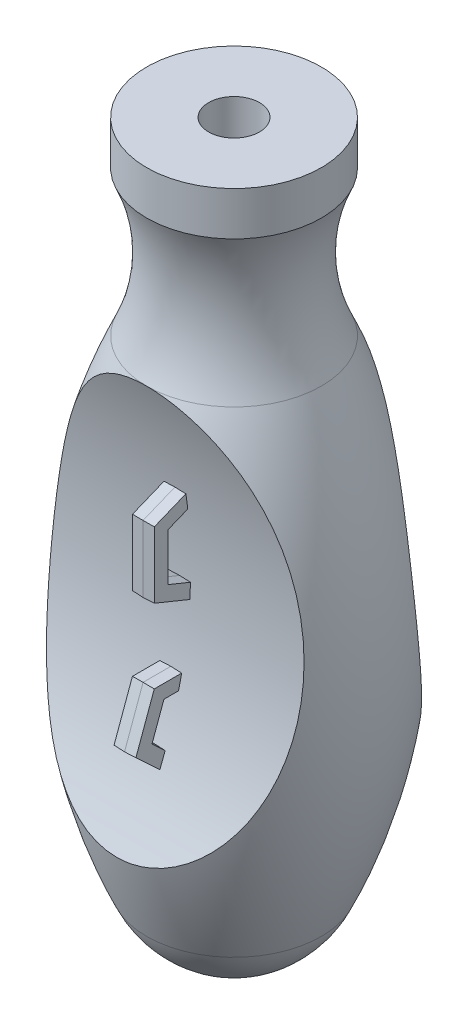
ISO-10303-21;
HEADER;
FILE_DESCRIPTION(('STEP AP214'),'2;1');
FILE_NAME('part.step','',(''),(''),'','','');
FILE_SCHEMA(('AUTOMOTIVE_DESIGN { 1 0 10303 214 1 1 1 1 }'));
ENDSEC;
DATA;
#1=APPLICATION_CONTEXT('core data for automotive mechanical design processes');
#2=APPLICATION_PROTOCOL_DEFINITION('international standard','automotive_design',2000,#1);
#3=PRODUCT_CONTEXT('',#1,'mechanical');
#4=PRODUCT('Part','Part','',(#3));
#5=PRODUCT_RELATED_PRODUCT_CATEGORY('part','',(#4));
#6=PRODUCT_DEFINITION_FORMATION('','',#4);
#7=PRODUCT_DEFINITION_CONTEXT('part definition',#1,'design');
#8=PRODUCT_DEFINITION('design','',#6,#7);
#9=PRODUCT_DEFINITION_SHAPE('','',#8);
#10=(LENGTH_UNIT() NAMED_UNIT(*) SI_UNIT(.MILLI.,.METRE.));
#11=(NAMED_UNIT(*) PLANE_ANGLE_UNIT() SI_UNIT($,.RADIAN.));
#12=(NAMED_UNIT(*) SI_UNIT($,.STERADIAN.) SOLID_ANGLE_UNIT());
#13=UNCERTAINTY_MEASURE_WITH_UNIT(LENGTH_MEASURE(1.E-05),#10,'distance_accuracy_value','');
#14=(GEOMETRIC_REPRESENTATION_CONTEXT(3) GLOBAL_UNCERTAINTY_ASSIGNED_CONTEXT((#13)) GLOBAL_UNIT_ASSIGNED_CONTEXT((#10,
#11,#12)) REPRESENTATION_CONTEXT('',''));
#15=CARTESIAN_POINT('',(0.,0.,0.));
#16=DIRECTION('',(0.,0.,1.));
#17=DIRECTION('',(1.,0.,0.));
#18=AXIS2_PLACEMENT_3D('',#15,#16,#17);
#19=CARTESIAN_POINT('',(-19.0366667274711,51.0993200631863,-67.4577213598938));
#20=DIRECTION('',(1.,0.,0.));
#21=DIRECTION('',(0.,0.,-1.));
#22=AXIS2_PLACEMENT_3D('',#19,#20,#21);
#23=CYLINDRICAL_SURFACE('',#22,60.);
#24=CARTESIAN_POINT('',(-1.5,51.0993200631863,-67.4577213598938));
#25=DIRECTION('',(1.,0.,0.));
#26=DIRECTION('',(0.,0.,-1.));
#27=AXIS2_PLACEMENT_3D('',#24,#25,#26);
#28=CIRCLE('',#27,60.);
#29=CARTESIAN_POINT('',(-1.5,58.0565062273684,-7.86243999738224));
#30=VERTEX_POINT('',#29);
#31=CARTESIAN_POINT('',(-1.5,59.9977901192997,-8.12124665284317));
#32=VERTEX_POINT('',#31);
#33=EDGE_CURVE('E43',#30,#32,#28,.F.);
#34=ORIENTED_EDGE('',*,*,#33,.F.);
#35=CARTESIAN_POINT('',(-461.616023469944,51.0993200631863,-67.4577213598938));
#36=DIRECTION('',(-0.034899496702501,-0.925361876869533,0.377475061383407));
#37=DIRECTION('',(0.999390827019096,-0.0323143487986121,0.0131817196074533));
#38=AXIS2_PLACEMENT_3D('',#35,#36,#37);
#39=ELLIPSE('',#38,1719.22250087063,60.);
#40=CARTESIAN_POINT('',(0.,58.0024964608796,-7.85615967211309));
#41=VERTEX_POINT('',#40);
#42=EDGE_CURVE('E896',#30,#41,#39,.F.);
#43=ORIENTED_EDGE('',*,*,#42,.T.);
#44=CARTESIAN_POINT('',(461.616023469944,51.0993200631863,-67.4577213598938));
#45=DIRECTION('',(0.034899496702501,-0.925361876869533,0.377475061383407));
#46=DIRECTION('',(0.999390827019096,0.0323143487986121,-0.0131817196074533));
#47=AXIS2_PLACEMENT_3D('',#44,#45,#46);
#48=ELLIPSE('',#47,1719.22250087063,60.);
#49=CARTESIAN_POINT('',(1.5,58.0565062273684,-7.86243999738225));
#50=VERTEX_POINT('',#49);
#51=EDGE_CURVE('E438',#50,#41,#48,.T.);
#52=ORIENTED_EDGE('',*,*,#51,.F.);
#53=CARTESIAN_POINT('',(1.5,51.0993200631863,-67.4577213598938));
#54=DIRECTION('',(1.,0.,0.));
#55=DIRECTION('',(0.,0.,-1.));
#56=AXIS2_PLACEMENT_3D('',#53,#54,#55);
#57=CIRCLE('',#56,60.);
#58=CARTESIAN_POINT('',(1.5,59.9977901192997,-8.12124665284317));
#59=VERTEX_POINT('',#58);
#60=EDGE_CURVE('E888',#50,#59,#57,.F.);
#61=ORIENTED_EDGE('',*,*,#60,.T.);
#62=CARTESIAN_POINT('',(-404.343516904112,51.0993200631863,-67.4577213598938));
#63=DIRECTION('',(0.034899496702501,0.925361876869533,-0.377475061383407));
#64=DIRECTION('',(0.999390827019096,-0.0323143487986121,0.0131817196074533));
#65=AXIS2_PLACEMENT_3D('',#62,#63,#64);
#66=ELLIPSE('',#65,1719.22250087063,60.);
#67=CARTESIAN_POINT('',(0.,60.0510911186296,-8.12926448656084));
#68=VERTEX_POINT('',#67);
#69=EDGE_CURVE('E893',#59,#68,#66,.F.);
#70=ORIENTED_EDGE('',*,*,#69,.T.);
#71=CARTESIAN_POINT('',(404.343516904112,51.0993200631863,-67.4577213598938));
#72=DIRECTION('',(-0.034899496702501,0.925361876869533,-0.377475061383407));
#73=DIRECTION('',(0.999390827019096,0.0323143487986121,-0.0131817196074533));
#74=AXIS2_PLACEMENT_3D('',#71,#72,#73);
#75=ELLIPSE('',#74,1719.22250087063,60.);
#76=EDGE_CURVE('E898',#32,#68,#75,.T.);
#77=ORIENTED_EDGE('',*,*,#76,.F.);
#78=EDGE_LOOP('',(#34,#43,#52,#61,#70,#77));
#79=FACE_BOUND('',#78,.T.);
#80=CARTESIAN_POINT('',(-1.5,51.0993200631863,-67.4577213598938));
#81=DIRECTION('',(1.,0.,0.));
#82=DIRECTION('',(0.,0.,-1.));
#83=AXIS2_PLACEMENT_3D('',#80,#81,#82);
#84=CIRCLE('',#83,60.);
#85=CARTESIAN_POINT('',(-1.5,37.0523811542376,-9.12519606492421));
#86=VERTEX_POINT('',#85);
#87=CARTESIAN_POINT('',(-1.5,38.9476188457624,-8.70113740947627));
#88=VERTEX_POINT('',#87);
#89=EDGE_CURVE('E874',#86,#88,#84,.F.);
#90=ORIENTED_EDGE('',*,*,#89,.F.);
#91=CARTESIAN_POINT('',(-403.751700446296,51.0993200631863,-67.4577213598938));
#92=DIRECTION('',(-0.034899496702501,-0.999390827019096,0.));
#93=DIRECTION('',(0.999390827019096,-0.034899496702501,0.));
#94=AXIS2_PLACEMENT_3D('',#91,#92,#93);
#95=ELLIPSE('',#94,1719.22250087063,60.);
#96=CARTESIAN_POINT('',(0.,37.,-9.13783475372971));
#97=VERTEX_POINT('',#96);
#98=EDGE_CURVE('E869',#86,#97,#95,.F.);
#99=ORIENTED_EDGE('',*,*,#98,.T.);
#100=CARTESIAN_POINT('',(403.751700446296,51.0993200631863,-67.4577213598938));
#101=DIRECTION('',(0.034899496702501,-0.999390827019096,0.));
#102=DIRECTION('',(0.999390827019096,0.034899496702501,0.));
#103=AXIS2_PLACEMENT_3D('',#100,#101,#102);
#104=ELLIPSE('',#103,1719.22250087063,60.);
#105=CARTESIAN_POINT('',(1.5,37.0523811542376,-9.1251960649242));
#106=VERTEX_POINT('',#105);
#107=EDGE_CURVE('E867',#106,#97,#104,.T.);
#108=ORIENTED_EDGE('',*,*,#107,.F.);
#109=CARTESIAN_POINT('',(1.5,51.0993200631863,-67.4577213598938));
#110=DIRECTION('',(1.,0.,0.));
#111=DIRECTION('',(0.,0.,-1.));
#112=AXIS2_PLACEMENT_3D('',#109,#110,#111);
#113=CIRCLE('',#112,60.);
#114=CARTESIAN_POINT('',(1.5,38.9476188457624,-8.70113740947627));
#115=VERTEX_POINT('',#114);
#116=EDGE_CURVE('E860',#106,#115,#113,.F.);
#117=ORIENTED_EDGE('',*,*,#116,.T.);
#118=CARTESIAN_POINT('',(-346.479193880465,51.0993200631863,-67.4577213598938));
#119=DIRECTION('',(0.034899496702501,0.999390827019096,0.));
#120=DIRECTION('',(0.999390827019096,-0.034899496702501,0.));
#121=AXIS2_PLACEMENT_3D('',#118,#119,#120);
#122=ELLIPSE('',#121,1719.22250087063,60.);
#123=CARTESIAN_POINT('',(0.,39.,-8.69032858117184));
#124=VERTEX_POINT('',#123);
#125=EDGE_CURVE('E863',#115,#124,#122,.F.);
#126=ORIENTED_EDGE('',*,*,#125,.T.);
#127=CARTESIAN_POINT('',(346.479193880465,51.0993200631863,-67.4577213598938));
#128=DIRECTION('',(-0.034899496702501,0.999390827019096,0.));
#129=DIRECTION('',(0.999390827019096,0.034899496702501,0.));
#130=AXIS2_PLACEMENT_3D('',#127,#128,#129);
#131=ELLIPSE('',#130,1719.22250087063,60.);
#132=EDGE_CURVE('E872',#88,#124,#131,.T.);
#133=ORIENTED_EDGE('',*,*,#132,.F.);
#134=EDGE_LOOP('',(#90,#99,#108,#117,#126,#133));
#135=FACE_BOUND('',#134,.T.);
#136=CARTESIAN_POINT('',(-11.6934335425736,25.8126324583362,-13.046477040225));
#137=CARTESIAN_POINT('',(-11.40823626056,25.4621805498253,-13.209343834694));
#138=CARTESIAN_POINT('',(-11.1099455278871,25.1220307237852,-13.3715493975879));
#139=CARTESIAN_POINT('',(-10.48652405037,24.4651300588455,-13.69199375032));
#140=CARTESIAN_POINT('',(-10.1613915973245,24.1483807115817,-13.8502322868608));
#141=CARTESIAN_POINT('',(-9.48428016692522,23.5416527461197,-14.159589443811));
#142=CARTESIAN_POINT('',(-9.13232069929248,23.2516550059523,-14.3107131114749));
#143=CARTESIAN_POINT('',(-8.4016611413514,22.7016438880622,-14.6025523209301));
#144=CARTESIAN_POINT('',(-8.0229674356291,22.4416233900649,-14.7432703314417));
#145=CARTESIAN_POINT('',(-7.31750731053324,22.0034181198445,-14.9841272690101));
#146=CARTESIAN_POINT('',(-6.99532243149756,21.8192273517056,-15.086781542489));
#147=CARTESIAN_POINT('',(-6.33542382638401,21.4744021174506,-15.2810657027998));
#148=CARTESIAN_POINT('',(-5.99771341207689,21.3137626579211,-15.3726979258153));
#149=CARTESIAN_POINT('',(-5.30826472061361,21.0179787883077,-15.5429638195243));
#150=CARTESIAN_POINT('',(-4.95653180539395,20.8828247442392,-15.6216024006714));
#151=CARTESIAN_POINT('',(-4.24082486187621,20.6397346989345,-15.7640705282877));
#152=CARTESIAN_POINT('',(-3.87685068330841,20.5317990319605,-15.8278998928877));
#153=CARTESIAN_POINT('',(-3.13673376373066,20.3441391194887,-15.9394637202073));
#154=CARTESIAN_POINT('',(-2.76052834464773,20.2645986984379,-15.9870932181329));
#155=CARTESIAN_POINT('',(-2.00109992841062,20.1359708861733,-16.0643690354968));
#156=CARTESIAN_POINT('',(-1.61787688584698,20.0868836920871,-16.0940152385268));
#157=CARTESIAN_POINT('',(-0.847827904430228,20.0200046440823,-16.1344547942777));
#158=CARTESIAN_POINT('',(-0.46100307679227,20.0022034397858,-16.1452537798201));
#159=CARTESIAN_POINT('',(0.312852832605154,19.9981817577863,-16.1476909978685));
#160=CARTESIAN_POINT('',(0.699883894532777,20.0119586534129,-16.139330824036));
#161=CARTESIAN_POINT('',(1.4310741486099,20.0678138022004,-16.105540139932));
#162=CARTESIAN_POINT('',(1.77555739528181,20.1068429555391,-16.081949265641));
#163=CARTESIAN_POINT('',(2.45945723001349,20.2095813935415,-16.0201121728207));
#164=CARTESIAN_POINT('',(2.79887423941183,20.2732886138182,-15.9818671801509));
#165=CARTESIAN_POINT('',(3.47045165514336,20.4245448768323,-15.8915900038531));
#166=CARTESIAN_POINT('',(3.80261224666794,20.5120933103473,-15.8395581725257));
#167=CARTESIAN_POINT('',(4.45779143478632,20.7099548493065,-15.7228234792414));
#168=CARTESIAN_POINT('',(4.78080956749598,20.820269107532,-15.658119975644));
#169=CARTESIAN_POINT('',(5.42525175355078,21.0658915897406,-15.5153117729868));
#170=CARTESIAN_POINT('',(5.74636213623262,21.2018279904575,-15.4368748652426));
#171=CARTESIAN_POINT('',(6.37584075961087,21.4949671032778,-15.2694970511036));
#172=CARTESIAN_POINT('',(6.68420915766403,21.6521695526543,-15.1805562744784));
#173=CARTESIAN_POINT('',(7.28730803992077,21.9863507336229,-14.9937180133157));
#174=CARTESIAN_POINT('',(7.58203449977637,22.1633352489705,-14.8958179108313));
#175=CARTESIAN_POINT('',(8.15712080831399,22.5355171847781,-14.692636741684));
#176=CARTESIAN_POINT('',(8.43747763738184,22.73071840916,-14.5873541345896));
#177=CARTESIAN_POINT('',(9.11420435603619,23.2353839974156,-14.3190617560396));
#178=CARTESIAN_POINT('',(9.50181756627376,23.5547924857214,-14.1525572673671));
#179=CARTESIAN_POINT('',(10.2443089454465,24.225629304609,-13.8112257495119));
#180=CARTESIAN_POINT('',(10.5991749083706,24.5770694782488,-13.6363956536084));
#181=CARTESIAN_POINT('',(11.2771108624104,25.3084384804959,-13.2821202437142));
#182=CARTESIAN_POINT('',(11.6001237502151,25.6884163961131,-13.1026673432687));
#183=CARTESIAN_POINT('',(12.2145446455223,26.4726063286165,-12.7429039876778));
#184=CARTESIAN_POINT('',(12.5059520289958,26.8768188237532,-12.5625935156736));
#185=CARTESIAN_POINT('',(13.1610613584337,27.8604122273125,-12.1374125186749));
#186=CARTESIAN_POINT('',(13.5114185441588,28.4490954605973,-11.8934354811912));
#187=CARTESIAN_POINT('',(14.1586310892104,29.6590231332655,-11.415439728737));
#188=CARTESIAN_POINT('',(14.4554677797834,30.2802788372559,-11.1814245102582));
#189=CARTESIAN_POINT('',(14.9994543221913,31.5499888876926,-10.7278479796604));
#190=CARTESIAN_POINT('',(15.2465532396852,32.1984703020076,-10.5083016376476));
#191=CARTESIAN_POINT('',(15.6940790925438,33.5169771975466,-10.0875161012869));
#192=CARTESIAN_POINT('',(15.8945057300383,34.1870028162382,-9.88627702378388));
#193=CARTESIAN_POINT('',(16.3060689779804,35.7505567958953,-9.44686541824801));
#194=CARTESIAN_POINT('',(16.5019821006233,36.6501804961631,-9.21602955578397));
#195=CARTESIAN_POINT('',(16.8256248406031,38.470858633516,-8.79430837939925));
#196=CARTESIAN_POINT('',(16.9533349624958,39.3919191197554,-8.60343449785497));
#197=CARTESIAN_POINT('',(17.1452067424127,41.2487126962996,-8.26433870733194));
#198=CARTESIAN_POINT('',(17.2093429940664,42.1844515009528,-8.116133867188));
#199=CARTESIAN_POINT('',(17.2774930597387,44.0639061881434,-7.86408072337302));
#200=CARTESIAN_POINT('',(17.281511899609,45.0076213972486,-7.76022871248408));
#201=CARTESIAN_POINT('',(17.2315524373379,46.9092385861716,-7.59650400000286));
#202=CARTESIAN_POINT('',(17.1768458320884,47.8671700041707,-7.53719944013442));
#203=CARTESIAN_POINT('',(17.0096685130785,49.7797734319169,-7.4645991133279));
#204=CARTESIAN_POINT('',(16.8971939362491,50.7344452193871,-7.45130642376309));
#205=CARTESIAN_POINT('',(16.6146541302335,52.6350855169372,-7.46984886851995));
#206=CARTESIAN_POINT('',(16.4445716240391,53.5810513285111,-7.50169755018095));
#207=CARTESIAN_POINT('',(16.0458264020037,55.4579544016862,-7.60886464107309));
#208=CARTESIAN_POINT('',(15.8171718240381,56.3888937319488,-7.68417701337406));
#209=CARTESIAN_POINT('',(15.3293880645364,58.1208741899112,-7.86440231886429));
#210=CARTESIAN_POINT('',(15.0770330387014,58.9242868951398,-7.9647768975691));
#211=CARTESIAN_POINT('',(14.6608346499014,60.1129977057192,-8.13728413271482));
#212=CARTESIAN_POINT('',(14.5157951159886,60.506568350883,-8.19845691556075));
#213=CARTESIAN_POINT('',(14.2126905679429,61.2874970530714,-8.32771556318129));
#214=CARTESIAN_POINT('',(14.0546266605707,61.6748556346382,-8.39580084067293));
#215=CARTESIAN_POINT('',(13.725206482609,62.4419457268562,-8.53831196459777));
#216=CARTESIAN_POINT('',(13.5538717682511,62.8216883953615,-8.61272754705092));
#217=CARTESIAN_POINT('',(13.1970817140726,63.5732535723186,-8.7674482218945));
#218=CARTESIAN_POINT('',(13.0116268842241,63.9450763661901,-8.84775310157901));
#219=CARTESIAN_POINT('',(12.6259986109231,64.6795538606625,-9.01356945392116));
#220=CARTESIAN_POINT('',(12.4258337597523,65.0422137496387,-9.0990778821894));
#221=CARTESIAN_POINT('',(12.0098670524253,65.757416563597,-9.27459824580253));
#222=CARTESIAN_POINT('',(11.7940630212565,66.1099580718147,-9.36461080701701));
#223=CARTESIAN_POINT('',(11.3115014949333,66.8567604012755,-9.56234813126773));
#224=CARTESIAN_POINT('',(11.0420101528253,67.2491068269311,-9.67066908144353));
#225=CARTESIAN_POINT('',(10.4796153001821,68.0156360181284,-9.89039421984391));
#226=CARTESIAN_POINT('',(10.1867182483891,68.3898237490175,-10.0017975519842));
#227=CARTESIAN_POINT('',(9.57602526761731,69.1166522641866,-10.2255606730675));
#228=CARTESIAN_POINT('',(9.25824564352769,69.4693068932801,-10.3379197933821));
#229=CARTESIAN_POINT('',(8.59604584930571,70.1492235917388,-10.561068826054));
#230=CARTESIAN_POINT('',(8.25163249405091,70.4764921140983,-10.6718591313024));
#231=CARTESIAN_POINT('',(7.62279169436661,71.0239744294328,-10.8620465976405));
#232=CARTESIAN_POINT('',(7.3443868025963,71.2507499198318,-10.9424752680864));
#233=CARTESIAN_POINT('',(6.77121792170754,71.6843734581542,-11.0989716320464));
#234=CARTESIAN_POINT('',(6.47645417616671,71.8912218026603,-11.1750393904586));
#235=CARTESIAN_POINT('',(5.8709310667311,72.2817272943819,-11.3208437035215));
#236=CARTESIAN_POINT('',(5.56019224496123,72.4654132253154,-11.3905880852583));
#237=CARTESIAN_POINT('',(4.92291806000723,72.8065158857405,-11.5217663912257));
#238=CARTESIAN_POINT('',(4.59638692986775,72.963939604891,-11.5832025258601));
#239=CARTESIAN_POINT('',(4.00127279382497,73.2180437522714,-11.6833861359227));
#240=CARTESIAN_POINT('',(3.73548947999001,73.3204926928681,-11.7241641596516));
#241=CARTESIAN_POINT('',(3.19607185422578,73.5054231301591,-11.7982524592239));
#242=CARTESIAN_POINT('',(2.92243941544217,73.5879093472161,-11.831564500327));
#243=CARTESIAN_POINT('',(2.36887100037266,73.7313322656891,-11.8897627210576));
#244=CARTESIAN_POINT('',(2.08893926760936,73.7922830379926,-11.9146544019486));
#245=CARTESIAN_POINT('',(1.52439186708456,73.8914321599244,-11.9552663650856));
#246=CARTESIAN_POINT('',(1.23977616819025,73.9296303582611,-11.9709865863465));
#247=CARTESIAN_POINT('',(0.666767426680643,73.9825177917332,-11.9927766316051));
#248=CARTESIAN_POINT('',(0.378363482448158,73.9971066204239,-11.9988052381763));
#249=CARTESIAN_POINT('',(-0.198691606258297,74.0021138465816,-12.000872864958));
#250=CARTESIAN_POINT('',(-0.487342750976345,73.9925322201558,-11.9969118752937));
#251=CARTESIAN_POINT('',(-1.06261191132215,73.9494228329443,-11.9791368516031));
#252=CARTESIAN_POINT('',(-1.34922935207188,73.9158885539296,-11.965320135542));
#253=CARTESIAN_POINT('',(-1.91815618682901,73.8256420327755,-11.9282998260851));
#254=CARTESIAN_POINT('',(-2.20046558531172,73.7689298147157,-11.9050962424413));
#255=CARTESIAN_POINT('',(-2.74333110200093,73.6373244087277,-11.8515787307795));
#256=CARTESIAN_POINT('',(-3.00422364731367,73.563618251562,-11.8217322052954));
#257=CARTESIAN_POINT('',(-3.51918423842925,73.3979225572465,-11.7551155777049));
#258=CARTESIAN_POINT('',(-3.77325273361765,73.3059342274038,-11.7183459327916));
#259=CARTESIAN_POINT('',(-4.27366035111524,73.1050754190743,-11.6387426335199));
#260=CARTESIAN_POINT('',(-4.5199984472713,72.9962027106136,-11.5959081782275));
#261=CARTESIAN_POINT('',(-5.00430119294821,72.7630300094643,-11.5050686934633));
#262=CARTESIAN_POINT('',(-5.24226377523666,72.6387262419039,-11.4570623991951));
#263=CARTESIAN_POINT('',(-5.84605095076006,72.2992955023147,-11.3274214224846));
#264=CARTESIAN_POINT('',(-6.20525718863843,72.0735698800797,-11.2425402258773));
#265=CARTESIAN_POINT('',(-6.90108127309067,71.5922044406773,-11.0652793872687));
#266=CARTESIAN_POINT('',(-7.23768780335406,71.3365498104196,-10.972896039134));
#267=CARTESIAN_POINT('',(-7.88935177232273,70.7993052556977,-10.7832834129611));
#268=CARTESIAN_POINT('',(-8.20435643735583,70.5176555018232,-10.6860432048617));
#269=CARTESIAN_POINT('',(-8.81279025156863,69.9327825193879,-10.489345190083));
#270=CARTESIAN_POINT('',(-9.10621995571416,69.6295598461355,-10.3898874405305));
#271=CARTESIAN_POINT('',(-9.61334532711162,69.0700706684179,-10.2115912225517));
#272=CARTESIAN_POINT('',(-9.83088119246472,68.817248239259,-10.1327911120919));
#273=CARTESIAN_POINT('',(-10.2537342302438,68.3013592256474,-9.97587532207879));
#274=CARTESIAN_POINT('',(-10.4590499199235,68.0382914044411,-9.89775972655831));
#275=CARTESIAN_POINT('',(-11.0576506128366,67.2352485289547,-9.6654915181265));
#276=CARTESIAN_POINT('',(-11.433482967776,66.6815530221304,-9.51345575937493));
#277=CARTESIAN_POINT('',(-12.1430377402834,65.5443859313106,-9.21953851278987));
#278=CARTESIAN_POINT('',(-12.4766980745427,64.9608721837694,-9.0776721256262));
#279=CARTESIAN_POINT('',(-13.1049133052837,63.770183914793,-8.80772785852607));
#280=CARTESIAN_POINT('',(-13.3994709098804,63.1630110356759,-8.67964902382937));
#281=CARTESIAN_POINT('',(-13.8748599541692,62.1022742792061,-8.47348786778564));
#282=CARTESIAN_POINT('',(-14.0644291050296,61.6533469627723,-8.39145312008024));
#283=CARTESIAN_POINT('',(-14.4257092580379,60.746746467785,-8.23662220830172));
#284=CARTESIAN_POINT('',(-14.5974188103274,60.2890725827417,-8.16382679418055));
#285=CARTESIAN_POINT('',(-14.9237349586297,59.3660929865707,-8.02811479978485));
#286=CARTESIAN_POINT('',(-15.0783367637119,58.9007851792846,-7.96520098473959));
#287=CARTESIAN_POINT('',(-15.3709963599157,57.9636727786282,-7.84980602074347));
#288=CARTESIAN_POINT('',(-15.509052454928,57.491867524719,-7.79732594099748));
#289=CARTESIAN_POINT('',(-15.7691148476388,56.5426356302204,-7.70324188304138));
#290=CARTESIAN_POINT('',(-15.891116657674,56.0652074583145,-7.66164094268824));
#291=CARTESIAN_POINT('',(-16.1193852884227,55.1057499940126,-7.58969888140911));
#292=CARTESIAN_POINT('',(-16.2256506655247,54.6237202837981,-7.55935879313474));
#293=CARTESIAN_POINT('',(-16.5211980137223,53.1722353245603,-7.48572200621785));
#294=CARTESIAN_POINT('',(-16.6873294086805,52.1970228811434,-7.45977259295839));
#295=CARTESIAN_POINT('',(-16.9607592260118,50.2231257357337,-7.4558735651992));
#296=CARTESIAN_POINT('',(-17.0671142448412,49.224310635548,-7.47866775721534));
#297=CARTESIAN_POINT('',(-17.216544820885,47.2242098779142,-7.57462028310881));
#298=CARTESIAN_POINT('',(-17.2596142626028,46.2229239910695,-7.64778348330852));
#299=CARTESIAN_POINT('',(-17.2805681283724,44.2247530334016,-7.84439991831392));
#300=CARTESIAN_POINT('',(-17.2584633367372,43.227867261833,-7.96784483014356));
#301=CARTESIAN_POINT('',(-17.145861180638,41.2454024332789,-8.26393750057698));
#302=CARTESIAN_POINT('',(-17.055379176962,40.2598208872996,-8.43657420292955));
#303=CARTESIAN_POINT('',(-16.8246174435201,38.4859072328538,-8.79287212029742));
#304=CARTESIAN_POINT('',(-16.6964488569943,37.6944216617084,-8.96876303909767));
#305=CARTESIAN_POINT('',(-16.3880590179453,36.1286570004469,-9.34982075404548));
#306=CARTESIAN_POINT('',(-16.2078353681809,35.3543787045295,-9.55498889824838));
#307=CARTESIAN_POINT('',(-15.7919398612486,33.8302947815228,-9.99114243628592));
#308=CARTESIAN_POINT('',(-15.5563961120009,33.080437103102,-10.2220675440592));
#309=CARTESIAN_POINT('',(-15.0251964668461,31.6098136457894,-10.7060042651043));
#310=CARTESIAN_POINT('',(-14.7295695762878,30.8890340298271,-10.959005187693));
#311=CARTESIAN_POINT('',(-14.2186135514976,29.795159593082,-11.3657634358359));
#312=CARTESIAN_POINT('',(-14.0256655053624,29.4093910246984,-11.5138781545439));
#313=CARTESIAN_POINT('',(-13.6186730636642,28.6507306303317,-11.8139703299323));
#314=CARTESIAN_POINT('',(-13.4046324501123,28.2778365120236,-11.9659470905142));
#315=CARTESIAN_POINT('',(-12.9544763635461,27.5464590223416,-12.2723969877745));
#316=CARTESIAN_POINT('',(-12.7183534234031,27.1879805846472,-12.4268709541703));
#317=CARTESIAN_POINT('',(-12.2232341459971,26.4874487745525,-12.7365876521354));
#318=CARTESIAN_POINT('',(-11.9642363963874,26.1453964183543,-12.8918304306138));
#319=CARTESIAN_POINT('',(-11.6934335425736,25.8126324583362,-13.046477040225));
#320=B_SPLINE_CURVE_WITH_KNOTS('',3,(#136,#137,#138,#139,#140,#141,#142,#143,#144,#145,#146,
#147,#148,#149,#150,#151,#152,#153,#154,#155,#156,#157,#158,#159,#160,#161,#162,#163,#164,#165,
#166,#167,#168,#169,#170,#171,#172,#173,#174,#175,#176,#177,#178,#179,#180,#181,#182,#183,#184,
#185,#186,#187,#188,#189,#190,#191,#192,#193,#194,#195,#196,#197,#198,#199,#200,#201,#202,#203,
#204,#205,#206,#207,#208,#209,#210,#211,#212,#213,#214,#215,#216,#217,#218,#219,#220,#221,#222,
#223,#224,#225,#226,#227,#228,#229,#230,#231,#232,#233,#234,#235,#236,#237,#238,#239,#240,#241,
#242,#243,#244,#245,#246,#247,#248,#249,#250,#251,#252,#253,#254,#255,#256,#257,#258,#259,#260,
#261,#262,#263,#264,#265,#266,#267,#268,#269,#270,#271,#272,#273,#274,#275,#276,#277,#278,#279,
#280,#281,#282,#283,#284,#285,#286,#287,#288,#289,#290,#291,#292,#293,#294,#295,#296,#297,#298,
#299,#300,#301,#302,#303,#304,#305,#306,#307,#308,#309,#310,#311,#312,#313,#314,#315,#316,#317,
#318,#319),.UNSPECIFIED.,.T.,.F.,(4,2,2,2,2,2,2,2,2,2,2,2,2,2,2,2,2,2,2,2,2,2,2,2,2,2,2,2,2,2,2,
2,2,2,2,2,2,2,2,2,2,2,2,2,2,2,2,2,2,2,2,2,2,2,2,2,2,2,2,2,2,2,2,2,2,2,2,2,2,2,2,2,2,2,2,2,2,2,2,
2,2,2,2,2,2,2,2,2,2,2,2,4),(0.,1.44059524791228,2.88128224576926,4.32093133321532,
5.76023776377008,6.91431452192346,8.06814623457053,9.22154089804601,10.374949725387,
11.5356955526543,12.6964488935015,13.8568552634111,15.0171651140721,16.05841396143,
17.0995757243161,18.1407108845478,19.181898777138,20.2530644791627,21.3242169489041,
22.3956834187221,23.4673741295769,25.0524158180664,26.638045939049,28.2264688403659,
29.8149230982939,31.9933162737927,34.172467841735,36.3538397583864,38.5352255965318,
41.3789021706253,44.2233911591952,47.0690164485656,49.9144038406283,52.7954913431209,
55.6767715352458,58.5589166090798,61.4406614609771,63.9825527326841,65.2539498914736,
66.5252391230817,67.7945049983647,69.0637250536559,70.3322095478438,71.6008707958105,
73.0644933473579,74.5277134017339,75.9899825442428,77.4518787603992,78.5549971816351,
79.6580991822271,80.7598165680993,81.8612402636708,82.7236759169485,83.5859074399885,
84.4475745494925,85.3092473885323,86.1745752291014,87.0399039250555,87.9054681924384,
88.7710315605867,89.5884395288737,90.4057935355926,91.223255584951,92.0409180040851,
93.3368091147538,94.6333443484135,95.9329418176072,97.2325058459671,98.260251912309,
99.2881224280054,101.344353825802,103.403577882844,105.462659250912,106.944704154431,
108.42686927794,109.909448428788,111.392179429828,112.87532402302,114.358604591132,
117.324040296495,120.335049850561,123.346350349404,126.357152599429,129.367278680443,
131.827713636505,134.288261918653,136.743167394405,139.196890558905,140.564472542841,
141.931809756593,143.299611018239,144.667496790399),.UNSPECIFIED.);
#321=CARTESIAN_POINT('',(0.,74.,-12.));
#322=VERTEX_POINT('',#321);
#323=EDGE_CURVE('E689',#322,#322,#320,.T.);
#324=ORIENTED_EDGE('',*,*,#323,.F.);
#325=EDGE_LOOP('',(#324));
#326=FACE_BOUND('',#325,.T.);
#327=CARTESIAN_POINT('',(-1.5,28.9520626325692,-11.6948395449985));
#328=VERTEX_POINT('',#327);
#329=CARTESIAN_POINT('',(-1.5,30.8677932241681,-10.9715697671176));
#330=VERTEX_POINT('',#329);
#331=EDGE_CURVE('E876',#328,#330,#84,.F.);
#332=ORIENTED_EDGE('',*,*,#331,.F.);
#333=CARTESIAN_POINT('',(621.867771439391,51.0993200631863,-67.4577213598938));
#334=DIRECTION('',(-0.034899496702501,-0.731690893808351,-0.680742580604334));
#335=DIRECTION('',(0.999390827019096,-0.0255512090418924,-0.0237720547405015));
#336=AXIS2_PLACEMENT_3D('',#333,#334,#335);
#337=ELLIPSE('',#336,1719.22250087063,60.);
#338=CARTESIAN_POINT('',(0.,28.8998402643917,-11.7156089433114));
#339=VERTEX_POINT('',#338);
#340=EDGE_CURVE('E886',#339,#328,#337,.T.);
#341=ORIENTED_EDGE('',*,*,#340,.F.);
#342=CARTESIAN_POINT('',(-621.867771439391,51.0993200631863,-67.4577213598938));
#343=DIRECTION('',(0.034899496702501,-0.731690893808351,-0.680742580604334));
#344=DIRECTION('',(0.999390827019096,0.0255512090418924,0.0237720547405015));
#345=AXIS2_PLACEMENT_3D('',#342,#343,#344);
#346=ELLIPSE('',#345,1719.22250087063,60.);
#347=CARTESIAN_POINT('',(1.5,28.9520626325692,-11.6948395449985));
#348=VERTEX_POINT('',#347);
#349=EDGE_CURVE('E877',#339,#348,#346,.F.);
#350=ORIENTED_EDGE('',*,*,#349,.T.);
#351=CARTESIAN_POINT('',(1.5,30.8677932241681,-10.9715697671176));
#352=VERTEX_POINT('',#351);
#353=EDGE_CURVE('E864',#348,#352,#113,.F.);
#354=ORIENTED_EDGE('',*,*,#353,.T.);
#355=CARTESIAN_POINT('',(679.140278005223,51.0993200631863,-67.4577213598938));
#356=DIRECTION('',(0.034899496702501,0.731690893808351,0.680742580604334));
#357=DIRECTION('',(0.999390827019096,-0.0255512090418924,-0.0237720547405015));
#358=AXIS2_PLACEMENT_3D('',#355,#356,#357);
#359=ELLIPSE('',#358,1719.22250087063,60.);
#360=CARTESIAN_POINT('',(0.,30.9214767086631,-10.9523708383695));
#361=VERTEX_POINT('',#360);
#362=EDGE_CURVE('E880',#361,#352,#359,.T.);
#363=ORIENTED_EDGE('',*,*,#362,.F.);
#364=CARTESIAN_POINT('',(-679.140278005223,51.0993200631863,-67.4577213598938));
#365=DIRECTION('',(-0.034899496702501,0.731690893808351,0.680742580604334));
#366=DIRECTION('',(0.999390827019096,0.0255512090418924,0.0237720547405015));
#367=AXIS2_PLACEMENT_3D('',#364,#365,#366);
#368=ELLIPSE('',#367,1719.22250087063,60.);
#369=EDGE_CURVE('E883',#361,#330,#368,.F.);
#370=ORIENTED_EDGE('',*,*,#369,.T.);
#371=EDGE_LOOP('',(#332,#341,#350,#354,#363,#370));
#372=FACE_BOUND('',#371,.T.);
#373=CARTESIAN_POINT('',(-1.5,47.1517670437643,-7.58772198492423));
#374=VERTEX_POINT('',#373);
#375=CARTESIAN_POINT('',(-1.5,49.1584029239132,-7.48912257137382));
#376=VERTEX_POINT('',#375);
#377=EDGE_CURVE('E11',#374,#376,#28,.F.);
#378=ORIENTED_EDGE('',*,*,#377,.F.);
#379=CARTESIAN_POINT('',(541.387961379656,51.0993200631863,-67.4577213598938));
#380=DIRECTION('',(-0.034899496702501,-0.925361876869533,-0.377475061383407));
#381=DIRECTION('',(0.999390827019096,-0.0323143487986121,-0.0131817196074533));
#382=AXIS2_PLACEMENT_3D('',#379,#380,#381);
#383=ELLIPSE('',#382,1719.22250087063,60.);
#384=CARTESIAN_POINT('',(0.,47.0966872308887,-7.5913791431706));
#385=VERTEX_POINT('',#384);
#386=EDGE_CURVE('E37',#385,#374,#383,.T.);
#387=ORIENTED_EDGE('',*,*,#386,.F.);
#388=CARTESIAN_POINT('',(-541.387961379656,51.0993200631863,-67.4577213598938));
#389=DIRECTION('',(0.034899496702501,-0.925361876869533,-0.377475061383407));
#390=DIRECTION('',(0.999390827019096,0.0323143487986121,0.0131817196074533));
#391=AXIS2_PLACEMENT_3D('',#388,#389,#390);
#392=ELLIPSE('',#391,1719.22250087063,60.);
#393=CARTESIAN_POINT('',(1.5,47.1517670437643,-7.58772198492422));
#394=VERTEX_POINT('',#393);
#395=EDGE_CURVE('E900',#385,#394,#392,.F.);
#396=ORIENTED_EDGE('',*,*,#395,.T.);
#397=CARTESIAN_POINT('',(1.5,49.1584029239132,-7.48912257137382));
#398=VERTEX_POINT('',#397);
#399=EDGE_CURVE('E891',#394,#398,#57,.F.);
#400=ORIENTED_EDGE('',*,*,#399,.T.);
#401=CARTESIAN_POINT('',(598.660467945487,51.0993200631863,-67.4577213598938));
#402=DIRECTION('',(0.034899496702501,0.925361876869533,0.377475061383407));
#403=DIRECTION('',(0.999390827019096,-0.0323143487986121,-0.0131817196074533));
#404=AXIS2_PLACEMENT_3D('',#401,#402,#403);
#405=ELLIPSE('',#404,1719.22250087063,60.);
#406=CARTESIAN_POINT('',(0.,49.2142478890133,-7.4873411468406));
#407=VERTEX_POINT('',#406);
#408=EDGE_CURVE('E903',#407,#398,#405,.T.);
#409=ORIENTED_EDGE('',*,*,#408,.F.);
#410=CARTESIAN_POINT('',(-598.660467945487,51.0993200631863,-67.4577213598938));
#411=DIRECTION('',(-0.034899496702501,0.925361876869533,0.377475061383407));
#412=DIRECTION('',(0.999390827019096,0.0323143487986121,0.0131817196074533));
#413=AXIS2_PLACEMENT_3D('',#410,#411,#412);
#414=ELLIPSE('',#413,1719.22250087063,60.);
#415=EDGE_CURVE('E904',#407,#376,#414,.F.);
#416=ORIENTED_EDGE('',*,*,#415,.T.);
#417=EDGE_LOOP('',(#378,#387,#396,#400,#409,#416));
#418=FACE_BOUND('',#417,.T.);
#419=ADVANCED_FACE('F32',(#79,#135,#326,#372,#418),#23,.F.);
#420=CARTESIAN_POINT('',(-19.0366667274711,51.0993200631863,67.4577213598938));
#421=DIRECTION('',(1.,0.,0.));
#422=DIRECTION('',(0.,0.,-1.));
#423=AXIS2_PLACEMENT_3D('',#420,#421,#422);
#424=CYLINDRICAL_SURFACE('',#423,60.);
#425=CARTESIAN_POINT('',(-1.5,51.0993200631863,67.4577213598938));
#426=DIRECTION('',(1.,0.,0.));
#427=DIRECTION('',(0.,0.,-1.));
#428=AXIS2_PLACEMENT_3D('',#425,#426,#427);
#429=CIRCLE('',#428,60.);
#430=CARTESIAN_POINT('',(-1.5,30.8677932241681,10.9715697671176));
#431=VERTEX_POINT('',#430);
#432=CARTESIAN_POINT('',(-1.5,28.9520626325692,11.6948395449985));
#433=VERTEX_POINT('',#432);
#434=EDGE_CURVE('E846',#431,#433,#429,.F.);
#435=ORIENTED_EDGE('',*,*,#434,.F.);
#436=CARTESIAN_POINT('',(-679.140278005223,51.0993200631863,67.4577213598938));
#437=DIRECTION('',(-0.034899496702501,0.731690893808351,-0.680742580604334));
#438=DIRECTION('',(0.999390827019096,0.0255512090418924,-0.0237720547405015));
#439=AXIS2_PLACEMENT_3D('',#436,#437,#438);
#440=ELLIPSE('',#439,1719.22250087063,60.);
#441=CARTESIAN_POINT('',(0.,30.9214767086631,10.9523708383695));
#442=VERTEX_POINT('',#441);
#443=EDGE_CURVE('E844',#442,#431,#440,.T.);
#444=ORIENTED_EDGE('',*,*,#443,.F.);
#445=CARTESIAN_POINT('',(679.140278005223,51.0993200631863,67.4577213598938));
#446=DIRECTION('',(0.034899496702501,0.731690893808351,-0.680742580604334));
#447=DIRECTION('',(0.999390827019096,-0.0255512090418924,0.0237720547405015));
#448=AXIS2_PLACEMENT_3D('',#445,#446,#447);
#449=ELLIPSE('',#448,1719.22250087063,60.);
#450=CARTESIAN_POINT('',(1.5,30.8677932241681,10.9715697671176));
#451=VERTEX_POINT('',#450);
#452=EDGE_CURVE('E834',#442,#451,#449,.F.);
#453=ORIENTED_EDGE('',*,*,#452,.T.);
#454=CARTESIAN_POINT('',(1.5,51.0993200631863,67.4577213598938));
#455=DIRECTION('',(1.,0.,0.));
#456=DIRECTION('',(0.,0.,-1.));
#457=AXIS2_PLACEMENT_3D('',#454,#455,#456);
#458=CIRCLE('',#457,60.);
#459=CARTESIAN_POINT('',(1.5,28.9520626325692,11.6948395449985));
#460=VERTEX_POINT('',#459);
#461=EDGE_CURVE('E831',#451,#460,#458,.F.);
#462=ORIENTED_EDGE('',*,*,#461,.T.);
#463=CARTESIAN_POINT('',(-621.86777143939,51.0993200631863,67.4577213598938));
#464=DIRECTION('',(0.034899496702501,-0.731690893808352,0.680742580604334));
#465=DIRECTION('',(0.999390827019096,0.0255512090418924,-0.0237720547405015));
#466=AXIS2_PLACEMENT_3D('',#463,#464,#465);
#467=ELLIPSE('',#466,1719.22250087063,60.);
#468=CARTESIAN_POINT('',(0.,28.8998402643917,11.7156089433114));
#469=VERTEX_POINT('',#468);
#470=EDGE_CURVE('E838',#469,#460,#467,.T.);
#471=ORIENTED_EDGE('',*,*,#470,.F.);
#472=CARTESIAN_POINT('',(621.86777143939,51.0993200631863,67.4577213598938));
#473=DIRECTION('',(-0.034899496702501,-0.731690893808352,0.680742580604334));
#474=DIRECTION('',(0.999390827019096,-0.0255512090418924,0.0237720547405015));
#475=AXIS2_PLACEMENT_3D('',#472,#473,#474);
#476=ELLIPSE('',#475,1719.22250087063,60.);
#477=EDGE_CURVE('E841',#469,#433,#476,.F.);
#478=ORIENTED_EDGE('',*,*,#477,.T.);
#479=EDGE_LOOP('',(#435,#444,#453,#462,#471,#478));
#480=FACE_BOUND('',#479,.T.);
#481=CARTESIAN_POINT('',(-1.5,51.0993200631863,67.4577213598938));
#482=DIRECTION('',(1.,0.,0.));
#483=DIRECTION('',(0.,0.,-1.));
#484=AXIS2_PLACEMENT_3D('',#481,#482,#483);
#485=CIRCLE('',#484,60.);
#486=CARTESIAN_POINT('',(-1.5,59.9977901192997,8.12124665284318));
#487=VERTEX_POINT('',#486);
#488=CARTESIAN_POINT('',(-1.5,58.0565062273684,7.86243999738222));
#489=VERTEX_POINT('',#488);
#490=EDGE_CURVE('E817',#487,#489,#485,.F.);
#491=ORIENTED_EDGE('',*,*,#490,.F.);
#492=CARTESIAN_POINT('',(404.343516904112,51.0993200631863,67.4577213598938));
#493=DIRECTION('',(-0.034899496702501,0.925361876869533,0.377475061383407));
#494=DIRECTION('',(0.999390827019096,0.0323143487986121,0.0131817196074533));
#495=AXIS2_PLACEMENT_3D('',#492,#493,#494);
#496=ELLIPSE('',#495,1719.22250087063,60.);
#497=CARTESIAN_POINT('',(0.,60.0510911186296,8.12926448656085));
#498=VERTEX_POINT('',#497);
#499=EDGE_CURVE('E812',#487,#498,#496,.F.);
#500=ORIENTED_EDGE('',*,*,#499,.T.);
#501=CARTESIAN_POINT('',(-404.343516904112,51.0993200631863,67.4577213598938));
#502=DIRECTION('',(0.034899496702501,0.925361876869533,0.377475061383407));
#503=DIRECTION('',(0.999390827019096,-0.0323143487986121,-0.0131817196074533));
#504=AXIS2_PLACEMENT_3D('',#501,#502,#503);
#505=ELLIPSE('',#504,1719.22250087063,60.);
#506=CARTESIAN_POINT('',(1.5,59.9977901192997,8.12124665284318));
#507=VERTEX_POINT('',#506);
#508=EDGE_CURVE('E810',#507,#498,#505,.T.);
#509=ORIENTED_EDGE('',*,*,#508,.F.);
#510=CARTESIAN_POINT('',(1.5,51.0993200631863,67.4577213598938));
#511=DIRECTION('',(1.,0.,0.));
#512=DIRECTION('',(0.,0.,-1.));
#513=AXIS2_PLACEMENT_3D('',#510,#511,#512);
#514=CIRCLE('',#513,60.);
#515=CARTESIAN_POINT('',(1.5,58.0565062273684,7.86243999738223));
#516=VERTEX_POINT('',#515);
#517=EDGE_CURVE('E802',#507,#516,#514,.F.);
#518=ORIENTED_EDGE('',*,*,#517,.T.);
#519=CARTESIAN_POINT('',(461.616023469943,51.0993200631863,67.4577213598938));
#520=DIRECTION('',(0.034899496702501,-0.925361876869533,-0.377475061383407));
#521=DIRECTION('',(0.999390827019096,0.0323143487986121,0.0131817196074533));
#522=AXIS2_PLACEMENT_3D('',#519,#520,#521);
#523=ELLIPSE('',#522,1719.22250087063,60.);
#524=CARTESIAN_POINT('',(0.,58.0024964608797,7.85615967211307));
#525=VERTEX_POINT('',#524);
#526=EDGE_CURVE('E805',#516,#525,#523,.F.);
#527=ORIENTED_EDGE('',*,*,#526,.T.);
#528=CARTESIAN_POINT('',(-461.616023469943,51.0993200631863,67.4577213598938));
#529=DIRECTION('',(-0.034899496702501,-0.925361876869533,-0.377475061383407));
#530=DIRECTION('',(0.999390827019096,-0.0323143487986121,-0.0131817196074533));
#531=AXIS2_PLACEMENT_3D('',#528,#529,#530);
#532=ELLIPSE('',#531,1719.22250087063,60.);
#533=EDGE_CURVE('E815',#489,#525,#532,.T.);
#534=ORIENTED_EDGE('',*,*,#533,.F.);
#535=EDGE_LOOP('',(#491,#500,#509,#518,#527,#534));
#536=FACE_BOUND('',#535,.T.);
#537=CARTESIAN_POINT('',(-11.6934335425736,25.8126324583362,13.046477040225));
#538=CARTESIAN_POINT('',(-12.062273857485,26.2658681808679,12.8358440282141));
#539=CARTESIAN_POINT('',(-12.409221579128,26.7363365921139,12.6241140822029));
#540=CARTESIAN_POINT('',(-13.0613865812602,27.7066454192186,12.2031952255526));
#541=CARTESIAN_POINT('',(-13.3665832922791,28.2065001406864,11.9940076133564));
#542=CARTESIAN_POINT('',(-13.9380299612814,29.2322015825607,11.5816492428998));
#543=CARTESIAN_POINT('',(-14.2041761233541,29.7581127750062,11.3784956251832));
#544=CARTESIAN_POINT('',(-14.6988394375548,30.8307604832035,10.9819503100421));
#545=CARTESIAN_POINT('',(-14.9273571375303,31.3774966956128,10.7885584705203));
#546=CARTESIAN_POINT('',(-15.4362778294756,32.71841938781,10.3365475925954));
#547=CARTESIAN_POINT('',(-15.6990379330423,33.5214070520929,10.0840409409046));
#548=CARTESIAN_POINT('',(-16.1595922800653,35.1544812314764,9.60889916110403));
#549=CARTESIAN_POINT('',(-16.3573617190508,35.9845779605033,9.38627545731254));
#550=CARTESIAN_POINT('',(-16.6927608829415,37.6650736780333,8.97465102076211));
#551=CARTESIAN_POINT('',(-16.8303808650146,38.5154759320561,8.78565573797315));
#552=CARTESIAN_POINT('',(-17.049436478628,40.230494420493,8.44388179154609));
#553=CARTESIAN_POINT('',(-17.1308776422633,41.0951092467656,8.29109956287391));
#554=CARTESIAN_POINT('',(-17.2417676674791,42.8493253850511,8.02086833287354));
#555=CARTESIAN_POINT('',(-17.270240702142,43.7390947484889,7.90411493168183));
#556=CARTESIAN_POINT('',(-17.2746929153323,45.5230927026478,7.71066478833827));
#557=CARTESIAN_POINT('',(-17.2506707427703,46.4173214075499,7.6339690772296));
#558=CARTESIAN_POINT('',(-17.1516729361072,48.2062708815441,7.52080125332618));
#559=CARTESIAN_POINT('',(-17.0766515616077,49.1009913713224,7.48436532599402));
#560=CARTESIAN_POINT('',(-16.8763097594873,50.8856237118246,7.45146685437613));
#561=CARTESIAN_POINT('',(-16.7509876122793,51.7755353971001,7.45500567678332));
#562=CARTESIAN_POINT('',(-16.5132291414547,53.1731610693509,7.49137668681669));
#563=CARTESIAN_POINT('',(-16.4175536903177,53.6841561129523,7.5112583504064));
#564=CARTESIAN_POINT('',(-16.2090623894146,54.7019637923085,7.56381098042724));
#565=CARTESIAN_POINT('',(-16.0962478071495,55.208776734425,7.59648100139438));
#566=CARTESIAN_POINT('',(-15.8531271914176,56.2174354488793,7.67427143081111));
#567=CARTESIAN_POINT('',(-15.7228142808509,56.7192791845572,7.71939674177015));
#568=CARTESIAN_POINT('',(-15.4442963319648,57.7167393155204,7.82164934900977));
#569=CARTESIAN_POINT('',(-15.2960916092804,58.2123558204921,7.87877643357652));
#570=CARTESIAN_POINT('',(-14.981455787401,59.1954625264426,8.00439797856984));
#571=CARTESIAN_POINT('',(-14.815053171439,59.6829640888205,8.07287475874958));
#572=CARTESIAN_POINT('',(-14.4630988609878,60.6493850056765,8.22061131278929));
#573=CARTESIAN_POINT('',(-14.2775462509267,61.1283039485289,8.29987160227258));
#574=CARTESIAN_POINT('',(-13.8865268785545,62.075802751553,8.46833088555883));
#575=CARTESIAN_POINT('',(-13.6810732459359,62.5443891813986,8.55752333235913));
#576=CARTESIAN_POINT('',(-13.2491000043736,63.4698316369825,8.74491791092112));
#577=CARTESIAN_POINT('',(-13.0225838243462,63.9266895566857,8.8431185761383));
#578=CARTESIAN_POINT('',(-12.5327474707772,64.8541362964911,9.05357275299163));
#579=CARTESIAN_POINT('',(-12.2680285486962,65.323878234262,9.16631730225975));
#580=CARTESIAN_POINT('',(-11.7116185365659,66.2453022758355,9.39891545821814));
#581=CARTESIAN_POINT('',(-11.4199293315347,66.6969856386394,9.5187685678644));
#582=CARTESIAN_POINT('',(-10.8077719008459,67.5784858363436,9.76330141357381));
#583=CARTESIAN_POINT('',(-10.4873301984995,68.0083222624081,9.88797664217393));
#584=CARTESIAN_POINT('',(-9.81519566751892,68.8421906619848,10.1394871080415));
#585=CARTESIAN_POINT('',(-9.46351057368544,69.2462289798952,10.2663218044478));
#586=CARTESIAN_POINT('',(-8.82014257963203,69.9243409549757,10.4865743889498));
#587=CARTESIAN_POINT('',(-8.53589213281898,70.2053690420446,10.580301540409));
#588=CARTESIAN_POINT('',(-7.94777434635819,70.7471510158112,10.7651768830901));
#589=CARTESIAN_POINT('',(-7.64390673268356,71.007904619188,10.8563250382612));
#590=CARTESIAN_POINT('',(-7.01633685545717,71.5053692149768,11.033765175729));
#591=CARTESIAN_POINT('',(-6.69266063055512,71.7421107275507,11.1200632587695));
#592=CARTESIAN_POINT('',(-6.02497395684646,72.1878621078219,11.2853982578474));
#593=CARTESIAN_POINT('',(-5.68097043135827,72.3968813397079,11.3644376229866));
#594=CARTESIAN_POINT('',(-5.06618502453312,72.7319684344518,11.492984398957));
#595=CARTESIAN_POINT('',(-4.79989281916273,72.8654067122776,11.5447969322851));
#596=CARTESIAN_POINT('',(-4.25723260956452,73.1127474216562,11.6417142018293));
#597=CARTESIAN_POINT('',(-3.98086737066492,73.2266551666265,11.6868207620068));
#598=CARTESIAN_POINT('',(-3.41924030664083,73.432911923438,11.7690957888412));
#599=CARTESIAN_POINT('',(-3.13398481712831,73.5252759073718,11.8062697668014));
#600=CARTESIAN_POINT('',(-2.55589911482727,73.6866893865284,11.8715868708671));
#601=CARTESIAN_POINT('',(-2.26306886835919,73.7557387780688,11.8997299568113));
#602=CARTESIAN_POINT('',(-1.66956948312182,73.8693844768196,11.9462091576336));
#603=CARTESIAN_POINT('',(-1.36885757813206,73.9137901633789,11.9644687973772));
#604=CARTESIAN_POINT('',(-0.764231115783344,73.976214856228,11.990173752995));
#605=CARTESIAN_POINT('',(-0.460316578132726,73.9942340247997,11.9976191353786));
#606=CARTESIAN_POINT('',(0.147946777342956,74.0034097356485,12.0014079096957));
#607=CARTESIAN_POINT('',(0.452295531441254,73.9945698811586,11.9977527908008));
#608=CARTESIAN_POINT('',(1.05869793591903,73.9502682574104,11.9794847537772));
#609=CARTESIAN_POINT('',(1.36075169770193,73.914807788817,11.9648723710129));
#610=CARTESIAN_POINT('',(1.92803208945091,73.8233419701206,11.9273606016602));
#611=CARTESIAN_POINT('',(2.19375282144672,73.7699289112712,11.9055103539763));
#612=CARTESIAN_POINT('',(2.71971903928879,73.6436244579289,11.8541335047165));
#613=CARTESIAN_POINT('',(2.97996511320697,73.5707351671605,11.8246077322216));
#614=CARTESIAN_POINT('',(3.49378581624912,73.4067200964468,11.7586396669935));
#615=CARTESIAN_POINT('',(3.74735892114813,73.3155901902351,11.7221958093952));
#616=CARTESIAN_POINT('',(4.24685957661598,73.1164969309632,11.6432484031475));
#617=CARTESIAN_POINT('',(4.49278528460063,73.0085295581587,11.6007434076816));
#618=CARTESIAN_POINT('',(5.08815287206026,72.723689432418,11.4896986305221));
#619=CARTESIAN_POINT('',(5.43286957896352,72.5380419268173,11.4182094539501));
#620=CARTESIAN_POINT('',(6.10339589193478,72.13820921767,11.2668783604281));
#621=CARTESIAN_POINT('',(6.42919775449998,71.9240124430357,11.1870330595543));
#622=CARTESIAN_POINT('',(7.06226099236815,71.4706496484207,11.0213212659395));
#623=CARTESIAN_POINT('',(7.36948383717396,71.231434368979,10.9354430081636));
#624=CARTESIAN_POINT('',(7.96500648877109,70.7318974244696,10.759995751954));
#625=CARTESIAN_POINT('',(8.25330619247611,70.4715756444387,10.6704267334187));
#626=CARTESIAN_POINT('',(8.96742716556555,69.782503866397,10.4390044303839));
#627=CARTESIAN_POINT('',(9.38032078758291,69.3407585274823,10.2958388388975));
#628=CARTESIAN_POINT('',(10.1652957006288,68.4219924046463,10.0107297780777));
#629=CARTESIAN_POINT('',(10.5373541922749,67.9449521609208,9.86878703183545));
#630=CARTESIAN_POINT('',(11.244454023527,66.9615624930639,9.59019227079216));
#631=CARTESIAN_POINT('',(11.5794309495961,66.455164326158,9.45354972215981));
#632=CARTESIAN_POINT('',(12.2146666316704,65.4189771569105,9.18909042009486));
#633=CARTESIAN_POINT('',(12.514927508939,64.8891895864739,9.06127312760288));
#634=CARTESIAN_POINT('',(13.0136906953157,63.9424773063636,8.84690431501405));
#635=CARTESIAN_POINT('',(13.219098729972,63.5297080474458,8.75791583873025));
#636=CARTESIAN_POINT('',(13.6126119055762,62.6944754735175,8.58723614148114));
#637=CARTESIAN_POINT('',(13.8007153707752,62.2720112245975,8.50554562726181));
#638=CARTESIAN_POINT('',(14.1604711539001,61.4185378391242,8.35017555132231));
#639=CARTESIAN_POINT('',(14.3321180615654,60.9875259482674,8.27649862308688));
#640=CARTESIAN_POINT('',(14.6596031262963,60.1181254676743,8.13778408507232));
#641=CARTESIAN_POINT('',(14.8154396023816,59.6797360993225,8.07274739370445));
#642=CARTESIAN_POINT('',(15.1118797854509,58.7965332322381,7.95182609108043));
#643=CARTESIAN_POINT('',(15.252481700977,58.351718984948,7.89594255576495));
#644=CARTESIAN_POINT('',(15.5189015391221,57.4565831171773,7.79376007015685));
#645=CARTESIAN_POINT('',(15.6447181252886,57.0062610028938,7.74746198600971));
#646=CARTESIAN_POINT('',(16.0005050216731,55.6484800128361,7.62353064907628));
#647=CARTESIAN_POINT('',(16.2089234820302,54.7338726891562,7.56081419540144));
#648=CARTESIAN_POINT('',(16.5747423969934,52.868272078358,7.47634557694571));
#649=CARTESIAN_POINT('',(16.7306927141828,51.9169479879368,7.45568856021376));
#650=CARTESIAN_POINT('',(16.9847688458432,50.006636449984,7.46006939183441));
#651=CARTESIAN_POINT('',(17.082892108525,49.0476486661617,7.48510925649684));
#652=CARTESIAN_POINT('',(17.2208364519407,47.1269237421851,7.58163464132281));
#653=CARTESIAN_POINT('',(17.2606026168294,46.1651848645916,7.65316381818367));
#654=CARTESIAN_POINT('',(17.2799602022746,44.2455073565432,7.842664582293));
#655=CARTESIAN_POINT('',(17.2595510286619,43.2875687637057,7.96063662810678));
#656=CARTESIAN_POINT('',(17.1794066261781,41.8170389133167,8.17776078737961));
#657=CARTESIAN_POINT('',(17.1418731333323,41.3007460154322,8.26092544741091));
#658=CARTESIAN_POINT('',(17.047565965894,40.2722311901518,8.44038093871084));
#659=CARTESIAN_POINT('',(16.9907943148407,39.7600088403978,8.53667038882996));
#660=CARTESIAN_POINT('',(16.8572747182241,38.740511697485,8.74204707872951));
#661=CARTESIAN_POINT('',(16.7805177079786,38.2332392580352,8.85114011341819));
#662=CARTESIAN_POINT('',(16.6062319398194,37.2251480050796,9.08157363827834));
#663=CARTESIAN_POINT('',(16.5087061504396,36.7243282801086,9.20291237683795));
#664=CARTESIAN_POINT('',(16.2921870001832,35.7314724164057,9.45693476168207));
#665=CARTESIAN_POINT('',(16.1732412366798,35.2394194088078,9.58959291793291));
#666=CARTESIAN_POINT('',(15.9127033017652,34.2643716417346,9.86569717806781));
#667=CARTESIAN_POINT('',(15.7711099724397,33.7813773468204,10.0091438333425));
#668=CARTESIAN_POINT('',(15.4642581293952,32.8263946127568,10.3057312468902));
#669=CARTESIAN_POINT('',(15.2990169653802,32.3543983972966,10.4588648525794));
#670=CARTESIAN_POINT('',(14.9436029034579,31.4228981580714,10.7736839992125));
#671=CARTESIAN_POINT('',(14.753434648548,30.9633918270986,10.9353679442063));
#672=CARTESIAN_POINT('',(14.3217570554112,30.0029429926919,11.286239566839));
#673=CARTESIAN_POINT('',(14.0768085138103,29.5038765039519,11.4763605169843));
#674=CARTESIAN_POINT('',(13.5518912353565,28.5271188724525,11.863013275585));
#675=CARTESIAN_POINT('',(13.271927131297,28.0494249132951,12.0595442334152));
#676=CARTESIAN_POINT('',(12.6754253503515,27.1195988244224,12.4556485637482));
#677=CARTESIAN_POINT('',(12.3589325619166,26.667436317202,12.655217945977));
#678=CARTESIAN_POINT('',(11.6874131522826,25.7923713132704,13.0537755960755));
#679=CARTESIAN_POINT('',(11.3323946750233,25.3694626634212,13.2527639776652));
#680=CARTESIAN_POINT('',(10.6648628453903,24.6469179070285,13.6024110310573));
#681=CARTESIAN_POINT('',(10.3601142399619,24.3405936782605,13.7540942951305));
#682=CARTESIAN_POINT('',(9.72604452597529,23.751403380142,14.05172618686));
#683=CARTESIAN_POINT('',(9.39672478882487,23.4685360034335,14.197675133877));
#684=CARTESIAN_POINT('',(8.71391962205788,22.9294036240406,14.4808539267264));
#685=CARTESIAN_POINT('',(8.36045537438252,22.673115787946,14.6180912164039));
#686=CARTESIAN_POINT('',(7.62980197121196,22.1900034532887,14.8808535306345));
#687=CARTESIAN_POINT('',(7.25261725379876,21.963173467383,15.0063807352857));
#688=CARTESIAN_POINT('',(6.54645321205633,21.5804121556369,15.2210183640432));
#689=CARTESIAN_POINT('',(6.22114510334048,21.4190843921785,15.3126037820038));
#690=CARTESIAN_POINT('',(5.55683670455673,21.1201066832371,15.4839158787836));
#691=CARTESIAN_POINT('',(5.21783912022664,20.9824520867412,15.5636448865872));
#692=CARTESIAN_POINT('',(4.52787425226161,20.732529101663,15.7094946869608));
#693=CARTESIAN_POINT('',(4.17691107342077,20.6202521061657,15.7756200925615));
#694=CARTESIAN_POINT('',(3.46499834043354,20.4225430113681,15.8927276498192));
#695=CARTESIAN_POINT('',(3.1040486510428,20.337111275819,15.943709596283));
#696=CARTESIAN_POINT('',(2.37284278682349,20.1939889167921,16.0294458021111));
#697=CARTESIAN_POINT('',(2.0025487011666,20.1364411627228,16.0641164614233));
#698=CARTESIAN_POINT('',(1.25734882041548,20.050642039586,16.1159048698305));
#699=CARTESIAN_POINT('',(0.882443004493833,20.022390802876,16.1330225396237));
#700=CARTESIAN_POINT('',(0.131245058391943,19.9956483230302,16.1492244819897));
#701=CARTESIAN_POINT('',(-0.24504682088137,19.997151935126,16.1483118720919));
#702=CARTESIAN_POINT('',(-0.995840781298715,20.02988370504,16.1284851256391));
#703=CARTESIAN_POINT('',(-1.37034296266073,20.0611101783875,16.1095720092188));
#704=CARTESIAN_POINT('',(-2.08372834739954,20.1489874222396,16.0565611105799));
#705=CARTESIAN_POINT('',(-2.42300272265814,20.2033299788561,16.0238436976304));
#706=CARTESIAN_POINT('',(-3.0951640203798,20.3358780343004,15.9444551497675));
#707=CARTESIAN_POINT('',(-3.42805135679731,20.4140819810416,15.8977849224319));
#708=CARTESIAN_POINT('',(-4.08550414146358,20.5933873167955,15.7914953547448));
#709=CARTESIAN_POINT('',(-4.41006861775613,20.6944913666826,15.731874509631));
#710=CARTESIAN_POINT('',(-5.04916791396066,20.9184190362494,15.6008990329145));
#711=CARTESIAN_POINT('',(-5.36370228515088,21.0412436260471,15.5295438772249));
#712=CARTESIAN_POINT('',(-5.99791826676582,21.3144319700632,15.3723436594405));
#713=CARTESIAN_POINT('',(-6.31697401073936,21.4659180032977,15.2859273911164));
#714=CARTESIAN_POINT('',(-6.94134612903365,21.7899920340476,15.1031809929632));
#715=CARTESIAN_POINT('',(-7.24665718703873,21.9625881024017,15.0068470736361));
#716=CARTESIAN_POINT('',(-7.84249633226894,22.3271533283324,14.8059817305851));
#717=CARTESIAN_POINT('',(-8.13302898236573,22.5191164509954,14.7014528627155));
#718=CARTESIAN_POINT('',(-8.69894212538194,22.9208804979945,14.4857702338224));
#719=CARTESIAN_POINT('',(-8.97431887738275,23.1306857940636,14.3746148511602));
#720=CARTESIAN_POINT('',(-9.69464396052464,23.7172681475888,14.0686246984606));
#721=CARTESIAN_POINT('',(-10.1252974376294,24.1092553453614,13.8690359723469));
#722=CARTESIAN_POINT('',(-10.9422469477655,24.9327568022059,13.4621472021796));
#723=CARTESIAN_POINT('',(-11.3285527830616,25.3642622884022,13.2548488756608));
#724=CARTESIAN_POINT('',(-11.6934335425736,25.8126324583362,13.046477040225));
#725=B_SPLINE_CURVE_WITH_KNOTS('',3,(#537,#538,#539,#540,#541,#542,#543,#544,#545,#546,#547,
#548,#549,#550,#551,#552,#553,#554,#555,#556,#557,#558,#559,#560,#561,#562,#563,#564,#565,#566,
#567,#568,#569,#570,#571,#572,#573,#574,#575,#576,#577,#578,#579,#580,#581,#582,#583,#584,#585,
#586,#587,#588,#589,#590,#591,#592,#593,#594,#595,#596,#597,#598,#599,#600,#601,#602,#603,#604,
#605,#606,#607,#608,#609,#610,#611,#612,#613,#614,#615,#616,#617,#618,#619,#620,#621,#622,#623,
#624,#625,#626,#627,#628,#629,#630,#631,#632,#633,#634,#635,#636,#637,#638,#639,#640,#641,#642,
#643,#644,#645,#646,#647,#648,#649,#650,#651,#652,#653,#654,#655,#656,#657,#658,#659,#660,#661,
#662,#663,#664,#665,#666,#667,#668,#669,#670,#671,#672,#673,#674,#675,#676,#677,#678,#679,#680,
#681,#682,#683,#684,#685,#686,#687,#688,#689,#690,#691,#692,#693,#694,#695,#696,#697,#698,#699,
#700,#701,#702,#703,#704,#705,#706,#707,#708,#709,#710,#711,#712,#713,#714,#715,#716,#717,#718,
#719,#720,#721,#722,#723,#724),.UNSPECIFIED.,.T.,.F.,(4,2,2,2,2,2,2,2,2,2,2,2,2,2,2,2,2,2,2,2,2,
2,2,2,2,2,2,2,2,2,2,2,2,2,2,2,2,2,2,2,2,2,2,2,2,2,2,2,2,2,2,2,2,2,2,2,2,2,2,2,2,2,2,2,2,2,2,2,2,
2,2,2,2,2,2,2,2,2,2,2,2,2,2,2,2,2,2,2,2,2,2,2,2,4),(0.,1.86286694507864,3.72664838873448,
5.59529732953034,7.46391906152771,10.1055563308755,12.7482006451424,15.3912728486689,
18.0340847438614,20.7251203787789,23.4162252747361,26.1097469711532,28.8033607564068,
30.3637316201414,31.9239871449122,33.4848576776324,35.0457006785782,36.6041347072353,
38.1626432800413,39.7201305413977,41.2773646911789,42.9290131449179,44.5805462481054,
46.2305712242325,47.880188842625,49.1110303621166,50.3418890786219,51.5711631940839,
52.8000210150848,53.7062308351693,54.6121937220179,55.5175251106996,56.4228605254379,
57.3351044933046,58.2473428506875,59.1594588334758,60.0715302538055,60.8863992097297,
61.701180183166,62.5161456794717,63.3313060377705,64.5234540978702,65.7160868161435,
66.9111135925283,68.106146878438,69.9673499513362,71.8295869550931,73.6950096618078,
75.5603183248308,76.9685456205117,78.376909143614,79.7857341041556,81.1947086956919,
82.6038487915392,84.0131161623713,86.8305894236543,89.7205318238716,92.6106017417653,
95.5033895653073,98.3962059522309,99.9686374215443,101.540903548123,103.113884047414,
104.686639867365,106.255943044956,107.825326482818,109.393564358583,110.961510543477,
112.722768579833,114.483793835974,116.242677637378,118.001190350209,119.373868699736,
120.746470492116,122.117883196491,123.4890400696,124.611406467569,125.733552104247,
126.855316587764,127.977096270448,129.104564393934,130.232037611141,131.359315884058,
132.486530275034,133.520816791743,134.555036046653,135.589375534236,136.623761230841,
137.713521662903,138.803700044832,139.893539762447,140.983647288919,142.82692429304,
144.669793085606),.UNSPECIFIED.);
#726=CARTESIAN_POINT('',(0.,74.,12.));
#727=VERTEX_POINT('',#726);
#728=EDGE_CURVE('E708',#727,#727,#725,.T.);
#729=ORIENTED_EDGE('',*,*,#728,.F.);
#730=EDGE_LOOP('',(#729));
#731=FACE_BOUND('',#730,.T.);
#732=CARTESIAN_POINT('',(-1.5,49.1584029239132,7.48912257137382));
#733=VERTEX_POINT('',#732);
#734=CARTESIAN_POINT('',(-1.5,47.1517670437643,7.58772198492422));
#735=VERTEX_POINT('',#734);
#736=EDGE_CURVE('E819',#733,#735,#485,.F.);
#737=ORIENTED_EDGE('',*,*,#736,.F.);
#738=CARTESIAN_POINT('',(-598.660467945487,51.0993200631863,67.4577213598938));
#739=DIRECTION('',(-0.034899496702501,0.925361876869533,-0.377475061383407));
#740=DIRECTION('',(0.999390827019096,0.0323143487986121,-0.0131817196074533));
#741=AXIS2_PLACEMENT_3D('',#738,#739,#740);
#742=ELLIPSE('',#741,1719.22250087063,60.);
#743=CARTESIAN_POINT('',(0.,49.2142478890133,7.4873411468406));
#744=VERTEX_POINT('',#743);
#745=EDGE_CURVE('E829',#744,#733,#742,.T.);
#746=ORIENTED_EDGE('',*,*,#745,.F.);
#747=CARTESIAN_POINT('',(598.660467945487,51.0993200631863,67.4577213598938));
#748=DIRECTION('',(0.034899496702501,0.925361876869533,-0.377475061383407));
#749=DIRECTION('',(0.999390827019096,-0.0323143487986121,0.0131817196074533));
#750=AXIS2_PLACEMENT_3D('',#747,#748,#749);
#751=ELLIPSE('',#750,1719.22250087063,60.);
#752=CARTESIAN_POINT('',(1.5,49.1584029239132,7.48912257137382));
#753=VERTEX_POINT('',#752);
#754=EDGE_CURVE('E820',#744,#753,#751,.F.);
#755=ORIENTED_EDGE('',*,*,#754,.T.);
#756=CARTESIAN_POINT('',(1.5,47.1517670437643,7.58772198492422));
#757=VERTEX_POINT('',#756);
#758=EDGE_CURVE('E807',#753,#757,#514,.F.);
#759=ORIENTED_EDGE('',*,*,#758,.T.);
#760=CARTESIAN_POINT('',(-541.387961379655,51.0993200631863,67.4577213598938));
#761=DIRECTION('',(0.034899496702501,-0.925361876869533,0.377475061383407));
#762=DIRECTION('',(0.999390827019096,0.0323143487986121,-0.0131817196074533));
#763=AXIS2_PLACEMENT_3D('',#760,#761,#762);
#764=ELLIPSE('',#763,1719.22250087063,60.);
#765=CARTESIAN_POINT('',(0.,47.0966872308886,7.59137914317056));
#766=VERTEX_POINT('',#765);
#767=EDGE_CURVE('E823',#766,#757,#764,.T.);
#768=ORIENTED_EDGE('',*,*,#767,.F.);
#769=CARTESIAN_POINT('',(541.387961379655,51.0993200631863,67.4577213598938));
#770=DIRECTION('',(-0.034899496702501,-0.925361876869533,0.377475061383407));
#771=DIRECTION('',(0.999390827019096,-0.0323143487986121,0.0131817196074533));
#772=AXIS2_PLACEMENT_3D('',#769,#770,#771);
#773=ELLIPSE('',#772,1719.22250087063,60.);
#774=EDGE_CURVE('E826',#766,#735,#773,.F.);
#775=ORIENTED_EDGE('',*,*,#774,.T.);
#776=EDGE_LOOP('',(#737,#746,#755,#759,#768,#775));
#777=FACE_BOUND('',#776,.T.);
#778=CARTESIAN_POINT('',(-1.5,38.9476188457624,8.70113740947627));
#779=VERTEX_POINT('',#778);
#780=CARTESIAN_POINT('',(-1.5,37.0523811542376,9.12519606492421));
#781=VERTEX_POINT('',#780);
#782=EDGE_CURVE('E848',#779,#781,#429,.F.);
#783=ORIENTED_EDGE('',*,*,#782,.F.);
#784=CARTESIAN_POINT('',(346.479193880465,51.0993200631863,67.4577213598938));
#785=DIRECTION('',(-0.034899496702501,0.999390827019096,0.));
#786=DIRECTION('',(0.999390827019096,0.034899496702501,0.));
#787=AXIS2_PLACEMENT_3D('',#784,#785,#786);
#788=ELLIPSE('',#787,1719.22250087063,60.);
#789=CARTESIAN_POINT('',(0.,39.,8.69032858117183));
#790=VERTEX_POINT('',#789);
#791=EDGE_CURVE('E855',#790,#779,#788,.T.);
#792=ORIENTED_EDGE('',*,*,#791,.F.);
#793=CARTESIAN_POINT('',(-346.479193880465,51.0993200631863,67.4577213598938));
#794=DIRECTION('',(0.034899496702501,0.999390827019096,0.));
#795=DIRECTION('',(0.999390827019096,-0.034899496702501,0.));
#796=AXIS2_PLACEMENT_3D('',#793,#794,#795);
#797=ELLIPSE('',#796,1719.22250087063,60.);
#798=CARTESIAN_POINT('',(1.5,38.9476188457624,8.70113740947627));
#799=VERTEX_POINT('',#798);
#800=EDGE_CURVE('E852',#790,#799,#797,.F.);
#801=ORIENTED_EDGE('',*,*,#800,.T.);
#802=CARTESIAN_POINT('',(1.5,37.0523811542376,9.1251960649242));
#803=VERTEX_POINT('',#802);
#804=EDGE_CURVE('E835',#799,#803,#458,.F.);
#805=ORIENTED_EDGE('',*,*,#804,.T.);
#806=CARTESIAN_POINT('',(403.751700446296,51.0993200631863,67.4577213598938));
#807=DIRECTION('',(0.034899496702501,-0.999390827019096,0.));
#808=DIRECTION('',(0.999390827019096,0.034899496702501,0.));
#809=AXIS2_PLACEMENT_3D('',#806,#807,#808);
#810=ELLIPSE('',#809,1719.22250087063,60.);
#811=CARTESIAN_POINT('',(0.,37.,9.13783475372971));
#812=VERTEX_POINT('',#811);
#813=EDGE_CURVE('E849',#812,#803,#810,.T.);
#814=ORIENTED_EDGE('',*,*,#813,.F.);
#815=CARTESIAN_POINT('',(-403.751700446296,51.0993200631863,67.4577213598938));
#816=DIRECTION('',(-0.034899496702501,-0.999390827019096,0.));
#817=DIRECTION('',(0.999390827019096,-0.034899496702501,0.));
#818=AXIS2_PLACEMENT_3D('',#815,#816,#817);
#819=ELLIPSE('',#818,1719.22250087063,60.);
#820=EDGE_CURVE('E857',#812,#781,#819,.F.);
#821=ORIENTED_EDGE('',*,*,#820,.T.);
#822=EDGE_LOOP('',(#783,#792,#801,#805,#814,#821));
#823=FACE_BOUND('',#822,.T.);
#824=ADVANCED_FACE('F715',(#480,#536,#731,#777,#823),#424,.F.);
#825=CARTESIAN_POINT('',(-7.5,65.,1.5));
#826=DIRECTION('',(0.780868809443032,0.624695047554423,0.));
#827=DIRECTION('',(-0.624695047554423,0.780868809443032,0.));
#828=AXIS2_PLACEMENT_3D('',#825,#826,#827);
#829=PLANE('',#828);
#830=DIRECTION('',(0.624695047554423,-0.780868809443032,0.));
#831=VECTOR('',#830,1.);
#832=CARTESIAN_POINT('',(-7.5,65.,-1.5));
#833=LINE('',#832,#831);
#834=CARTESIAN_POINT('',(-7.5,65.,-1.5));
#835=VERTEX_POINT('',#834);
#836=CARTESIAN_POINT('',(-3.50000000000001,60.,-1.5));
#837=VERTEX_POINT('',#836);
#838=EDGE_CURVE('E1274',#835,#837,#833,.T.);
#839=ORIENTED_EDGE('',*,*,#838,.F.);
#840=DIRECTION('',(0.,0.,-1.));
#841=VECTOR('',#840,1.);
#842=CARTESIAN_POINT('',(-7.5,65.,1.5));
#843=LINE('',#842,#841);
#844=CARTESIAN_POINT('',(-7.5,65.,1.5));
#845=VERTEX_POINT('',#844);
#846=EDGE_CURVE('E1241',#845,#835,#843,.T.);
#847=ORIENTED_EDGE('',*,*,#846,.F.);
#848=DIRECTION('',(0.624695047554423,-0.780868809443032,0.));
#849=VECTOR('',#848,1.);
#850=CARTESIAN_POINT('',(-7.5,65.,1.5));
#851=LINE('',#850,#849);
#852=CARTESIAN_POINT('',(-3.50000000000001,60.,1.5));
#853=VERTEX_POINT('',#852);
#854=EDGE_CURVE('E1294',#845,#853,#851,.T.);
#855=ORIENTED_EDGE('',*,*,#854,.T.);
#856=DIRECTION('',(0.,0.,-1.));
#857=VECTOR('',#856,1.);
#858=CARTESIAN_POINT('',(-3.50000000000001,60.,1.5));
#859=LINE('',#858,#857);
#860=CARTESIAN_POINT('',(-3.50000000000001,60.,0.));
#861=VERTEX_POINT('',#860);
#862=EDGE_CURVE('E1244',#853,#861,#859,.T.);
#863=ORIENTED_EDGE('',*,*,#862,.T.);
#864=EDGE_CURVE('E1247',#861,#837,#859,.T.);
#865=ORIENTED_EDGE('',*,*,#864,.T.);
#866=EDGE_LOOP('',(#839,#847,#855,#863,#865));
#867=FACE_BOUND('',#866,.T.);
#868=ADVANCED_FACE('F761',(#867),#829,.T.);
#869=CARTESIAN_POINT('',(-7.5,75.,1.5));
#870=DIRECTION('',(1.,0.,0.));
#871=DIRECTION('',(0.,0.,-1.));
#872=AXIS2_PLACEMENT_3D('',#869,#870,#871);
#873=PLANE('',#872);
#874=DIRECTION('',(0.,-1.,0.));
#875=VECTOR('',#874,1.);
#876=CARTESIAN_POINT('',(-7.5,75.,-1.5));
#877=LINE('',#876,#875);
#878=CARTESIAN_POINT('',(-7.5,75.,-1.5));
#879=VERTEX_POINT('',#878);
#880=EDGE_CURVE('E1277',#879,#835,#877,.T.);
#881=ORIENTED_EDGE('',*,*,#880,.F.);
#882=DIRECTION('',(0.,0.,-1.));
#883=VECTOR('',#882,1.);
#884=CARTESIAN_POINT('',(-7.5,75.,1.5));
#885=LINE('',#884,#883);
#886=CARTESIAN_POINT('',(-7.5,75.,1.5));
#887=VERTEX_POINT('',#886);
#888=EDGE_CURVE('E1238',#887,#879,#885,.T.);
#889=ORIENTED_EDGE('',*,*,#888,.F.);
#890=DIRECTION('',(0.,-1.,0.));
#891=VECTOR('',#890,1.);
#892=CARTESIAN_POINT('',(-7.5,75.,1.5));
#893=LINE('',#892,#891);
#894=EDGE_CURVE('E1296',#887,#845,#893,.T.);
#895=ORIENTED_EDGE('',*,*,#894,.T.);
#896=ORIENTED_EDGE('',*,*,#846,.T.);
#897=EDGE_LOOP('',(#881,#889,#895,#896));
#898=FACE_BOUND('',#897,.T.);
#899=ADVANCED_FACE('F757',(#898),#873,.T.);
#900=CARTESIAN_POINT('',(-3.50000000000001,80.,1.5));
#901=DIRECTION('',(0.780868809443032,-0.624695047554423,0.));
#902=DIRECTION('',(0.624695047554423,0.780868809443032,0.));
#903=AXIS2_PLACEMENT_3D('',#900,#901,#902);
#904=PLANE('',#903);
#905=DIRECTION('',(-0.624695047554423,-0.780868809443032,0.));
#906=VECTOR('',#905,1.);
#907=CARTESIAN_POINT('',(-3.50000000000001,80.,-1.5));
#908=LINE('',#907,#906);
#909=CARTESIAN_POINT('',(-3.50000000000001,80.,-1.5));
#910=VERTEX_POINT('',#909);
#911=EDGE_CURVE('E1279',#910,#879,#908,.T.);
#912=ORIENTED_EDGE('',*,*,#911,.F.);
#913=DIRECTION('',(0.,0.,-1.));
#914=VECTOR('',#913,1.);
#915=CARTESIAN_POINT('',(-3.50000000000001,80.,1.5));
#916=LINE('',#915,#914);
#917=CARTESIAN_POINT('',(-3.50000000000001,80.,0.));
#918=VERTEX_POINT('',#917);
#919=EDGE_CURVE('E1237',#918,#910,#916,.T.);
#920=ORIENTED_EDGE('',*,*,#919,.F.);
#921=CARTESIAN_POINT('',(-3.50000000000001,80.,1.5));
#922=VERTEX_POINT('',#921);
#923=EDGE_CURVE('E1234',#922,#918,#916,.T.);
#924=ORIENTED_EDGE('',*,*,#923,.F.);
#925=DIRECTION('',(-0.624695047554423,-0.780868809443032,0.));
#926=VECTOR('',#925,1.);
#927=CARTESIAN_POINT('',(-3.50000000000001,80.,1.5));
#928=LINE('',#927,#926);
#929=EDGE_CURVE('E1297',#922,#887,#928,.T.);
#930=ORIENTED_EDGE('',*,*,#929,.T.);
#931=ORIENTED_EDGE('',*,*,#888,.T.);
#932=EDGE_LOOP('',(#912,#920,#924,#930,#931));
#933=FACE_BOUND('',#932,.T.);
#934=ADVANCED_FACE('F753',(#933),#904,.T.);
#935=CARTESIAN_POINT('',(3.50000000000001,80.,1.5));
#936=DIRECTION('',(-0.780868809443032,-0.624695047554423,0.));
#937=DIRECTION('',(0.624695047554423,-0.780868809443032,0.));
#938=AXIS2_PLACEMENT_3D('',#935,#936,#937);
#939=PLANE('',#938);
#940=DIRECTION('',(-0.624695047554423,0.780868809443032,0.));
#941=VECTOR('',#940,1.);
#942=CARTESIAN_POINT('',(3.50000000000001,80.,-1.5));
#943=LINE('',#942,#941);
#944=CARTESIAN_POINT('',(7.5,75.,-1.5));
#945=VERTEX_POINT('',#944);
#946=CARTESIAN_POINT('',(3.50000000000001,80.,-1.5));
#947=VERTEX_POINT('',#946);
#948=EDGE_CURVE('E1262',#945,#947,#943,.T.);
#949=ORIENTED_EDGE('',*,*,#948,.F.);
#950=DIRECTION('',(0.,0.,-1.));
#951=VECTOR('',#950,1.);
#952=CARTESIAN_POINT('',(7.5,75.,1.5));
#953=LINE('',#952,#951);
#954=CARTESIAN_POINT('',(7.5,75.,1.5));
#955=VERTEX_POINT('',#954);
#956=EDGE_CURVE('E1255',#955,#945,#953,.T.);
#957=ORIENTED_EDGE('',*,*,#956,.F.);
#958=DIRECTION('',(-0.624695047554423,0.780868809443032,0.));
#959=VECTOR('',#958,1.);
#960=CARTESIAN_POINT('',(3.50000000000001,80.,1.5));
#961=LINE('',#960,#959);
#962=CARTESIAN_POINT('',(3.50000000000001,80.,1.5));
#963=VERTEX_POINT('',#962);
#964=EDGE_CURVE('E1284',#955,#963,#961,.T.);
#965=ORIENTED_EDGE('',*,*,#964,.T.);
#966=DIRECTION('',(0.,0.,-1.));
#967=VECTOR('',#966,1.);
#968=CARTESIAN_POINT('',(3.50000000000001,80.,1.5));
#969=LINE('',#968,#967);
#970=CARTESIAN_POINT('',(3.50000000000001,80.,0.));
#971=VERTEX_POINT('',#970);
#972=EDGE_CURVE('E1258',#963,#971,#969,.T.);
#973=ORIENTED_EDGE('',*,*,#972,.T.);
#974=EDGE_CURVE('E1261',#971,#947,#969,.T.);
#975=ORIENTED_EDGE('',*,*,#974,.T.);
#976=EDGE_LOOP('',(#949,#957,#965,#973,#975));
#977=FACE_BOUND('',#976,.T.);
#978=ADVANCED_FACE('F756',(#977),#939,.T.);
#979=CARTESIAN_POINT('',(7.5,75.,1.5));
#980=DIRECTION('',(-1.,0.,0.));
#981=DIRECTION('',(0.,0.,1.));
#982=AXIS2_PLACEMENT_3D('',#979,#980,#981);
#983=PLANE('',#982);
#984=DIRECTION('',(0.,1.,0.));
#985=VECTOR('',#984,1.);
#986=CARTESIAN_POINT('',(7.5,75.,-1.5));
#987=LINE('',#986,#985);
#988=CARTESIAN_POINT('',(7.5,65.,-1.5));
#989=VERTEX_POINT('',#988);
#990=EDGE_CURVE('E1265',#989,#945,#987,.T.);
#991=ORIENTED_EDGE('',*,*,#990,.F.);
#992=DIRECTION('',(0.,0.,-1.));
#993=VECTOR('',#992,1.);
#994=CARTESIAN_POINT('',(7.5,65.,1.5));
#995=LINE('',#994,#993);
#996=CARTESIAN_POINT('',(7.5,65.,1.5));
#997=VERTEX_POINT('',#996);
#998=EDGE_CURVE('E1252',#997,#989,#995,.T.);
#999=ORIENTED_EDGE('',*,*,#998,.F.);
#1000=DIRECTION('',(0.,1.,0.));
#1001=VECTOR('',#1000,1.);
#1002=CARTESIAN_POINT('',(7.5,75.,1.5));
#1003=LINE('',#1002,#1001);
#1004=EDGE_CURVE('E1286',#997,#955,#1003,.T.);
#1005=ORIENTED_EDGE('',*,*,#1004,.T.);
#1006=ORIENTED_EDGE('',*,*,#956,.T.);
#1007=EDGE_LOOP('',(#991,#999,#1005,#1006));
#1008=FACE_BOUND('',#1007,.T.);
#1009=ADVANCED_FACE('F774',(#1008),#983,.T.);
#1010=CARTESIAN_POINT('',(7.5,65.,1.5));
#1011=DIRECTION('',(-0.780868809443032,0.624695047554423,0.));
#1012=DIRECTION('',(-0.624695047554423,-0.780868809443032,0.));
#1013=AXIS2_PLACEMENT_3D('',#1010,#1011,#1012);
#1014=PLANE('',#1013);
#1015=DIRECTION('',(0.624695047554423,0.780868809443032,0.));
#1016=VECTOR('',#1015,1.);
#1017=CARTESIAN_POINT('',(7.5,65.,-1.5));
#1018=LINE('',#1017,#1016);
#1019=CARTESIAN_POINT('',(3.50000000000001,60.,-1.5));
#1020=VERTEX_POINT('',#1019);
#1021=EDGE_CURVE('E1268',#1020,#989,#1018,.T.);
#1022=ORIENTED_EDGE('',*,*,#1021,.F.);
#1023=DIRECTION('',(0.,0.,-1.));
#1024=VECTOR('',#1023,1.);
#1025=CARTESIAN_POINT('',(3.50000000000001,60.,1.5));
#1026=LINE('',#1025,#1024);
#1027=CARTESIAN_POINT('',(3.50000000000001,60.,0.));
#1028=VERTEX_POINT('',#1027);
#1029=EDGE_CURVE('E1251',#1028,#1020,#1026,.T.);
#1030=ORIENTED_EDGE('',*,*,#1029,.F.);
#1031=CARTESIAN_POINT('',(3.50000000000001,60.,1.5));
#1032=VERTEX_POINT('',#1031);
#1033=EDGE_CURVE('E1248',#1032,#1028,#1026,.T.);
#1034=ORIENTED_EDGE('',*,*,#1033,.F.);
#1035=DIRECTION('',(0.624695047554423,0.780868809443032,0.));
#1036=VECTOR('',#1035,1.);
#1037=CARTESIAN_POINT('',(7.5,65.,1.5));
#1038=LINE('',#1037,#1036);
#1039=EDGE_CURVE('E1288',#1032,#997,#1038,.T.);
#1040=ORIENTED_EDGE('',*,*,#1039,.T.);
#1041=ORIENTED_EDGE('',*,*,#998,.T.);
#1042=EDGE_LOOP('',(#1022,#1030,#1034,#1040,#1041));
#1043=FACE_BOUND('',#1042,.T.);
#1044=ADVANCED_FACE('F740',(#1043),#1014,.T.);
#1045=CARTESIAN_POINT('',(0.,30.,-3.50000000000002));
#1046=DIRECTION('',(0.,-1.,0.));
#1047=DIRECTION('',(0.,0.,-1.));
#1048=AXIS2_PLACEMENT_3D('',#1045,#1046,#1047);
#1049=PLANE('',#1048);
#1050=CARTESIAN_POINT('',(0.,30.,0.));
#1051=DIRECTION('',(0.,-1.,0.));
#1052=DIRECTION('',(0.,0.,-1.));
#1053=AXIS2_PLACEMENT_3D('',#1050,#1051,#1052);
#1054=CIRCLE('',#1053,3.50000000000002);
#1055=CARTESIAN_POINT('',(0.,30.,-3.50000000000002));
#1056=VERTEX_POINT('',#1055);
#1057=EDGE_CURVE('E1231',#1056,#1056,#1054,.T.);
#1058=ORIENTED_EDGE('',*,*,#1057,.F.);
#1059=EDGE_LOOP('',(#1058));
#1060=FACE_BOUND('',#1059,.T.);
#1061=ADVANCED_FACE('F736',(#1060),#1049,.F.);
#1062=CARTESIAN_POINT('',(-3.50000000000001,80.,1.5));
#1063=DIRECTION('',(0.,-1.,0.));
#1064=DIRECTION('',(0.,0.,-1.));
#1065=AXIS2_PLACEMENT_3D('',#1062,#1063,#1064);
#1066=PLANE('',#1065);
#1067=CARTESIAN_POINT('',(0.,80.,0.));
#1068=DIRECTION('',(0.,-1.,0.));
#1069=DIRECTION('',(0.,0.,-1.));
#1070=AXIS2_PLACEMENT_3D('',#1067,#1068,#1069);
#1071=CIRCLE('',#1070,3.50000000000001);
#1072=CARTESIAN_POINT('',(-3.16227766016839,80.,1.5));
#1073=VERTEX_POINT('',#1072);
#1074=EDGE_CURVE('E1219',#918,#1073,#1071,.F.);
#1075=ORIENTED_EDGE('',*,*,#1074,.T.);
#1076=DIRECTION('',(-1.,0.,0.));
#1077=VECTOR('',#1076,1.);
#1078=CARTESIAN_POINT('',(-3.50000000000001,80.,1.5));
#1079=LINE('',#1078,#1077);
#1080=EDGE_CURVE('E1266',#1073,#922,#1079,.T.);
#1081=ORIENTED_EDGE('',*,*,#1080,.T.);
#1082=ORIENTED_EDGE('',*,*,#923,.T.);
#1083=EDGE_LOOP('',(#1075,#1081,#1082));
#1084=FACE_BOUND('',#1083,.T.);
#1085=ADVANCED_FACE('F739',(#1084),#1066,.T.);
#1086=CARTESIAN_POINT('',(0.,0.,1.5));
#1087=DIRECTION('',(0.,0.,-1.));
#1088=DIRECTION('',(-1.,0.,0.));
#1089=AXIS2_PLACEMENT_3D('',#1086,#1087,#1088);
#1090=PLANE('',#1089);
#1091=DIRECTION('',(0.,-1.,0.));
#1092=VECTOR('',#1091,1.);
#1093=CARTESIAN_POINT('',(-3.16227766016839,30.,1.5));
#1094=LINE('',#1093,#1092);
#1095=CARTESIAN_POINT('',(-3.16227766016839,60.,1.5));
#1096=VERTEX_POINT('',#1095);
#1097=EDGE_CURVE('E1221',#1073,#1096,#1094,.T.);
#1098=ORIENTED_EDGE('',*,*,#1097,.T.);
#1099=DIRECTION('',(1.,0.,0.));
#1100=VECTOR('',#1099,1.);
#1101=CARTESIAN_POINT('',(3.50000000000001,60.,1.5));
#1102=LINE('',#1101,#1100);
#1103=EDGE_CURVE('E1290',#853,#1096,#1102,.T.);
#1104=ORIENTED_EDGE('',*,*,#1103,.F.);
#1105=ORIENTED_EDGE('',*,*,#854,.F.);
#1106=ORIENTED_EDGE('',*,*,#894,.F.);
#1107=ORIENTED_EDGE('',*,*,#929,.F.);
#1108=ORIENTED_EDGE('',*,*,#1080,.F.);
#1109=EDGE_LOOP('',(#1098,#1104,#1105,#1106,#1107,#1108));
#1110=FACE_BOUND('',#1109,.T.);
#1111=ADVANCED_FACE('F787',(#1110),#1090,.T.);
#1112=CARTESIAN_POINT('',(3.50000000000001,60.,1.5));
#1113=DIRECTION('',(0.,1.,0.));
#1114=DIRECTION('',(0.,0.,1.));
#1115=AXIS2_PLACEMENT_3D('',#1112,#1113,#1114);
#1116=PLANE('',#1115);
#1117=CARTESIAN_POINT('',(0.,60.,0.));
#1118=DIRECTION('',(0.,1.,0.));
#1119=DIRECTION('',(0.,0.,1.));
#1120=AXIS2_PLACEMENT_3D('',#1117,#1118,#1119);
#1121=CIRCLE('',#1120,3.50000000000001);
#1122=EDGE_CURVE('E1225',#1096,#861,#1121,.F.);
#1123=ORIENTED_EDGE('',*,*,#1122,.T.);
#1124=ORIENTED_EDGE('',*,*,#862,.F.);
#1125=ORIENTED_EDGE('',*,*,#1103,.T.);
#1126=EDGE_LOOP('',(#1123,#1124,#1125));
#1127=FACE_BOUND('',#1126,.T.);
#1128=ADVANCED_FACE('F771',(#1127),#1116,.T.);
#1129=CARTESIAN_POINT('',(-3.16227766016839,60.,-1.5));
#1130=VERTEX_POINT('',#1129);
#1131=EDGE_CURVE('E1226',#861,#1130,#1121,.F.);
#1132=ORIENTED_EDGE('',*,*,#1131,.T.);
#1133=DIRECTION('',(1.,0.,0.));
#1134=VECTOR('',#1133,1.);
#1135=CARTESIAN_POINT('',(3.50000000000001,60.,-1.5));
#1136=LINE('',#1135,#1134);
#1137=EDGE_CURVE('E1270',#837,#1130,#1136,.T.);
#1138=ORIENTED_EDGE('',*,*,#1137,.F.);
#1139=ORIENTED_EDGE('',*,*,#864,.F.);
#1140=EDGE_LOOP('',(#1132,#1138,#1139));
#1141=FACE_BOUND('',#1140,.T.);
#1142=ADVANCED_FACE('F785',(#1141),#1116,.T.);
#1143=CARTESIAN_POINT('',(0.,0.,-1.5));
#1144=DIRECTION('',(0.,0.,-1.));
#1145=DIRECTION('',(-1.,0.,0.));
#1146=AXIS2_PLACEMENT_3D('',#1143,#1144,#1145);
#1147=PLANE('',#1146);
#1148=DIRECTION('',(-1.,0.,0.));
#1149=VECTOR('',#1148,1.);
#1150=CARTESIAN_POINT('',(-3.50000000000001,80.,-1.5));
#1151=LINE('',#1150,#1149);
#1152=CARTESIAN_POINT('',(-3.16227766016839,80.,-1.5));
#1153=VERTEX_POINT('',#1152);
#1154=EDGE_CURVE('E806',#1153,#910,#1151,.T.);
#1155=ORIENTED_EDGE('',*,*,#1154,.T.);
#1156=ORIENTED_EDGE('',*,*,#911,.T.);
#1157=ORIENTED_EDGE('',*,*,#880,.T.);
#1158=ORIENTED_EDGE('',*,*,#838,.T.);
#1159=ORIENTED_EDGE('',*,*,#1137,.T.);
#1160=DIRECTION('',(0.,-1.,0.));
#1161=VECTOR('',#1160,1.);
#1162=CARTESIAN_POINT('',(-3.16227766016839,30.,-1.5));
#1163=LINE('',#1162,#1161);
#1164=EDGE_CURVE('E1228',#1153,#1130,#1163,.T.);
#1165=ORIENTED_EDGE('',*,*,#1164,.F.);
#1166=EDGE_LOOP('',(#1155,#1156,#1157,#1158,#1159,#1165));
#1167=FACE_BOUND('',#1166,.T.);
#1168=ADVANCED_FACE('F782',(#1167),#1147,.F.);
#1169=EDGE_CURVE('E1223',#1153,#918,#1071,.F.);
#1170=ORIENTED_EDGE('',*,*,#1169,.T.);
#1171=ORIENTED_EDGE('',*,*,#919,.T.);
#1172=ORIENTED_EDGE('',*,*,#1154,.F.);
#1173=EDGE_LOOP('',(#1170,#1171,#1172));
#1174=FACE_BOUND('',#1173,.T.);
#1175=ADVANCED_FACE('F752',(#1174),#1066,.T.);
#1176=CARTESIAN_POINT('',(3.16227766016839,60.,1.5));
#1177=VERTEX_POINT('',#1176);
#1178=EDGE_CURVE('E1207',#1028,#1177,#1121,.F.);
#1179=ORIENTED_EDGE('',*,*,#1178,.T.);
#1180=EDGE_CURVE('E1293',#1177,#1032,#1102,.T.);
#1181=ORIENTED_EDGE('',*,*,#1180,.T.);
#1182=ORIENTED_EDGE('',*,*,#1033,.T.);
#1183=EDGE_LOOP('',(#1179,#1181,#1182));
#1184=FACE_BOUND('',#1183,.T.);
#1185=ADVANCED_FACE('F766',(#1184),#1116,.T.);
#1186=DIRECTION('',(0.,-1.,0.));
#1187=VECTOR('',#1186,1.);
#1188=CARTESIAN_POINT('',(3.16227766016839,30.,1.5));
#1189=LINE('',#1188,#1187);
#1190=CARTESIAN_POINT('',(3.16227766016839,80.,1.5));
#1191=VERTEX_POINT('',#1190);
#1192=EDGE_CURVE('E1213',#1177,#1191,#1189,.F.);
#1193=ORIENTED_EDGE('',*,*,#1192,.T.);
#1194=EDGE_CURVE('E800',#963,#1191,#1079,.T.);
#1195=ORIENTED_EDGE('',*,*,#1194,.F.);
#1196=ORIENTED_EDGE('',*,*,#964,.F.);
#1197=ORIENTED_EDGE('',*,*,#1004,.F.);
#1198=ORIENTED_EDGE('',*,*,#1039,.F.);
#1199=ORIENTED_EDGE('',*,*,#1180,.F.);
#1200=EDGE_LOOP('',(#1193,#1195,#1196,#1197,#1198,#1199));
#1201=FACE_BOUND('',#1200,.T.);
#1202=ADVANCED_FACE('F769',(#1201),#1090,.T.);
#1203=EDGE_CURVE('E1215',#1191,#971,#1071,.F.);
#1204=ORIENTED_EDGE('',*,*,#1203,.T.);
#1205=ORIENTED_EDGE('',*,*,#972,.F.);
#1206=ORIENTED_EDGE('',*,*,#1194,.T.);
#1207=EDGE_LOOP('',(#1204,#1205,#1206));
#1208=FACE_BOUND('',#1207,.T.);
#1209=ADVANCED_FACE('F750',(#1208),#1066,.T.);
#1210=CARTESIAN_POINT('',(3.16227766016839,80.,-1.5));
#1211=VERTEX_POINT('',#1210);
#1212=EDGE_CURVE('E1322',#971,#1211,#1071,.F.);
#1213=ORIENTED_EDGE('',*,*,#1212,.T.);
#1214=EDGE_CURVE('E1281',#947,#1211,#1151,.T.);
#1215=ORIENTED_EDGE('',*,*,#1214,.F.);
#1216=ORIENTED_EDGE('',*,*,#974,.F.);
#1217=EDGE_LOOP('',(#1213,#1215,#1216));
#1218=FACE_BOUND('',#1217,.T.);
#1219=ADVANCED_FACE('F746',(#1218),#1066,.T.);
#1220=CARTESIAN_POINT('',(3.16227766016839,60.,-1.5));
#1221=VERTEX_POINT('',#1220);
#1222=EDGE_CURVE('E1273',#1221,#1020,#1136,.T.);
#1223=ORIENTED_EDGE('',*,*,#1222,.T.);
#1224=ORIENTED_EDGE('',*,*,#1021,.T.);
#1225=ORIENTED_EDGE('',*,*,#990,.T.);
#1226=ORIENTED_EDGE('',*,*,#948,.T.);
#1227=ORIENTED_EDGE('',*,*,#1214,.T.);
#1228=DIRECTION('',(0.,-1.,0.));
#1229=VECTOR('',#1228,1.);
#1230=CARTESIAN_POINT('',(3.16227766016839,30.,-1.5));
#1231=LINE('',#1230,#1229);
#1232=EDGE_CURVE('E1216',#1221,#1211,#1231,.F.);
#1233=ORIENTED_EDGE('',*,*,#1232,.F.);
#1234=EDGE_LOOP('',(#1223,#1224,#1225,#1226,#1227,#1233));
#1235=FACE_BOUND('',#1234,.T.);
#1236=ADVANCED_FACE('F749',(#1235),#1147,.F.);
#1237=EDGE_CURVE('E1220',#1221,#1028,#1121,.F.);
#1238=ORIENTED_EDGE('',*,*,#1237,.T.);
#1239=ORIENTED_EDGE('',*,*,#1029,.T.);
#1240=ORIENTED_EDGE('',*,*,#1222,.F.);
#1241=EDGE_LOOP('',(#1238,#1239,#1240));
#1242=FACE_BOUND('',#1241,.T.);
#1243=ADVANCED_FACE('F744',(#1242),#1116,.T.);
#1244=CARTESIAN_POINT('',(0.,30.,0.));
#1245=DIRECTION('',(0.,-1.,0.));
#1246=DIRECTION('',(0.,0.,-1.));
#1247=AXIS2_PLACEMENT_3D('',#1244,#1245,#1246);
#1248=CYLINDRICAL_SURFACE('',#1247,3.50000000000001);
#1249=ORIENTED_EDGE('',*,*,#1237,.F.);
#1250=ORIENTED_EDGE('',*,*,#1232,.T.);
#1251=ORIENTED_EDGE('',*,*,#1212,.F.);
#1252=ORIENTED_EDGE('',*,*,#1203,.F.);
#1253=ORIENTED_EDGE('',*,*,#1192,.F.);
#1254=ORIENTED_EDGE('',*,*,#1178,.F.);
#1255=EDGE_LOOP('',(#1249,#1250,#1251,#1252,#1253,#1254));
#1256=FACE_BOUND('',#1255,.T.);
#1257=ORIENTED_EDGE('',*,*,#1169,.F.);
#1258=ORIENTED_EDGE('',*,*,#1164,.T.);
#1259=ORIENTED_EDGE('',*,*,#1131,.F.);
#1260=ORIENTED_EDGE('',*,*,#1122,.F.);
#1261=ORIENTED_EDGE('',*,*,#1097,.F.);
#1262=ORIENTED_EDGE('',*,*,#1074,.F.);
#1263=EDGE_LOOP('',(#1257,#1258,#1259,#1260,#1261,#1262));
#1264=FACE_BOUND('',#1263,.T.);
#1265=ORIENTED_EDGE('',*,*,#1057,.T.);
#1266=EDGE_LOOP('',(#1265));
#1267=FACE_BOUND('',#1266,.T.);
#1268=CARTESIAN_POINT('',(0.,100.,0.));
#1269=DIRECTION('',(0.,-1.,0.));
#1270=DIRECTION('',(0.,0.,-1.));
#1271=AXIS2_PLACEMENT_3D('',#1268,#1269,#1270);
#1272=CIRCLE('',#1271,3.50000000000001);
#1273=CARTESIAN_POINT('',(0.,100.,-3.50000000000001));
#1274=VERTEX_POINT('',#1273);
#1275=EDGE_CURVE('E709',#1274,#1274,#1272,.T.);
#1276=ORIENTED_EDGE('',*,*,#1275,.F.);
#1277=EDGE_LOOP('',(#1276));
#1278=FACE_BOUND('',#1277,.T.);
#1279=ADVANCED_FACE('F723',(#1256,#1264,#1267,#1278),#1248,.F.);
#1280=CARTESIAN_POINT('',(0.,100.,-12.));
#1281=DIRECTION('',(0.,-1.,0.));
#1282=DIRECTION('',(0.,0.,-1.));
#1283=AXIS2_PLACEMENT_3D('',#1280,#1281,#1282);
#1284=PLANE('',#1283);
#1285=ORIENTED_EDGE('',*,*,#1275,.T.);
#1286=EDGE_LOOP('',(#1285));
#1287=FACE_BOUND('',#1286,.T.);
#1288=CARTESIAN_POINT('',(0.,100.,0.));
#1289=DIRECTION('',(0.,1.,0.));
#1290=DIRECTION('',(0.,0.,1.));
#1291=AXIS2_PLACEMENT_3D('',#1288,#1289,#1290);
#1292=CIRCLE('',#1291,12.);
#1293=CARTESIAN_POINT('',(0.,100.,12.));
#1294=VERTEX_POINT('',#1293);
#1295=EDGE_CURVE('E799',#1294,#1294,#1292,.T.);
#1296=ORIENTED_EDGE('',*,*,#1295,.T.);
#1297=EDGE_LOOP('',(#1296));
#1298=FACE_BOUND('',#1297,.T.);
#1299=ADVANCED_FACE('F719',(#1287,#1298),#1284,.F.);
#1300=CARTESIAN_POINT('',(0.,100.,0.));
#1301=DIRECTION('',(0.,1.,0.));
#1302=DIRECTION('',(0.,0.,1.));
#1303=AXIS2_PLACEMENT_3D('',#1300,#1301,#1302);
#1304=CYLINDRICAL_SURFACE('',#1303,12.);
#1305=ORIENTED_EDGE('',*,*,#1295,.F.);
#1306=EDGE_LOOP('',(#1305));
#1307=FACE_BOUND('',#1306,.T.);
#1308=CARTESIAN_POINT('',(0.,94.,0.));
#1309=DIRECTION('',(0.,1.,0.));
#1310=DIRECTION('',(0.,0.,1.));
#1311=AXIS2_PLACEMENT_3D('',#1308,#1309,#1310);
#1312=CIRCLE('',#1311,12.);
#1313=CARTESIAN_POINT('',(0.,94.,12.));
#1314=VERTEX_POINT('',#1313);
#1315=EDGE_CURVE('E1860',#1314,#1314,#1312,.T.);
#1316=ORIENTED_EDGE('',*,*,#1315,.T.);
#1317=EDGE_LOOP('',(#1316));
#1318=FACE_BOUND('',#1317,.T.);
#1319=ADVANCED_FACE('F722',(#1307,#1318),#1304,.T.);
#1320=CARTESIAN_POINT('',(0.,14.448265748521,-1.22377157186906));
#1321=DIRECTION('',(-1.,0.,0.));
#1322=DIRECTION('',(0.,0.,1.));
#1323=AXIS2_PLACEMENT_3D('',#1320,#1321,#1322);
#1324=CIRCLE('',#1323,14.5);
#1325=TRIMMED_CURVE('',#1324,(PARAMETER_VALUE(-1.4862977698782)),
(PARAMETER_VALUE(1.4862977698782)),.T.,.PARAMETER.);
#1326=CARTESIAN_POINT('',(0.,14.448265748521,0.));
#1327=DIRECTION('',(0.,1.,0.));
#1328=AXIS1_PLACEMENT('',#1326,#1327);
#1329=SURFACE_OF_REVOLUTION('',#1325,#1328);
#1330=CARTESIAN_POINT('',(0.,8.50000000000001,0.));
#1331=DIRECTION('',(0.,1.,0.));
#1332=DIRECTION('',(0.,0.,1.));
#1333=AXIS2_PLACEMENT_3D('',#1330,#1331,#1332);
#1334=CIRCLE('',#1333,12.);
#1335=CARTESIAN_POINT('',(0.,8.50000000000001,12.));
#1336=VERTEX_POINT('',#1335);
#1337=EDGE_CURVE('E1203',#1336,#1336,#1334,.T.);
#1338=ORIENTED_EDGE('',*,*,#1337,.F.);
#1339=EDGE_LOOP('',(#1338));
#1340=FACE_BOUND('',#1339,.T.);
#1341=CARTESIAN_POINT('',(0.,0.,0.));
#1342=VERTEX_POINT('',#1341);
#1343=VERTEX_LOOP('',#1342);
#1344=FACE_BOUND('',#1343,.T.);
#1345=ADVANCED_FACE('F727',(#1340,#1344),#1329,.T.);
#1346=CARTESIAN_POINT('',(0.,84.,0.));
#1347=DIRECTION('',(0.,1.,0.));
#1348=DIRECTION('',(0.,0.,1.));
#1349=AXIS2_PLACEMENT_3D('',#1346,#1347,#1348);
#1350=TOROIDAL_SURFACE('',#1349,34.2313059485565,24.3768530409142);
#1351=ORIENTED_EDGE('',*,*,#1315,.F.);
#1352=EDGE_LOOP('',(#1351));
#1353=FACE_BOUND('',#1352,.T.);
#1354=CARTESIAN_POINT('',(0.,74.,0.));
#1355=DIRECTION('',(0.,1.,0.));
#1356=DIRECTION('',(0.,0.,1.));
#1357=AXIS2_PLACEMENT_3D('',#1354,#1355,#1356);
#1358=CIRCLE('',#1357,12.);
#1359=EDGE_CURVE('E1209',#727,#322,#1358,.T.);
#1360=ORIENTED_EDGE('',*,*,#1359,.T.);
#1361=EDGE_CURVE('E1204',#322,#727,#1358,.T.);
#1362=ORIENTED_EDGE('',*,*,#1361,.T.);
#1363=EDGE_LOOP('',(#1360,#1362));
#1364=FACE_BOUND('',#1363,.T.);
#1365=ADVANCED_FACE('F729',(#1353,#1364),#1350,.F.);
#1366=CARTESIAN_POINT('',(0.,41.25,0.));
#1367=DIRECTION('',(0.,1.,0.));
#1368=DIRECTION('',(0.,0.,1.));
#1369=AXIS2_PLACEMENT_3D('',#1366,#1367,#1368);
#1370=DEGENERATE_TOROIDAL_SURFACE('',#1369,60.8075269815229,79.834193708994,.F.);
#1371=ORIENTED_EDGE('',*,*,#323,.T.);
#1372=ORIENTED_EDGE('',*,*,#1359,.F.);
#1373=ORIENTED_EDGE('',*,*,#728,.T.);
#1374=ORIENTED_EDGE('',*,*,#1361,.F.);
#1375=EDGE_LOOP('',(#1371,#1372,#1373,#1374));
#1376=FACE_BOUND('',#1375,.T.);
#1377=ORIENTED_EDGE('',*,*,#1337,.T.);
#1378=EDGE_LOOP('',(#1377));
#1379=FACE_BOUND('',#1378,.T.);
#1380=ADVANCED_FACE('F34',(#1376,#1379),#1370,.F.);
#1381=CARTESIAN_POINT('',(0.,52.4753029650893,21.4058075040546));
#1382=DIRECTION('',(-0.034899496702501,-0.925361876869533,-0.377475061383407));
#1383=DIRECTION('',(0.,0.37770514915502,-0.925925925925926));
#1384=AXIS2_PLACEMENT_3D('',#1381,#1382,#1383);
#1385=PLANE('',#1384);
#1386=DIRECTION('',(0.,0.37770514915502,-0.925925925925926));
#1387=VECTOR('',#1386,1.);
#1388=CARTESIAN_POINT('',(-1.5,52.5238040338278,21.4255921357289));
#1389=LINE('',#1388,#1387);
#1390=CARTESIAN_POINT('',(-1.5,56.9592212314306,10.5523811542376));
#1391=VERTEX_POINT('',#1390);
#1392=EDGE_CURVE('E680',#489,#1391,#1389,.F.);
#1393=ORIENTED_EDGE('',*,*,#1392,.F.);
#1394=ORIENTED_EDGE('',*,*,#533,.T.);
#1395=DIRECTION('',(0.,-0.377705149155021,0.925925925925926));
#1396=VECTOR('',#1395,1.);
#1397=CARTESIAN_POINT('',(0.,52.4753029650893,21.4058075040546));
#1398=LINE('',#1397,#1396);
#1399=CARTESIAN_POINT('',(0.,56.9240169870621,10.5));
#1400=VERTEX_POINT('',#1399);
#1401=EDGE_CURVE('E673',#525,#1400,#1398,.T.);
#1402=ORIENTED_EDGE('',*,*,#1401,.T.);
#1403=DIRECTION('',(0.999116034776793,-0.0234487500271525,-0.0348899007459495));
#1404=VECTOR('',#1403,1.);
#1405=CARTESIAN_POINT('',(-0.27594161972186,56.9304931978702,10.5096360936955));
#1406=LINE('',#1405,#1404);
#1407=EDGE_CURVE('E686',#1391,#1400,#1406,.T.);
#1408=ORIENTED_EDGE('',*,*,#1407,.F.);
#1409=EDGE_LOOP('',(#1393,#1394,#1402,#1408));
#1410=FACE_BOUND('',#1409,.T.);
#1411=ADVANCED_FACE('F717',(#1410),#1385,.T.);
#1412=CARTESIAN_POINT('',(0.,39.5747599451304,-16.1433978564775));
#1413=DIRECTION('',(-0.034899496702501,0.925361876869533,-0.377475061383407));
#1414=DIRECTION('',(0.,0.37770514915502,0.925925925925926));
#1415=AXIS2_PLACEMENT_3D('',#1412,#1413,#1414);
#1416=PLANE('',#1415);
#1417=DIRECTION('',(0.,-0.37770514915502,-0.925925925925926));
#1418=VECTOR('',#1417,1.);
#1419=CARTESIAN_POINT('',(0.,39.5747599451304,-16.1433978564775));
#1420=LINE('',#1419,#1418);
#1421=CARTESIAN_POINT('',(0.,50.4431763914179,10.5));
#1422=VERTEX_POINT('',#1421);
#1423=EDGE_CURVE('E667',#1422,#744,#1420,.T.);
#1424=ORIENTED_EDGE('',*,*,#1423,.T.);
#1425=ORIENTED_EDGE('',*,*,#745,.T.);
#1426=DIRECTION('',(0.,0.37770514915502,0.925925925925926));
#1427=VECTOR('',#1426,1.);
#1428=CARTESIAN_POINT('',(-1.5,39.5262588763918,-16.1236132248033));
#1429=LINE('',#1428,#1427);
#1430=CARTESIAN_POINT('',(-1.5,50.4079721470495,10.5523811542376));
#1431=VERTEX_POINT('',#1430);
#1432=EDGE_CURVE('E693',#1431,#733,#1429,.F.);
#1433=ORIENTED_EDGE('',*,*,#1432,.F.);
#1434=DIRECTION('',(0.999116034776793,0.0234487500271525,-0.0348899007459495));
#1435=VECTOR('',#1434,1.);
#1436=CARTESIAN_POINT('',(-1.18178385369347,50.4154405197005,10.5412688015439));
#1437=LINE('',#1436,#1435);
#1438=EDGE_CURVE('E683',#1431,#1422,#1437,.T.);
#1439=ORIENTED_EDGE('',*,*,#1438,.T.);
#1440=EDGE_LOOP('',(#1424,#1425,#1433,#1439));
#1441=FACE_BOUND('',#1440,.T.);
#1442=ADVANCED_FACE('F1146',(#1441),#1416,.T.);
#1443=CARTESIAN_POINT('',(0.,37.7229080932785,-15.3879875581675));
#1444=DIRECTION('',(-0.034899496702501,-0.925361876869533,0.377475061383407));
#1445=DIRECTION('',(0.,-0.37770514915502,-0.925925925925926));
#1446=AXIS2_PLACEMENT_3D('',#1443,#1444,#1445);
#1447=PLANE('',#1446);
#1448=ORIENTED_EDGE('',*,*,#774,.F.);
#1449=DIRECTION('',(0.,-0.37770514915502,-0.925925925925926));
#1450=VECTOR('',#1449,1.);
#1451=CARTESIAN_POINT('',(0.,37.7229080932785,-15.3879875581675));
#1452=LINE('',#1451,#1450);
#1453=CARTESIAN_POINT('',(0.,49.0990195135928,12.5));
#1454=VERTEX_POINT('',#1453);
#1455=EDGE_CURVE('E664',#1454,#766,#1452,.T.);
#1456=ORIENTED_EDGE('',*,*,#1455,.F.);
#1457=DIRECTION('',(0.999116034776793,-0.0234487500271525,0.0348899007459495));
#1458=VECTOR('',#1457,1.);
#1459=CARTESIAN_POINT('',(1.15029291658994,49.0720227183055,12.5401691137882));
#1460=LINE('',#1459,#1458);
#1461=CARTESIAN_POINT('',(-1.5,49.1342237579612,12.4476188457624));
#1462=VERTEX_POINT('',#1461);
#1463=EDGE_CURVE('E679',#1462,#1454,#1460,.T.);
#1464=ORIENTED_EDGE('',*,*,#1463,.F.);
#1465=DIRECTION('',(0.,-0.37770514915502,-0.925925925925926));
#1466=VECTOR('',#1465,1.);
#1467=CARTESIAN_POINT('',(-1.5,37.771409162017,-15.4077721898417));
#1468=LINE('',#1467,#1466);
#1469=EDGE_CURVE('E696',#1462,#735,#1468,.T.);
#1470=ORIENTED_EDGE('',*,*,#1469,.T.);
#1471=EDGE_LOOP('',(#1448,#1456,#1464,#1470));
#1472=FACE_BOUND('',#1471,.T.);
#1473=ADVANCED_FACE('F1139',(#1472),#1447,.T.);
#1474=CARTESIAN_POINT('',(0.,54.3271548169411,22.1612178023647));
#1475=DIRECTION('',(-0.034899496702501,0.925361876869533,0.377475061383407));
#1476=DIRECTION('',(0.,-0.37770514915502,0.925925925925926));
#1477=AXIS2_PLACEMENT_3D('',#1474,#1475,#1476);
#1478=PLANE('',#1477);
#1479=ORIENTED_EDGE('',*,*,#499,.F.);
#1480=DIRECTION('',(0.,-0.37770514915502,0.925925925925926));
#1481=VECTOR('',#1480,1.);
#1482=CARTESIAN_POINT('',(-1.5,54.2786537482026,22.1414331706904));
#1483=LINE('',#1482,#1481);
#1484=CARTESIAN_POINT('',(-1.5,58.2329696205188,12.4476188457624));
#1485=VERTEX_POINT('',#1484);
#1486=EDGE_CURVE('E675',#487,#1485,#1483,.T.);
#1487=ORIENTED_EDGE('',*,*,#1486,.T.);
#1488=DIRECTION('',(0.999116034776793,0.0234487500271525,0.0348899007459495));
#1489=VECTOR('',#1488,1.);
#1490=CARTESIAN_POINT('',(0.244450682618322,58.2739109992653,12.5085364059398));
#1491=LINE('',#1490,#1489);
#1492=CARTESIAN_POINT('',(0.,58.2681738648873,12.5));
#1493=VERTEX_POINT('',#1492);
#1494=EDGE_CURVE('E676',#1485,#1493,#1491,.T.);
#1495=ORIENTED_EDGE('',*,*,#1494,.T.);
#1496=DIRECTION('',(0.,-0.377705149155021,0.925925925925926));
#1497=VECTOR('',#1496,1.);
#1498=CARTESIAN_POINT('',(0.,54.3271548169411,22.1612178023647));
#1499=LINE('',#1498,#1497);
#1500=EDGE_CURVE('E648',#498,#1493,#1499,.T.);
#1501=ORIENTED_EDGE('',*,*,#1500,.F.);
#1502=EDGE_LOOP('',(#1479,#1487,#1495,#1501));
#1503=FACE_BOUND('',#1502,.T.);
#1504=ADVANCED_FACE('F1135',(#1503),#1478,.T.);
#1505=CARTESIAN_POINT('',(-1.5,0.,0.));
#1506=DIRECTION('',(1.,0.,0.));
#1507=DIRECTION('',(0.,0.,-1.));
#1508=AXIS2_PLACEMENT_3D('',#1505,#1506,#1507);
#1509=PLANE('',#1508);
#1510=ORIENTED_EDGE('',*,*,#1432,.T.);
#1511=ORIENTED_EDGE('',*,*,#736,.T.);
#1512=ORIENTED_EDGE('',*,*,#1469,.F.);
#1513=DIRECTION('',(0.,-1.,0.));
#1514=VECTOR('',#1513,1.);
#1515=CARTESIAN_POINT('',(-1.5,0.,12.4476188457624));
#1516=LINE('',#1515,#1514);
#1517=EDGE_CURVE('E699',#1485,#1462,#1516,.T.);
#1518=ORIENTED_EDGE('',*,*,#1517,.F.);
#1519=ORIENTED_EDGE('',*,*,#1486,.F.);
#1520=ORIENTED_EDGE('',*,*,#490,.T.);
#1521=ORIENTED_EDGE('',*,*,#1392,.T.);
#1522=DIRECTION('',(0.,1.,0.));
#1523=VECTOR('',#1522,1.);
#1524=CARTESIAN_POINT('',(-1.5,0.,10.5523811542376));
#1525=LINE('',#1524,#1523);
#1526=EDGE_CURVE('E691',#1391,#1431,#1525,.F.);
#1527=ORIENTED_EDGE('',*,*,#1526,.T.);
#1528=EDGE_LOOP('',(#1510,#1511,#1512,#1518,#1519,#1520,#1521,#1527));
#1529=FACE_BOUND('',#1528,.T.);
#1530=ADVANCED_FACE('F1131',(#1529),#1509,.F.);
#1531=CARTESIAN_POINT('',(0.,54.3271548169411,22.1612178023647));
#1532=DIRECTION('',(0.034899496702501,0.925361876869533,0.377475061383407));
#1533=DIRECTION('',(0.,-0.37770514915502,0.925925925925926));
#1534=AXIS2_PLACEMENT_3D('',#1531,#1532,#1533);
#1535=PLANE('',#1534);
#1536=DIRECTION('',(0.,0.37770514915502,-0.925925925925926));
#1537=VECTOR('',#1536,1.);
#1538=CARTESIAN_POINT('',(1.5,54.2786537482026,22.1414331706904));
#1539=LINE('',#1538,#1537);
#1540=CARTESIAN_POINT('',(1.5,58.2329696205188,12.4476188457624));
#1541=VERTEX_POINT('',#1540);
#1542=EDGE_CURVE('E620',#507,#1541,#1539,.F.);
#1543=ORIENTED_EDGE('',*,*,#1542,.F.);
#1544=ORIENTED_EDGE('',*,*,#508,.T.);
#1545=ORIENTED_EDGE('',*,*,#1500,.T.);
#1546=DIRECTION('',(-0.999116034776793,0.0234487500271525,0.0348899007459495));
#1547=VECTOR('',#1546,1.);
#1548=CARTESIAN_POINT('',(1.36510806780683,58.236135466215,12.4523293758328));
#1549=LINE('',#1548,#1547);
#1550=EDGE_CURVE('E645',#1541,#1493,#1549,.T.);
#1551=ORIENTED_EDGE('',*,*,#1550,.F.);
#1552=EDGE_LOOP('',(#1543,#1544,#1545,#1551));
#1553=FACE_BOUND('',#1552,.T.);
#1554=ADVANCED_FACE('F1123',(#1553),#1535,.T.);
#1555=CARTESIAN_POINT('',(0.,37.7229080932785,-15.3879875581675));
#1556=DIRECTION('',(0.034899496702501,-0.925361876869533,0.377475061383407));
#1557=DIRECTION('',(0.,-0.37770514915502,-0.925925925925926));
#1558=AXIS2_PLACEMENT_3D('',#1555,#1556,#1557);
#1559=PLANE('',#1558);
#1560=ORIENTED_EDGE('',*,*,#1455,.T.);
#1561=ORIENTED_EDGE('',*,*,#767,.T.);
#1562=DIRECTION('',(0.,0.37770514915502,0.925925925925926));
#1563=VECTOR('',#1562,1.);
#1564=CARTESIAN_POINT('',(1.5,37.771409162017,-15.4077721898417));
#1565=LINE('',#1564,#1563);
#1566=CARTESIAN_POINT('',(1.5,49.1342237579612,12.4476188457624));
#1567=VERTEX_POINT('',#1566);
#1568=EDGE_CURVE('E652',#1567,#757,#1565,.F.);
#1569=ORIENTED_EDGE('',*,*,#1568,.F.);
#1570=DIRECTION('',(-0.999116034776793,-0.0234487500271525,0.0348899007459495));
#1571=VECTOR('',#1570,1.);
#1572=CARTESIAN_POINT('',(0.705629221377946,49.1155802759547,12.4753588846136));
#1573=LINE('',#1572,#1571);
#1574=EDGE_CURVE('E642',#1567,#1454,#1573,.T.);
#1575=ORIENTED_EDGE('',*,*,#1574,.T.);
#1576=EDGE_LOOP('',(#1560,#1561,#1569,#1575));
#1577=FACE_BOUND('',#1576,.T.);
#1578=ADVANCED_FACE('F1119',(#1577),#1559,.T.);
#1579=CARTESIAN_POINT('',(0.,39.5747599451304,-16.1433978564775));
#1580=DIRECTION('',(0.034899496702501,0.925361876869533,-0.377475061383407));
#1581=DIRECTION('',(0.,0.37770514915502,0.925925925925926));
#1582=AXIS2_PLACEMENT_3D('',#1579,#1580,#1581);
#1583=PLANE('',#1582);
#1584=ORIENTED_EDGE('',*,*,#754,.F.);
#1585=ORIENTED_EDGE('',*,*,#1423,.F.);
#1586=DIRECTION('',(-0.999116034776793,0.0234487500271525,-0.0348899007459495));
#1587=VECTOR('',#1586,1.);
#1588=CARTESIAN_POINT('',(-0.674138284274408,50.4589980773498,10.4764585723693));
#1589=LINE('',#1588,#1587);
#1590=CARTESIAN_POINT('',(1.5,50.4079721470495,10.5523811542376));
#1591=VERTEX_POINT('',#1590);
#1592=EDGE_CURVE('E639',#1591,#1422,#1589,.T.);
#1593=ORIENTED_EDGE('',*,*,#1592,.F.);
#1594=DIRECTION('',(0.,-0.37770514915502,-0.925925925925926));
#1595=VECTOR('',#1594,1.);
#1596=CARTESIAN_POINT('',(1.5,39.5262588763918,-16.1236132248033));
#1597=LINE('',#1596,#1595);
#1598=EDGE_CURVE('E654',#1591,#753,#1597,.T.);
#1599=ORIENTED_EDGE('',*,*,#1598,.T.);
#1600=EDGE_LOOP('',(#1584,#1585,#1593,#1599));
#1601=FACE_BOUND('',#1600,.T.);
#1602=ADVANCED_FACE('F1111',(#1601),#1583,.T.);
#1603=CARTESIAN_POINT('',(0.,52.4753029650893,21.4058075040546));
#1604=DIRECTION('',(0.034899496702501,-0.925361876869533,-0.377475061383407));
#1605=DIRECTION('',(0.,0.37770514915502,-0.925925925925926));
#1606=AXIS2_PLACEMENT_3D('',#1603,#1604,#1605);
#1607=PLANE('',#1606);
#1608=ORIENTED_EDGE('',*,*,#526,.F.);
#1609=DIRECTION('',(0.,-0.37770514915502,0.925925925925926));
#1610=VECTOR('',#1609,1.);
#1611=CARTESIAN_POINT('',(1.5,52.5238040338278,21.4255921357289));
#1612=LINE('',#1611,#1610);
#1613=CARTESIAN_POINT('',(1.5,56.9592212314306,10.5523811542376));
#1614=VERTEX_POINT('',#1613);
#1615=EDGE_CURVE('E640',#516,#1614,#1612,.T.);
#1616=ORIENTED_EDGE('',*,*,#1615,.T.);
#1617=DIRECTION('',(-0.999116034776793,-0.0234487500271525,-0.0348899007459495));
#1618=VECTOR('',#1617,1.);
#1619=CARTESIAN_POINT('',(-1.3336171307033,56.89271766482,10.4534290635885));
#1620=LINE('',#1619,#1618);
#1621=EDGE_CURVE('E636',#1614,#1400,#1620,.T.);
#1622=ORIENTED_EDGE('',*,*,#1621,.T.);
#1623=ORIENTED_EDGE('',*,*,#1401,.F.);
#1624=EDGE_LOOP('',(#1608,#1616,#1622,#1623));
#1625=FACE_BOUND('',#1624,.T.);
#1626=ADVANCED_FACE('F1107',(#1625),#1607,.T.);
#1627=CARTESIAN_POINT('',(1.5,0.,0.));
#1628=DIRECTION('',(1.,0.,0.));
#1629=DIRECTION('',(0.,0.,-1.));
#1630=AXIS2_PLACEMENT_3D('',#1627,#1628,#1629);
#1631=PLANE('',#1630);
#1632=ORIENTED_EDGE('',*,*,#758,.F.);
#1633=ORIENTED_EDGE('',*,*,#1598,.F.);
#1634=DIRECTION('',(0.,-1.,0.));
#1635=VECTOR('',#1634,1.);
#1636=CARTESIAN_POINT('',(1.5,0.,10.5523811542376));
#1637=LINE('',#1636,#1635);
#1638=EDGE_CURVE('E657',#1614,#1591,#1637,.T.);
#1639=ORIENTED_EDGE('',*,*,#1638,.F.);
#1640=ORIENTED_EDGE('',*,*,#1615,.F.);
#1641=ORIENTED_EDGE('',*,*,#517,.F.);
#1642=ORIENTED_EDGE('',*,*,#1542,.T.);
#1643=DIRECTION('',(0.,1.,0.));
#1644=VECTOR('',#1643,1.);
#1645=CARTESIAN_POINT('',(1.5,0.,12.4476188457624));
#1646=LINE('',#1645,#1644);
#1647=EDGE_CURVE('E650',#1541,#1567,#1646,.F.);
#1648=ORIENTED_EDGE('',*,*,#1647,.T.);
#1649=ORIENTED_EDGE('',*,*,#1568,.T.);
#1650=EDGE_LOOP('',(#1632,#1633,#1639,#1640,#1641,#1642,#1648,#1649));
#1651=FACE_BOUND('',#1650,.T.);
#1652=ADVANCED_FACE('F1103',(#1651),#1631,.T.);
#1653=CARTESIAN_POINT('',(0.,0.,10.5));
#1654=DIRECTION('',(-0.034899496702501,0.,-0.999390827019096));
#1655=DIRECTION('',(-0.999390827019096,0.,0.034899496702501));
#1656=AXIS2_PLACEMENT_3D('',#1653,#1654,#1655);
#1657=PLANE('',#1656);
#1658=DIRECTION('',(0.,-1.,0.));
#1659=VECTOR('',#1658,1.);
#1660=CARTESIAN_POINT('',(0.,0.,10.5));
#1661=LINE('',#1660,#1659);
#1662=EDGE_CURVE('E670',#1400,#1422,#1661,.T.);
#1663=ORIENTED_EDGE('',*,*,#1662,.T.);
#1664=ORIENTED_EDGE('',*,*,#1438,.F.);
#1665=ORIENTED_EDGE('',*,*,#1526,.F.);
#1666=ORIENTED_EDGE('',*,*,#1407,.T.);
#1667=EDGE_LOOP('',(#1663,#1664,#1665,#1666));
#1668=FACE_BOUND('',#1667,.T.);
#1669=ADVANCED_FACE('F1106',(#1668),#1657,.T.);
#1670=CARTESIAN_POINT('',(0.,0.,12.5));
#1671=DIRECTION('',(-0.034899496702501,0.,0.999390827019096));
#1672=DIRECTION('',(0.999390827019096,0.,0.034899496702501));
#1673=AXIS2_PLACEMENT_3D('',#1670,#1671,#1672);
#1674=PLANE('',#1673);
#1675=DIRECTION('',(0.,-1.,0.));
#1676=VECTOR('',#1675,1.);
#1677=CARTESIAN_POINT('',(0.,0.,12.5));
#1678=LINE('',#1677,#1676);
#1679=EDGE_CURVE('E662',#1493,#1454,#1678,.T.);
#1680=ORIENTED_EDGE('',*,*,#1679,.F.);
#1681=ORIENTED_EDGE('',*,*,#1494,.F.);
#1682=ORIENTED_EDGE('',*,*,#1517,.T.);
#1683=ORIENTED_EDGE('',*,*,#1463,.T.);
#1684=EDGE_LOOP('',(#1680,#1681,#1682,#1683));
#1685=FACE_BOUND('',#1684,.T.);
#1686=ADVANCED_FACE('F1127',(#1685),#1674,.T.);
#1687=CARTESIAN_POINT('',(0.,0.,12.5));
#1688=DIRECTION('',(0.034899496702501,0.,0.999390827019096));
#1689=DIRECTION('',(0.999390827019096,0.,-0.034899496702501));
#1690=AXIS2_PLACEMENT_3D('',#1687,#1688,#1689);
#1691=PLANE('',#1690);
#1692=ORIENTED_EDGE('',*,*,#1679,.T.);
#1693=ORIENTED_EDGE('',*,*,#1574,.F.);
#1694=ORIENTED_EDGE('',*,*,#1647,.F.);
#1695=ORIENTED_EDGE('',*,*,#1550,.T.);
#1696=EDGE_LOOP('',(#1692,#1693,#1694,#1695));
#1697=FACE_BOUND('',#1696,.T.);
#1698=ADVANCED_FACE('F1115',(#1697),#1691,.T.);
#1699=CARTESIAN_POINT('',(0.,0.,10.5));
#1700=DIRECTION('',(0.034899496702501,0.,-0.999390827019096));
#1701=DIRECTION('',(-0.999390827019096,0.,-0.034899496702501));
#1702=AXIS2_PLACEMENT_3D('',#1699,#1700,#1701);
#1703=PLANE('',#1702);
#1704=ORIENTED_EDGE('',*,*,#1662,.F.);
#1705=ORIENTED_EDGE('',*,*,#1621,.F.);
#1706=ORIENTED_EDGE('',*,*,#1638,.T.);
#1707=ORIENTED_EDGE('',*,*,#1592,.T.);
#1708=EDGE_LOOP('',(#1704,#1705,#1706,#1707));
#1709=FACE_BOUND('',#1708,.T.);
#1710=ADVANCED_FACE('F1101',(#1709),#1703,.T.);
#1711=CARTESIAN_POINT('',(0.,37.,0.));
#1712=DIRECTION('',(-0.034899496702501,-0.999390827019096,0.));
#1713=DIRECTION('',(0.999390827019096,-0.034899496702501,0.));
#1714=AXIS2_PLACEMENT_3D('',#1711,#1712,#1713);
#1715=PLANE('',#1714);
#1716=ORIENTED_EDGE('',*,*,#820,.F.);
#1717=DIRECTION('',(0.,0.,-1.));
#1718=VECTOR('',#1717,1.);
#1719=CARTESIAN_POINT('',(0.,37.,0.));
#1720=LINE('',#1719,#1718);
#1721=CARTESIAN_POINT('',(0.,37.,11.0995849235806));
#1722=VERTEX_POINT('',#1721);
#1723=EDGE_CURVE('E606',#1722,#812,#1720,.T.);
#1724=ORIENTED_EDGE('',*,*,#1723,.F.);
#1725=DIRECTION('',(-0.99909256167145,0.0348890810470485,0.024429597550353));
#1726=VECTOR('',#1725,1.);
#1727=CARTESIAN_POINT('',(0.755955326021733,36.9736014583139,11.0811004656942));
#1728=LINE('',#1727,#1726);
#1729=CARTESIAN_POINT('',(-1.5,37.0523811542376,11.1362626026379));
#1730=VERTEX_POINT('',#1729);
#1731=EDGE_CURVE('E618',#1730,#1722,#1728,.F.);
#1732=ORIENTED_EDGE('',*,*,#1731,.F.);
#1733=DIRECTION('',(0.,0.,-1.));
#1734=VECTOR('',#1733,1.);
#1735=CARTESIAN_POINT('',(-1.5,37.0523811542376,0.));
#1736=LINE('',#1735,#1734);
#1737=EDGE_CURVE('E613',#1730,#781,#1736,.T.);
#1738=ORIENTED_EDGE('',*,*,#1737,.T.);
#1739=EDGE_LOOP('',(#1716,#1724,#1732,#1738));
#1740=FACE_BOUND('',#1739,.T.);
#1741=ADVANCED_FACE('F1094',(#1740),#1715,.T.);
#1742=CARTESIAN_POINT('',(0.,11.1127134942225,-10.3389249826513));
#1743=DIRECTION('',(-0.034899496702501,0.731690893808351,-0.680742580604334));
#1744=DIRECTION('',(0.,0.681157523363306,0.732136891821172));
#1745=AXIS2_PLACEMENT_3D('',#1742,#1743,#1744);
#1746=PLANE('',#1745);
#1747=DIRECTION('',(0.,-0.681157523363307,-0.732136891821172));
#1748=VECTOR('',#1747,1.);
#1749=CARTESIAN_POINT('',(0.,11.1127134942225,-10.3389249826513));
#1750=LINE('',#1749,#1748);
#1751=CARTESIAN_POINT('',(0.,32.5614510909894,12.7150846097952));
#1752=VERTEX_POINT('',#1751);
#1753=EDGE_CURVE('E601',#1752,#442,#1750,.T.);
#1754=ORIENTED_EDGE('',*,*,#1753,.T.);
#1755=ORIENTED_EDGE('',*,*,#443,.T.);
#1756=DIRECTION('',(0.,0.681157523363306,0.732136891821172));
#1757=VECTOR('',#1756,1.);
#1758=CARTESIAN_POINT('',(-1.5,11.074363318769,-10.3032451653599));
#1759=LINE('',#1758,#1757);
#1760=CARTESIAN_POINT('',(-1.5,32.5467463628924,12.7761795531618));
#1761=VERTEX_POINT('',#1760);
#1762=EDGE_CURVE('E625',#1761,#431,#1759,.F.);
#1763=ORIENTED_EDGE('',*,*,#1762,.F.);
#1764=DIRECTION('',(0.99912363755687,0.00979456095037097,-0.040694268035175));
#1765=VECTOR('',#1764,1.);
#1766=CARTESIAN_POINT('',(-0.6063996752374,32.555506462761,12.7397832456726));
#1767=LINE('',#1766,#1765);
#1768=EDGE_CURVE('E615',#1761,#1752,#1767,.T.);
#1769=ORIENTED_EDGE('',*,*,#1768,.T.);
#1770=EDGE_LOOP('',(#1754,#1755,#1763,#1769));
#1771=FACE_BOUND('',#1770,.T.);
#1772=ADVANCED_FACE('F1090',(#1771),#1746,.T.);
#1773=CARTESIAN_POINT('',(0.,9.64843971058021,-8.97660993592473));
#1774=DIRECTION('',(-0.034899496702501,-0.731690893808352,0.680742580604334));
#1775=DIRECTION('',(0.,-0.681157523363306,-0.732136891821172));
#1776=AXIS2_PLACEMENT_3D('',#1773,#1774,#1775);
#1777=PLANE('',#1776);
#1778=ORIENTED_EDGE('',*,*,#477,.F.);
#1779=DIRECTION('',(0.,-0.681157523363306,-0.732136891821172));
#1780=VECTOR('',#1779,1.);
#1781=CARTESIAN_POINT('',(0.,9.64843971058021,-8.97660993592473));
#1782=LINE('',#1781,#1780);
#1783=CARTESIAN_POINT('',(0.,32.,15.0477916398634));
#1784=VERTEX_POINT('',#1783);
#1785=EDGE_CURVE('E598',#1784,#469,#1782,.T.);
#1786=ORIENTED_EDGE('',*,*,#1785,.F.);
#1787=DIRECTION('',(0.99912363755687,-0.009794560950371,0.040694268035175));
#1788=VECTOR('',#1787,1.);
#1789=CARTESIAN_POINT('',(0.575779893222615,31.994355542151,15.0712431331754));
#1790=LINE('',#1789,#1788);
#1791=CARTESIAN_POINT('',(-1.5,32.014704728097,14.9866966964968));
#1792=VERTEX_POINT('',#1791);
#1793=EDGE_CURVE('E612',#1792,#1784,#1790,.T.);
#1794=ORIENTED_EDGE('',*,*,#1793,.F.);
#1795=DIRECTION('',(0.,-0.681157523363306,-0.732136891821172));
#1796=VECTOR('',#1795,1.);
#1797=CARTESIAN_POINT('',(-1.5,9.68678988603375,-9.01228975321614));
#1798=LINE('',#1797,#1796);
#1799=EDGE_CURVE('E628',#1792,#433,#1798,.T.);
#1800=ORIENTED_EDGE('',*,*,#1799,.T.);
#1801=EDGE_LOOP('',(#1778,#1786,#1794,#1800));
#1802=FACE_BOUND('',#1801,.T.);
#1803=ADVANCED_FACE('F1083',(#1802),#1777,.T.);
#1804=CARTESIAN_POINT('',(0.,39.,0.));
#1805=DIRECTION('',(-0.034899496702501,0.999390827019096,0.));
#1806=DIRECTION('',(-0.999390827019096,-0.034899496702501,0.));
#1807=AXIS2_PLACEMENT_3D('',#1804,#1805,#1806);
#1808=PLANE('',#1807);
#1809=DIRECTION('',(0.,0.,-1.));
#1810=VECTOR('',#1809,1.);
#1811=CARTESIAN_POINT('',(0.,39.,0.));
#1812=LINE('',#1811,#1810);
#1813=CARTESIAN_POINT('',(0.,39.,12.5));
#1814=VERTEX_POINT('',#1813);
#1815=EDGE_CURVE('E579',#1814,#790,#1812,.T.);
#1816=ORIENTED_EDGE('',*,*,#1815,.T.);
#1817=ORIENTED_EDGE('',*,*,#791,.T.);
#1818=DIRECTION('',(0.,0.,1.));
#1819=VECTOR('',#1818,1.);
#1820=CARTESIAN_POINT('',(-1.5,38.9476188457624,0.));
#1821=LINE('',#1820,#1819);
#1822=CARTESIAN_POINT('',(-1.5,38.9476188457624,12.4633223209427));
#1823=VERTEX_POINT('',#1822);
#1824=EDGE_CURVE('E609',#1823,#779,#1821,.F.);
#1825=ORIENTED_EDGE('',*,*,#1824,.F.);
#1826=DIRECTION('',(-0.99909256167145,-0.0348890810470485,-0.024429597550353));
#1827=VECTOR('',#1826,1.);
#1828=CARTESIAN_POINT('',(-0.790135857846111,38.972407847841,12.4806797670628));
#1829=LINE('',#1828,#1827);
#1830=EDGE_CURVE('E610',#1823,#1814,#1829,.F.);
#1831=ORIENTED_EDGE('',*,*,#1830,.T.);
#1832=EDGE_LOOP('',(#1816,#1817,#1825,#1831));
#1833=FACE_BOUND('',#1832,.T.);
#1834=ADVANCED_FACE('F1079',(#1833),#1808,.T.);
#1835=CARTESIAN_POINT('',(-1.5,0.,0.));
#1836=DIRECTION('',(1.,0.,0.));
#1837=DIRECTION('',(0.,0.,-1.));
#1838=AXIS2_PLACEMENT_3D('',#1835,#1836,#1837);
#1839=PLANE('',#1838);
#1840=ORIENTED_EDGE('',*,*,#1824,.T.);
#1841=ORIENTED_EDGE('',*,*,#782,.T.);
#1842=ORIENTED_EDGE('',*,*,#1737,.F.);
#1843=DIRECTION('',(0.,0.939692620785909,-0.342020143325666));
#1844=VECTOR('',#1843,1.);
#1845=CARTESIAN_POINT('',(-1.5,7.91343104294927,21.7419731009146));
#1846=LINE('',#1845,#1844);
#1847=EDGE_CURVE('E623',#1730,#1761,#1846,.F.);
#1848=ORIENTED_EDGE('',*,*,#1847,.T.);
#1849=ORIENTED_EDGE('',*,*,#1762,.T.);
#1850=ORIENTED_EDGE('',*,*,#434,.T.);
#1851=ORIENTED_EDGE('',*,*,#1799,.F.);
#1852=DIRECTION('',(0.,-0.939692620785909,0.342020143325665));
#1853=VECTOR('',#1852,1.);
#1854=CARTESIAN_POINT('',(-1.5,8.56164050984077,23.5229139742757));
#1855=LINE('',#1854,#1853);
#1856=EDGE_CURVE('E631',#1823,#1792,#1855,.T.);
#1857=ORIENTED_EDGE('',*,*,#1856,.F.);
#1858=EDGE_LOOP('',(#1840,#1841,#1842,#1848,#1849,#1850,#1851,#1857));
#1859=FACE_BOUND('',#1858,.T.);
#1860=ADVANCED_FACE('F1075',(#1859),#1839,.F.);
#1861=CARTESIAN_POINT('',(0.,39.,0.));
#1862=DIRECTION('',(0.034899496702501,0.999390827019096,0.));
#1863=DIRECTION('',(-0.999390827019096,0.034899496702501,0.));
#1864=AXIS2_PLACEMENT_3D('',#1861,#1862,#1863);
#1865=PLANE('',#1864);
#1866=ORIENTED_EDGE('',*,*,#800,.F.);
#1867=ORIENTED_EDGE('',*,*,#1815,.F.);
#1868=DIRECTION('',(0.99909256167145,-0.0348890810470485,-0.024429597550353));
#1869=VECTOR('',#1868,1.);
#1870=CARTESIAN_POINT('',(0.30509286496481,38.989345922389,12.4925399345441));
#1871=LINE('',#1870,#1869);
#1872=CARTESIAN_POINT('',(1.5,38.9476188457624,12.4633223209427));
#1873=VERTEX_POINT('',#1872);
#1874=EDGE_CURVE('E576',#1873,#1814,#1871,.F.);
#1875=ORIENTED_EDGE('',*,*,#1874,.F.);
#1876=DIRECTION('',(0.,0.,-1.));
#1877=VECTOR('',#1876,1.);
#1878=CARTESIAN_POINT('',(1.5,38.9476188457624,0.));
#1879=LINE('',#1878,#1877);
#1880=EDGE_CURVE('E552',#1873,#799,#1879,.T.);
#1881=ORIENTED_EDGE('',*,*,#1880,.T.);
#1882=EDGE_LOOP('',(#1866,#1867,#1875,#1881));
#1883=FACE_BOUND('',#1882,.T.);
#1884=ADVANCED_FACE('F1067',(#1883),#1865,.T.);
#1885=CARTESIAN_POINT('',(0.,9.64843971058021,-8.97660993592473));
#1886=DIRECTION('',(0.034899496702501,-0.731690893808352,0.680742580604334));
#1887=DIRECTION('',(0.,-0.681157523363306,-0.732136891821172));
#1888=AXIS2_PLACEMENT_3D('',#1885,#1886,#1887);
#1889=PLANE('',#1888);
#1890=ORIENTED_EDGE('',*,*,#1785,.T.);
#1891=ORIENTED_EDGE('',*,*,#470,.T.);
#1892=DIRECTION('',(0.,0.681157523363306,0.732136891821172));
#1893=VECTOR('',#1892,1.);
#1894=CARTESIAN_POINT('',(1.5,9.68678988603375,-9.01228975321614));
#1895=LINE('',#1894,#1893);
#1896=CARTESIAN_POINT('',(1.5,32.014704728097,14.9866966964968));
#1897=VERTEX_POINT('',#1896);
#1898=EDGE_CURVE('E584',#1897,#460,#1895,.F.);
#1899=ORIENTED_EDGE('',*,*,#1898,.F.);
#1900=DIRECTION('',(-0.99912363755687,-0.009794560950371,0.040694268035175));
#1901=VECTOR('',#1900,1.);
#1902=CARTESIAN_POINT('',(0.758066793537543,32.0074314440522,15.0169156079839));
#1903=LINE('',#1902,#1901);
#1904=EDGE_CURVE('E573',#1897,#1784,#1903,.T.);
#1905=ORIENTED_EDGE('',*,*,#1904,.T.);
#1906=EDGE_LOOP('',(#1890,#1891,#1899,#1905));
#1907=FACE_BOUND('',#1906,.T.);
#1908=ADVANCED_FACE('F1063',(#1907),#1889,.T.);
#1909=CARTESIAN_POINT('',(0.,11.1127134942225,-10.3389249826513));
#1910=DIRECTION('',(0.034899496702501,0.731690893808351,-0.680742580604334));
#1911=DIRECTION('',(0.,0.681157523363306,0.732136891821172));
#1912=AXIS2_PLACEMENT_3D('',#1909,#1910,#1911);
#1913=PLANE('',#1912);
#1914=ORIENTED_EDGE('',*,*,#452,.F.);
#1915=ORIENTED_EDGE('',*,*,#1753,.F.);
#1916=DIRECTION('',(-0.99912363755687,0.00979456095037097,-0.040694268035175));
#1917=VECTOR('',#1916,1.);
#1918=CARTESIAN_POINT('',(-0.727447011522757,32.5685823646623,12.685455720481));
#1919=LINE('',#1918,#1917);
#1920=CARTESIAN_POINT('',(1.5,32.5467463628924,12.7761795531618));
#1921=VERTEX_POINT('',#1920);
#1922=EDGE_CURVE('E569',#1921,#1752,#1919,.T.);
#1923=ORIENTED_EDGE('',*,*,#1922,.F.);
#1924=DIRECTION('',(0.,-0.681157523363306,-0.732136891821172));
#1925=VECTOR('',#1924,1.);
#1926=CARTESIAN_POINT('',(1.5,11.074363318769,-10.3032451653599));
#1927=LINE('',#1926,#1925);
#1928=EDGE_CURVE('E586',#1921,#451,#1927,.T.);
#1929=ORIENTED_EDGE('',*,*,#1928,.T.);
#1930=EDGE_LOOP('',(#1914,#1915,#1923,#1929));
#1931=FACE_BOUND('',#1930,.T.);
#1932=ADVANCED_FACE('F1055',(#1931),#1913,.T.);
#1933=CARTESIAN_POINT('',(0.,37.,0.));
#1934=DIRECTION('',(0.034899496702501,-0.999390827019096,0.));
#1935=DIRECTION('',(0.999390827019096,0.034899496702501,0.));
#1936=AXIS2_PLACEMENT_3D('',#1933,#1934,#1935);
#1937=PLANE('',#1936);
#1938=ORIENTED_EDGE('',*,*,#1723,.T.);
#1939=ORIENTED_EDGE('',*,*,#813,.T.);
#1940=DIRECTION('',(0.,0.,1.));
#1941=VECTOR('',#1940,1.);
#1942=CARTESIAN_POINT('',(1.5,37.0523811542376,0.));
#1943=LINE('',#1942,#1941);
#1944=CARTESIAN_POINT('',(1.5,37.0523811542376,11.1362626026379));
#1945=VERTEX_POINT('',#1944);
#1946=EDGE_CURVE('E570',#1945,#803,#1943,.F.);
#1947=ORIENTED_EDGE('',*,*,#1946,.F.);
#1948=DIRECTION('',(0.99909256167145,0.0348890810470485,0.024429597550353));
#1949=VECTOR('',#1948,1.);
#1950=CARTESIAN_POINT('',(-0.270912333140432,36.9905395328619,11.0929606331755));
#1951=LINE('',#1950,#1949);
#1952=EDGE_CURVE('E566',#1945,#1722,#1951,.F.);
#1953=ORIENTED_EDGE('',*,*,#1952,.T.);
#1954=EDGE_LOOP('',(#1938,#1939,#1947,#1953));
#1955=FACE_BOUND('',#1954,.T.);
#1956=ADVANCED_FACE('F1051',(#1955),#1937,.T.);
#1957=CARTESIAN_POINT('',(1.5,0.,0.));
#1958=DIRECTION('',(1.,0.,0.));
#1959=DIRECTION('',(0.,0.,-1.));
#1960=AXIS2_PLACEMENT_3D('',#1957,#1958,#1959);
#1961=PLANE('',#1960);
#1962=ORIENTED_EDGE('',*,*,#804,.F.);
#1963=ORIENTED_EDGE('',*,*,#1880,.F.);
#1964=DIRECTION('',(0.,0.939692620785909,-0.342020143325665));
#1965=VECTOR('',#1964,1.);
#1966=CARTESIAN_POINT('',(1.5,8.56164050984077,23.5229139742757));
#1967=LINE('',#1966,#1965);
#1968=EDGE_CURVE('E582',#1873,#1897,#1967,.F.);
#1969=ORIENTED_EDGE('',*,*,#1968,.T.);
#1970=ORIENTED_EDGE('',*,*,#1898,.T.);
#1971=ORIENTED_EDGE('',*,*,#461,.F.);
#1972=ORIENTED_EDGE('',*,*,#1928,.F.);
#1973=DIRECTION('',(0.,-0.939692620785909,0.342020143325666));
#1974=VECTOR('',#1973,1.);
#1975=CARTESIAN_POINT('',(1.5,7.91343104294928,21.7419731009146));
#1976=LINE('',#1975,#1974);
#1977=EDGE_CURVE('E589',#1945,#1921,#1976,.T.);
#1978=ORIENTED_EDGE('',*,*,#1977,.F.);
#1979=ORIENTED_EDGE('',*,*,#1946,.T.);
#1980=EDGE_LOOP('',(#1962,#1963,#1969,#1970,#1971,#1972,#1978,#1979));
#1981=FACE_BOUND('',#1980,.T.);
#1982=ADVANCED_FACE('F1047',(#1981),#1961,.T.);
#1983=CARTESIAN_POINT('',(0.,7.89551563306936,21.6927509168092));
#1984=DIRECTION('',(-0.034899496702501,-0.341811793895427,-0.939120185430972));
#1985=DIRECTION('',(0.,0.939692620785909,-0.342020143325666));
#1986=AXIS2_PLACEMENT_3D('',#1983,#1984,#1985);
#1987=PLANE('',#1986);
#1988=DIRECTION('',(0.,-0.939692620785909,0.342020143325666));
#1989=VECTOR('',#1988,1.);
#1990=CARTESIAN_POINT('',(0.,7.89551563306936,21.6927509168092));
#1991=LINE('',#1990,#1989);
#1992=EDGE_CURVE('E604',#1722,#1752,#1991,.T.);
#1993=ORIENTED_EDGE('',*,*,#1992,.T.);
#1994=ORIENTED_EDGE('',*,*,#1768,.F.);
#1995=ORIENTED_EDGE('',*,*,#1847,.F.);
#1996=ORIENTED_EDGE('',*,*,#1731,.T.);
#1997=EDGE_LOOP('',(#1993,#1994,#1995,#1996));
#1998=FACE_BOUND('',#1997,.T.);
#1999=ADVANCED_FACE('F1050',(#1998),#1987,.T.);
#2000=CARTESIAN_POINT('',(0.,8.57955591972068,23.5721361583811));
#2001=DIRECTION('',(-0.034899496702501,0.341811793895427,0.939120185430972));
#2002=DIRECTION('',(0.,-0.939692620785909,0.342020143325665));
#2003=AXIS2_PLACEMENT_3D('',#2000,#2001,#2002);
#2004=PLANE('',#2003);
#2005=DIRECTION('',(0.,-0.93969262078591,0.342020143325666));
#2006=VECTOR('',#2005,1.);
#2007=CARTESIAN_POINT('',(0.,8.57955591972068,23.5721361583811));
#2008=LINE('',#2007,#2006);
#2009=EDGE_CURVE('E595',#1814,#1784,#2008,.T.);
#2010=ORIENTED_EDGE('',*,*,#2009,.F.);
#2011=ORIENTED_EDGE('',*,*,#1830,.F.);
#2012=ORIENTED_EDGE('',*,*,#1856,.T.);
#2013=ORIENTED_EDGE('',*,*,#1793,.T.);
#2014=EDGE_LOOP('',(#2010,#2011,#2012,#2013));
#2015=FACE_BOUND('',#2014,.T.);
#2016=ADVANCED_FACE('F1071',(#2015),#2004,.T.);
#2017=CARTESIAN_POINT('',(0.,8.57955591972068,23.5721361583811));
#2018=DIRECTION('',(0.034899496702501,0.341811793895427,0.939120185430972));
#2019=DIRECTION('',(0.,-0.939692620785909,0.342020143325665));
#2020=AXIS2_PLACEMENT_3D('',#2017,#2018,#2019);
#2021=PLANE('',#2020);
#2022=ORIENTED_EDGE('',*,*,#2009,.T.);
#2023=ORIENTED_EDGE('',*,*,#1904,.F.);
#2024=ORIENTED_EDGE('',*,*,#1968,.F.);
#2025=ORIENTED_EDGE('',*,*,#1874,.T.);
#2026=EDGE_LOOP('',(#2022,#2023,#2024,#2025));
#2027=FACE_BOUND('',#2026,.T.);
#2028=ADVANCED_FACE('F1059',(#2027),#2021,.T.);
#2029=CARTESIAN_POINT('',(0.,7.89551563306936,21.6927509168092));
#2030=DIRECTION('',(0.034899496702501,-0.341811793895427,-0.939120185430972));
#2031=DIRECTION('',(0.,0.939692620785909,-0.342020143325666));
#2032=AXIS2_PLACEMENT_3D('',#2029,#2030,#2031);
#2033=PLANE('',#2032);
#2034=ORIENTED_EDGE('',*,*,#1992,.F.);
#2035=ORIENTED_EDGE('',*,*,#1952,.F.);
#2036=ORIENTED_EDGE('',*,*,#1977,.T.);
#2037=ORIENTED_EDGE('',*,*,#1922,.T.);
#2038=EDGE_LOOP('',(#2034,#2035,#2036,#2037));
#2039=FACE_BOUND('',#2038,.T.);
#2040=ADVANCED_FACE('F1045',(#2039),#2033,.T.);
#2041=CARTESIAN_POINT('',(0.,39.,0.));
#2042=DIRECTION('',(-0.034899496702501,0.999390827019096,0.));
#2043=DIRECTION('',(-0.999390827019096,-0.034899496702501,0.));
#2044=AXIS2_PLACEMENT_3D('',#2041,#2042,#2043);
#2045=PLANE('',#2044);
#2046=DIRECTION('',(0.,0.,1.));
#2047=VECTOR('',#2046,1.);
#2048=CARTESIAN_POINT('',(-1.5,38.9476188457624,0.));
#2049=LINE('',#2048,#2047);
#2050=CARTESIAN_POINT('',(-1.5,38.9476188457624,-12.4633223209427));
#2051=VERTEX_POINT('',#2050);
#2052=EDGE_CURVE('E543',#88,#2051,#2049,.F.);
#2053=ORIENTED_EDGE('',*,*,#2052,.F.);
#2054=ORIENTED_EDGE('',*,*,#132,.T.);
#2055=DIRECTION('',(0.,0.,-1.));
#2056=VECTOR('',#2055,1.);
#2057=CARTESIAN_POINT('',(0.,39.,0.));
#2058=LINE('',#2057,#2056);
#2059=CARTESIAN_POINT('',(0.,39.,-12.5));
#2060=VERTEX_POINT('',#2059);
#2061=EDGE_CURVE('E536',#124,#2060,#2058,.T.);
#2062=ORIENTED_EDGE('',*,*,#2061,.T.);
#2063=DIRECTION('',(0.99909256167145,0.0348890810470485,-0.024429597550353));
#2064=VECTOR('',#2063,1.);
#2065=CARTESIAN_POINT('',(-0.79013585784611,38.972407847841,-12.4806797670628));
#2066=LINE('',#2065,#2064);
#2067=EDGE_CURVE('E549',#2051,#2060,#2066,.T.);
#2068=ORIENTED_EDGE('',*,*,#2067,.F.);
#2069=EDGE_LOOP('',(#2053,#2054,#2062,#2068));
#2070=FACE_BOUND('',#2069,.T.);
#2071=ADVANCED_FACE('F1038',(#2070),#2045,.T.);
#2072=CARTESIAN_POINT('',(0.,9.64843971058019,8.97660993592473));
#2073=DIRECTION('',(-0.034899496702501,-0.731690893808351,-0.680742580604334));
#2074=DIRECTION('',(0.,0.681157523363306,-0.732136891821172));
#2075=AXIS2_PLACEMENT_3D('',#2072,#2073,#2074);
#2076=PLANE('',#2075);
#2077=DIRECTION('',(0.,-0.681157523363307,0.732136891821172));
#2078=VECTOR('',#2077,1.);
#2079=CARTESIAN_POINT('',(0.,9.64843971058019,8.97660993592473));
#2080=LINE('',#2079,#2078);
#2081=CARTESIAN_POINT('',(0.,32.,-15.0477916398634));
#2082=VERTEX_POINT('',#2081);
#2083=EDGE_CURVE('E530',#2082,#339,#2080,.T.);
#2084=ORIENTED_EDGE('',*,*,#2083,.T.);
#2085=ORIENTED_EDGE('',*,*,#340,.T.);
#2086=DIRECTION('',(0.,0.681157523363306,-0.732136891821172));
#2087=VECTOR('',#2086,1.);
#2088=CARTESIAN_POINT('',(-1.5,9.68678988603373,9.01228975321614));
#2089=LINE('',#2088,#2087);
#2090=CARTESIAN_POINT('',(-1.5,32.014704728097,-14.9866966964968));
#2091=VERTEX_POINT('',#2090);
#2092=EDGE_CURVE('E556',#2091,#328,#2089,.F.);
#2093=ORIENTED_EDGE('',*,*,#2092,.F.);
#2094=DIRECTION('',(0.999123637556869,-0.00979456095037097,-0.040694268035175));
#2095=VECTOR('',#2094,1.);
#2096=CARTESIAN_POINT('',(-0.758066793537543,32.0074314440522,-15.0169156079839));
#2097=LINE('',#2096,#2095);
#2098=EDGE_CURVE('E546',#2091,#2082,#2097,.T.);
#2099=ORIENTED_EDGE('',*,*,#2098,.T.);
#2100=EDGE_LOOP('',(#2084,#2085,#2093,#2099));
#2101=FACE_BOUND('',#2100,.T.);
#2102=ADVANCED_FACE('F1034',(#2101),#2076,.T.);
#2103=CARTESIAN_POINT('',(0.,11.1127134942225,10.3389249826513));
#2104=DIRECTION('',(-0.034899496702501,0.731690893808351,0.680742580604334));
#2105=DIRECTION('',(0.,-0.681157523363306,0.732136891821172));
#2106=AXIS2_PLACEMENT_3D('',#2103,#2104,#2105);
#2107=PLANE('',#2106);
#2108=ORIENTED_EDGE('',*,*,#369,.F.);
#2109=DIRECTION('',(0.,-0.681157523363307,0.732136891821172));
#2110=VECTOR('',#2109,1.);
#2111=CARTESIAN_POINT('',(0.,11.1127134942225,10.3389249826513));
#2112=LINE('',#2111,#2110);
#2113=CARTESIAN_POINT('',(0.,32.5614510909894,-12.7150846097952));
#2114=VERTEX_POINT('',#2113);
#2115=EDGE_CURVE('E527',#2114,#361,#2112,.T.);
#2116=ORIENTED_EDGE('',*,*,#2115,.F.);
#2117=DIRECTION('',(0.999123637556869,0.00979456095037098,0.040694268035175));
#2118=VECTOR('',#2117,1.);
#2119=CARTESIAN_POINT('',(0.727447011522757,32.5685823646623,-12.685455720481));
#2120=LINE('',#2119,#2118);
#2121=CARTESIAN_POINT('',(-1.5,32.5467463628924,-12.7761795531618));
#2122=VERTEX_POINT('',#2121);
#2123=EDGE_CURVE('E542',#2122,#2114,#2120,.T.);
#2124=ORIENTED_EDGE('',*,*,#2123,.F.);
#2125=DIRECTION('',(0.,-0.681157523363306,0.732136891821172));
#2126=VECTOR('',#2125,1.);
#2127=CARTESIAN_POINT('',(-1.5,11.074363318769,10.3032451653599));
#2128=LINE('',#2127,#2126);
#2129=EDGE_CURVE('E559',#2122,#330,#2128,.T.);
#2130=ORIENTED_EDGE('',*,*,#2129,.T.);
#2131=EDGE_LOOP('',(#2108,#2116,#2124,#2130));
#2132=FACE_BOUND('',#2131,.T.);
#2133=ADVANCED_FACE('F1027',(#2132),#2107,.T.);
#2134=CARTESIAN_POINT('',(0.,37.,0.));
#2135=DIRECTION('',(-0.034899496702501,-0.999390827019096,0.));
#2136=DIRECTION('',(0.999390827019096,-0.034899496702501,0.));
#2137=AXIS2_PLACEMENT_3D('',#2134,#2135,#2136);
#2138=PLANE('',#2137);
#2139=ORIENTED_EDGE('',*,*,#98,.F.);
#2140=DIRECTION('',(0.,0.,-1.));
#2141=VECTOR('',#2140,1.);
#2142=CARTESIAN_POINT('',(-1.5,37.0523811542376,0.));
#2143=LINE('',#2142,#2141);
#2144=CARTESIAN_POINT('',(-1.5,37.0523811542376,-11.1362626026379));
#2145=VERTEX_POINT('',#2144);
#2146=EDGE_CURVE('E538',#86,#2145,#2143,.T.);
#2147=ORIENTED_EDGE('',*,*,#2146,.T.);
#2148=DIRECTION('',(0.99909256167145,-0.0348890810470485,0.024429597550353));
#2149=VECTOR('',#2148,1.);
#2150=CARTESIAN_POINT('',(0.755955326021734,36.9736014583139,-11.0811004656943));
#2151=LINE('',#2150,#2149);
#2152=CARTESIAN_POINT('',(0.,37.,-11.0995849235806));
#2153=VERTEX_POINT('',#2152);
#2154=EDGE_CURVE('E539',#2145,#2153,#2151,.T.);
#2155=ORIENTED_EDGE('',*,*,#2154,.T.);
#2156=DIRECTION('',(0.,0.,-1.));
#2157=VECTOR('',#2156,1.);
#2158=CARTESIAN_POINT('',(0.,37.,0.));
#2159=LINE('',#2158,#2157);
#2160=EDGE_CURVE('E511',#97,#2153,#2159,.T.);
#2161=ORIENTED_EDGE('',*,*,#2160,.F.);
#2162=EDGE_LOOP('',(#2139,#2147,#2155,#2161));
#2163=FACE_BOUND('',#2162,.T.);
#2164=ADVANCED_FACE('F1023',(#2163),#2138,.T.);
#2165=CARTESIAN_POINT('',(-1.5,0.,0.));
#2166=DIRECTION('',(1.,0.,0.));
#2167=DIRECTION('',(0.,0.,-1.));
#2168=AXIS2_PLACEMENT_3D('',#2165,#2166,#2167);
#2169=PLANE('',#2168);
#2170=ORIENTED_EDGE('',*,*,#2092,.T.);
#2171=ORIENTED_EDGE('',*,*,#331,.T.);
#2172=ORIENTED_EDGE('',*,*,#2129,.F.);
#2173=DIRECTION('',(0.,-0.939692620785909,-0.342020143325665));
#2174=VECTOR('',#2173,1.);
#2175=CARTESIAN_POINT('',(-1.5,7.91343104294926,-21.7419731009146));
#2176=LINE('',#2175,#2174);
#2177=EDGE_CURVE('E562',#2145,#2122,#2176,.T.);
#2178=ORIENTED_EDGE('',*,*,#2177,.F.);
#2179=ORIENTED_EDGE('',*,*,#2146,.F.);
#2180=ORIENTED_EDGE('',*,*,#89,.T.);
#2181=ORIENTED_EDGE('',*,*,#2052,.T.);
#2182=DIRECTION('',(0.,0.939692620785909,0.342020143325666));
#2183=VECTOR('',#2182,1.);
#2184=CARTESIAN_POINT('',(-1.5,8.56164050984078,-23.5229139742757));
#2185=LINE('',#2184,#2183);
#2186=EDGE_CURVE('E554',#2051,#2091,#2185,.F.);
#2187=ORIENTED_EDGE('',*,*,#2186,.T.);
#2188=EDGE_LOOP('',(#2170,#2171,#2172,#2178,#2179,#2180,#2181,#2187));
#2189=FACE_BOUND('',#2188,.T.);
#2190=ADVANCED_FACE('F1019',(#2189),#2169,.F.);
#2191=CARTESIAN_POINT('',(0.,37.,0.));
#2192=DIRECTION('',(0.034899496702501,-0.999390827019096,0.));
#2193=DIRECTION('',(0.999390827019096,0.034899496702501,0.));
#2194=AXIS2_PLACEMENT_3D('',#2191,#2192,#2193);
#2195=PLANE('',#2194);
#2196=DIRECTION('',(0.,0.,1.));
#2197=VECTOR('',#2196,1.);
#2198=CARTESIAN_POINT('',(1.5,37.0523811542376,0.));
#2199=LINE('',#2198,#2197);
#2200=CARTESIAN_POINT('',(1.5,37.0523811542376,-11.1362626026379));
#2201=VERTEX_POINT('',#2200);
#2202=EDGE_CURVE('E482',#106,#2201,#2199,.F.);
#2203=ORIENTED_EDGE('',*,*,#2202,.F.);
#2204=ORIENTED_EDGE('',*,*,#107,.T.);
#2205=ORIENTED_EDGE('',*,*,#2160,.T.);
#2206=DIRECTION('',(-0.99909256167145,-0.0348890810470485,0.024429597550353));
#2207=VECTOR('',#2206,1.);
#2208=CARTESIAN_POINT('',(-0.270912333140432,36.9905395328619,-11.0929606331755));
#2209=LINE('',#2208,#2207);
#2210=EDGE_CURVE('E508',#2201,#2153,#2209,.T.);
#2211=ORIENTED_EDGE('',*,*,#2210,.F.);
#2212=EDGE_LOOP('',(#2203,#2204,#2205,#2211));
#2213=FACE_BOUND('',#2212,.T.);
#2214=ADVANCED_FACE('F1011',(#2213),#2195,.T.);
#2215=CARTESIAN_POINT('',(0.,11.1127134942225,10.3389249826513));
#2216=DIRECTION('',(0.034899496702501,0.731690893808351,0.680742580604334));
#2217=DIRECTION('',(0.,-0.681157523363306,0.732136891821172));
#2218=AXIS2_PLACEMENT_3D('',#2215,#2216,#2217);
#2219=PLANE('',#2218);
#2220=ORIENTED_EDGE('',*,*,#2115,.T.);
#2221=ORIENTED_EDGE('',*,*,#362,.T.);
#2222=DIRECTION('',(0.,0.681157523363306,-0.732136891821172));
#2223=VECTOR('',#2222,1.);
#2224=CARTESIAN_POINT('',(1.5,11.074363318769,10.3032451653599));
#2225=LINE('',#2224,#2223);
#2226=CARTESIAN_POINT('',(1.5,32.5467463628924,-12.7761795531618));
#2227=VERTEX_POINT('',#2226);
#2228=EDGE_CURVE('E515',#2227,#352,#2225,.F.);
#2229=ORIENTED_EDGE('',*,*,#2228,.F.);
#2230=DIRECTION('',(-0.999123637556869,0.00979456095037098,0.040694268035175));
#2231=VECTOR('',#2230,1.);
#2232=CARTESIAN_POINT('',(0.6063996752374,32.555506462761,-12.7397832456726));
#2233=LINE('',#2232,#2231);
#2234=EDGE_CURVE('E505',#2227,#2114,#2233,.T.);
#2235=ORIENTED_EDGE('',*,*,#2234,.T.);
#2236=EDGE_LOOP('',(#2220,#2221,#2229,#2235));
#2237=FACE_BOUND('',#2236,.T.);
#2238=ADVANCED_FACE('F1007',(#2237),#2219,.T.);
#2239=CARTESIAN_POINT('',(0.,9.64843971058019,8.97660993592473));
#2240=DIRECTION('',(0.034899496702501,-0.731690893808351,-0.680742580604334));
#2241=DIRECTION('',(0.,0.681157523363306,-0.732136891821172));
#2242=AXIS2_PLACEMENT_3D('',#2239,#2240,#2241);
#2243=PLANE('',#2242);
#2244=ORIENTED_EDGE('',*,*,#349,.F.);
#2245=ORIENTED_EDGE('',*,*,#2083,.F.);
#2246=DIRECTION('',(-0.999123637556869,-0.00979456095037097,-0.040694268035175));
#2247=VECTOR('',#2246,1.);
#2248=CARTESIAN_POINT('',(-0.575779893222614,31.994355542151,-15.0712431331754));
#2249=LINE('',#2248,#2247);
#2250=CARTESIAN_POINT('',(1.5,32.014704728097,-14.9866966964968));
#2251=VERTEX_POINT('',#2250);
#2252=EDGE_CURVE('E502',#2251,#2082,#2249,.T.);
#2253=ORIENTED_EDGE('',*,*,#2252,.F.);
#2254=DIRECTION('',(0.,-0.681157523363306,0.732136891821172));
#2255=VECTOR('',#2254,1.);
#2256=CARTESIAN_POINT('',(1.5,9.68678988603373,9.01228975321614));
#2257=LINE('',#2256,#2255);
#2258=EDGE_CURVE('E517',#2251,#348,#2257,.T.);
#2259=ORIENTED_EDGE('',*,*,#2258,.T.);
#2260=EDGE_LOOP('',(#2244,#2245,#2253,#2259));
#2261=FACE_BOUND('',#2260,.T.);
#2262=ADVANCED_FACE('F999',(#2261),#2243,.T.);
#2263=CARTESIAN_POINT('',(0.,39.,0.));
#2264=DIRECTION('',(0.034899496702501,0.999390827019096,0.));
#2265=DIRECTION('',(-0.999390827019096,0.034899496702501,0.));
#2266=AXIS2_PLACEMENT_3D('',#2263,#2264,#2265);
#2267=PLANE('',#2266);
#2268=ORIENTED_EDGE('',*,*,#125,.F.);
#2269=DIRECTION('',(0.,0.,-1.));
#2270=VECTOR('',#2269,1.);
#2271=CARTESIAN_POINT('',(1.5,38.9476188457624,0.));
#2272=LINE('',#2271,#2270);
#2273=CARTESIAN_POINT('',(1.5,38.9476188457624,-12.4633223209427));
#2274=VERTEX_POINT('',#2273);
#2275=EDGE_CURVE('E503',#115,#2274,#2272,.T.);
#2276=ORIENTED_EDGE('',*,*,#2275,.T.);
#2277=DIRECTION('',(-0.99909256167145,0.0348890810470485,-0.024429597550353));
#2278=VECTOR('',#2277,1.);
#2279=CARTESIAN_POINT('',(0.305092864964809,38.989345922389,-12.4925399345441));
#2280=LINE('',#2279,#2278);
#2281=EDGE_CURVE('E499',#2274,#2060,#2280,.T.);
#2282=ORIENTED_EDGE('',*,*,#2281,.T.);
#2283=ORIENTED_EDGE('',*,*,#2061,.F.);
#2284=EDGE_LOOP('',(#2268,#2276,#2282,#2283));
#2285=FACE_BOUND('',#2284,.T.);
#2286=ADVANCED_FACE('F995',(#2285),#2267,.T.);
#2287=CARTESIAN_POINT('',(1.5,0.,0.));
#2288=DIRECTION('',(1.,0.,0.));
#2289=DIRECTION('',(0.,0.,-1.));
#2290=AXIS2_PLACEMENT_3D('',#2287,#2288,#2289);
#2291=PLANE('',#2290);
#2292=ORIENTED_EDGE('',*,*,#353,.F.);
#2293=ORIENTED_EDGE('',*,*,#2258,.F.);
#2294=DIRECTION('',(0.,-0.939692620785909,-0.342020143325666));
#2295=VECTOR('',#2294,1.);
#2296=CARTESIAN_POINT('',(1.5,8.56164050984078,-23.5229139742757));
#2297=LINE('',#2296,#2295);
#2298=EDGE_CURVE('E520',#2274,#2251,#2297,.T.);
#2299=ORIENTED_EDGE('',*,*,#2298,.F.);
#2300=ORIENTED_EDGE('',*,*,#2275,.F.);
#2301=ORIENTED_EDGE('',*,*,#116,.F.);
#2302=ORIENTED_EDGE('',*,*,#2202,.T.);
#2303=DIRECTION('',(0.,0.939692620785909,0.342020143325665));
#2304=VECTOR('',#2303,1.);
#2305=CARTESIAN_POINT('',(1.5,7.91343104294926,-21.7419731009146));
#2306=LINE('',#2305,#2304);
#2307=EDGE_CURVE('E513',#2201,#2227,#2306,.F.);
#2308=ORIENTED_EDGE('',*,*,#2307,.T.);
#2309=ORIENTED_EDGE('',*,*,#2228,.T.);
#2310=EDGE_LOOP('',(#2292,#2293,#2299,#2300,#2301,#2302,#2308,#2309));
#2311=FACE_BOUND('',#2310,.T.);
#2312=ADVANCED_FACE('F991',(#2311),#2291,.T.);
#2313=CARTESIAN_POINT('',(0.,8.57955591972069,-23.5721361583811));
#2314=DIRECTION('',(-0.034899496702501,0.341811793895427,-0.939120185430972));
#2315=DIRECTION('',(0.,0.939692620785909,0.342020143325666));
#2316=AXIS2_PLACEMENT_3D('',#2313,#2314,#2315);
#2317=PLANE('',#2316);
#2318=DIRECTION('',(0.,-0.939692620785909,-0.342020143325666));
#2319=VECTOR('',#2318,1.);
#2320=CARTESIAN_POINT('',(0.,8.57955591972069,-23.5721361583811));
#2321=LINE('',#2320,#2319);
#2322=EDGE_CURVE('E533',#2060,#2082,#2321,.T.);
#2323=ORIENTED_EDGE('',*,*,#2322,.T.);
#2324=ORIENTED_EDGE('',*,*,#2098,.F.);
#2325=ORIENTED_EDGE('',*,*,#2186,.F.);
#2326=ORIENTED_EDGE('',*,*,#2067,.T.);
#2327=EDGE_LOOP('',(#2323,#2324,#2325,#2326));
#2328=FACE_BOUND('',#2327,.T.);
#2329=ADVANCED_FACE('F994',(#2328),#2317,.T.);
#2330=CARTESIAN_POINT('',(0.,7.89551563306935,-21.6927509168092));
#2331=DIRECTION('',(-0.034899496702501,-0.341811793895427,0.939120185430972));
#2332=DIRECTION('',(0.,-0.939692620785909,-0.342020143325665));
#2333=AXIS2_PLACEMENT_3D('',#2330,#2331,#2332);
#2334=PLANE('',#2333);
#2335=DIRECTION('',(0.,-0.93969262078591,-0.342020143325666));
#2336=VECTOR('',#2335,1.);
#2337=CARTESIAN_POINT('',(0.,7.89551563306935,-21.6927509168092));
#2338=LINE('',#2337,#2336);
#2339=EDGE_CURVE('E525',#2153,#2114,#2338,.T.);
#2340=ORIENTED_EDGE('',*,*,#2339,.F.);
#2341=ORIENTED_EDGE('',*,*,#2154,.F.);
#2342=ORIENTED_EDGE('',*,*,#2177,.T.);
#2343=ORIENTED_EDGE('',*,*,#2123,.T.);
#2344=EDGE_LOOP('',(#2340,#2341,#2342,#2343));
#2345=FACE_BOUND('',#2344,.T.);
#2346=ADVANCED_FACE('F1015',(#2345),#2334,.T.);
#2347=CARTESIAN_POINT('',(0.,7.89551563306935,-21.6927509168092));
#2348=DIRECTION('',(0.034899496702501,-0.341811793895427,0.939120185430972));
#2349=DIRECTION('',(0.,-0.939692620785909,-0.342020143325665));
#2350=AXIS2_PLACEMENT_3D('',#2347,#2348,#2349);
#2351=PLANE('',#2350);
#2352=ORIENTED_EDGE('',*,*,#2339,.T.);
#2353=ORIENTED_EDGE('',*,*,#2234,.F.);
#2354=ORIENTED_EDGE('',*,*,#2307,.F.);
#2355=ORIENTED_EDGE('',*,*,#2210,.T.);
#2356=EDGE_LOOP('',(#2352,#2353,#2354,#2355));
#2357=FACE_BOUND('',#2356,.T.);
#2358=ADVANCED_FACE('F1003',(#2357),#2351,.T.);
#2359=CARTESIAN_POINT('',(0.,8.57955591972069,-23.5721361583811));
#2360=DIRECTION('',(0.034899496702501,0.341811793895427,-0.939120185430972));
#2361=DIRECTION('',(0.,0.939692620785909,0.342020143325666));
#2362=AXIS2_PLACEMENT_3D('',#2359,#2360,#2361);
#2363=PLANE('',#2362);
#2364=ORIENTED_EDGE('',*,*,#2322,.F.);
#2365=ORIENTED_EDGE('',*,*,#2281,.F.);
#2366=ORIENTED_EDGE('',*,*,#2298,.T.);
#2367=ORIENTED_EDGE('',*,*,#2252,.T.);
#2368=EDGE_LOOP('',(#2364,#2365,#2366,#2367));
#2369=FACE_BOUND('',#2368,.T.);
#2370=ADVANCED_FACE('F978',(#2369),#2363,.T.);
#2371=CARTESIAN_POINT('',(0.,54.3271548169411,-22.1612178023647));
#2372=DIRECTION('',(-0.034899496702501,0.925361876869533,-0.377475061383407));
#2373=DIRECTION('',(0.,0.377705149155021,0.925925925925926));
#2374=AXIS2_PLACEMENT_3D('',#2371,#2372,#2373);
#2375=PLANE('',#2374);
#2376=DIRECTION('',(0.,0.377705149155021,0.925925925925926));
#2377=VECTOR('',#2376,1.);
#2378=CARTESIAN_POINT('',(-1.5,54.2786537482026,-22.1414331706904));
#2379=LINE('',#2378,#2377);
#2380=CARTESIAN_POINT('',(-1.5,58.2329696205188,-12.4476188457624));
#2381=VERTEX_POINT('',#2380);
#2382=EDGE_CURVE('E479',#32,#2381,#2379,.F.);
#2383=ORIENTED_EDGE('',*,*,#2382,.F.);
#2384=ORIENTED_EDGE('',*,*,#76,.T.);
#2385=DIRECTION('',(0.,-0.377705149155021,-0.925925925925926));
#2386=VECTOR('',#2385,1.);
#2387=CARTESIAN_POINT('',(0.,54.3271548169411,-22.1612178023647));
#2388=LINE('',#2387,#2386);
#2389=CARTESIAN_POINT('',(0.,58.2681738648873,-12.5));
#2390=VERTEX_POINT('',#2389);
#2391=EDGE_CURVE('E443',#68,#2390,#2388,.T.);
#2392=ORIENTED_EDGE('',*,*,#2391,.T.);
#2393=DIRECTION('',(0.999116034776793,0.0234487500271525,-0.0348899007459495));
#2394=VECTOR('',#2393,1.);
#2395=CARTESIAN_POINT('',(-1.36510806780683,58.236135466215,-12.4523293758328));
#2396=LINE('',#2395,#2394);
#2397=EDGE_CURVE('E480',#2381,#2390,#2396,.T.);
#2398=ORIENTED_EDGE('',*,*,#2397,.F.);
#2399=EDGE_LOOP('',(#2383,#2384,#2392,#2398));
#2400=FACE_BOUND('',#2399,.T.);
#2401=ADVANCED_FACE('F948',(#2400),#2375,.T.);
#2402=CARTESIAN_POINT('',(0.,37.7229080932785,15.3879875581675));
#2403=DIRECTION('',(-0.034899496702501,-0.925361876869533,-0.377475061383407));
#2404=DIRECTION('',(0.,0.37770514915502,-0.925925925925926));
#2405=AXIS2_PLACEMENT_3D('',#2402,#2403,#2404);
#2406=PLANE('',#2405);
#2407=DIRECTION('',(0.,-0.377705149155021,0.925925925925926));
#2408=VECTOR('',#2407,1.);
#2409=CARTESIAN_POINT('',(0.,37.7229080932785,15.3879875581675));
#2410=LINE('',#2409,#2408);
#2411=CARTESIAN_POINT('',(0.,49.0990195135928,-12.5));
#2412=VERTEX_POINT('',#2411);
#2413=EDGE_CURVE('E470',#2412,#385,#2410,.T.);
#2414=ORIENTED_EDGE('',*,*,#2413,.T.);
#2415=ORIENTED_EDGE('',*,*,#386,.T.);
#2416=DIRECTION('',(0.,0.37770514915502,-0.925925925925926));
#2417=VECTOR('',#2416,1.);
#2418=CARTESIAN_POINT('',(-1.5,37.771409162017,15.4077721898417));
#2419=LINE('',#2418,#2417);
#2420=CARTESIAN_POINT('',(-1.5,49.1342237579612,-12.4476188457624));
#2421=VERTEX_POINT('',#2420);
#2422=EDGE_CURVE('E490',#2421,#374,#2419,.F.);
#2423=ORIENTED_EDGE('',*,*,#2422,.F.);
#2424=DIRECTION('',(0.999116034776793,-0.0234487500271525,-0.0348899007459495));
#2425=VECTOR('',#2424,1.);
#2426=CARTESIAN_POINT('',(-0.705629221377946,49.1155802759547,-12.4753588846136));
#2427=LINE('',#2426,#2425);
#2428=EDGE_CURVE('E483',#2421,#2412,#2427,.T.);
#2429=ORIENTED_EDGE('',*,*,#2428,.T.);
#2430=EDGE_LOOP('',(#2414,#2415,#2423,#2429));
#2431=FACE_BOUND('',#2430,.T.);
#2432=ADVANCED_FACE('F912',(#2431),#2406,.T.);
#2433=CARTESIAN_POINT('',(0.,39.5747599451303,16.1433978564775));
#2434=DIRECTION('',(-0.034899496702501,0.925361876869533,0.377475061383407));
#2435=DIRECTION('',(0.,-0.377705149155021,0.925925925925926));
#2436=AXIS2_PLACEMENT_3D('',#2433,#2434,#2435);
#2437=PLANE('',#2436);
#2438=ORIENTED_EDGE('',*,*,#415,.F.);
#2439=DIRECTION('',(0.,-0.377705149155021,0.925925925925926));
#2440=VECTOR('',#2439,1.);
#2441=CARTESIAN_POINT('',(0.,39.5747599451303,16.1433978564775));
#2442=LINE('',#2441,#2440);
#2443=CARTESIAN_POINT('',(0.,50.4431763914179,-10.5));
#2444=VERTEX_POINT('',#2443);
#2445=EDGE_CURVE('E467',#2444,#407,#2442,.T.);
#2446=ORIENTED_EDGE('',*,*,#2445,.F.);
#2447=DIRECTION('',(0.999116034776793,0.0234487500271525,0.0348899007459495));
#2448=VECTOR('',#2447,1.);
#2449=CARTESIAN_POINT('',(0.674138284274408,50.4589980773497,-10.4764585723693));
#2450=LINE('',#2449,#2448);
#2451=CARTESIAN_POINT('',(-1.5,50.4079721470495,-10.5523811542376));
#2452=VERTEX_POINT('',#2451);
#2453=EDGE_CURVE('E461',#2452,#2444,#2450,.T.);
#2454=ORIENTED_EDGE('',*,*,#2453,.F.);
#2455=DIRECTION('',(0.,-0.377705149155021,0.925925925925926));
#2456=VECTOR('',#2455,1.);
#2457=CARTESIAN_POINT('',(-1.5,39.5262588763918,16.1236132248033));
#2458=LINE('',#2457,#2456);
#2459=EDGE_CURVE('E493',#2452,#376,#2458,.T.);
#2460=ORIENTED_EDGE('',*,*,#2459,.T.);
#2461=EDGE_LOOP('',(#2438,#2446,#2454,#2460));
#2462=FACE_BOUND('',#2461,.T.);
#2463=ADVANCED_FACE('F981',(#2462),#2437,.T.);
#2464=CARTESIAN_POINT('',(0.,52.4753029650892,-21.4058075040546));
#2465=DIRECTION('',(-0.034899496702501,-0.925361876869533,0.377475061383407));
#2466=DIRECTION('',(0.,-0.377705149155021,-0.925925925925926));
#2467=AXIS2_PLACEMENT_3D('',#2464,#2465,#2466);
#2468=PLANE('',#2467);
#2469=ORIENTED_EDGE('',*,*,#42,.F.);
#2470=DIRECTION('',(0.,-0.377705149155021,-0.925925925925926));
#2471=VECTOR('',#2470,1.);
#2472=CARTESIAN_POINT('',(-1.5,52.5238040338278,-21.4255921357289));
#2473=LINE('',#2472,#2471);
#2474=CARTESIAN_POINT('',(-1.5,56.9592212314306,-10.5523811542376));
#2475=VERTEX_POINT('',#2474);
#2476=EDGE_CURVE('E457',#30,#2475,#2473,.T.);
#2477=ORIENTED_EDGE('',*,*,#2476,.T.);
#2478=DIRECTION('',(0.999116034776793,-0.0234487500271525,0.0348899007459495));
#2479=VECTOR('',#2478,1.);
#2480=CARTESIAN_POINT('',(1.3336171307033,56.89271766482,-10.4534290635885));
#2481=LINE('',#2480,#2479);
#2482=CARTESIAN_POINT('',(0.,56.9240169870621,-10.5));
#2483=VERTEX_POINT('',#2482);
#2484=EDGE_CURVE('E454',#2475,#2483,#2481,.T.);
#2485=ORIENTED_EDGE('',*,*,#2484,.T.);
#2486=DIRECTION('',(0.,-0.377705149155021,-0.925925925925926));
#2487=VECTOR('',#2486,1.);
#2488=CARTESIAN_POINT('',(0.,52.4753029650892,-21.4058075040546));
#2489=LINE('',#2488,#2487);
#2490=EDGE_CURVE('E431',#41,#2483,#2489,.T.);
#2491=ORIENTED_EDGE('',*,*,#2490,.F.);
#2492=EDGE_LOOP('',(#2469,#2477,#2485,#2491));
#2493=FACE_BOUND('',#2492,.T.);
#2494=ADVANCED_FACE('F455',(#2493),#2468,.T.);
#2495=CARTESIAN_POINT('',(-1.5,0.,0.));
#2496=DIRECTION('',(1.,0.,0.));
#2497=DIRECTION('',(0.,0.,-1.));
#2498=AXIS2_PLACEMENT_3D('',#2495,#2496,#2497);
#2499=PLANE('',#2498);
#2500=ORIENTED_EDGE('',*,*,#2422,.T.);
#2501=ORIENTED_EDGE('',*,*,#377,.T.);
#2502=ORIENTED_EDGE('',*,*,#2459,.F.);
#2503=DIRECTION('',(0.,-1.,0.));
#2504=VECTOR('',#2503,1.);
#2505=CARTESIAN_POINT('',(-1.5,0.,-10.5523811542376));
#2506=LINE('',#2505,#2504);
#2507=EDGE_CURVE('E496',#2475,#2452,#2506,.T.);
#2508=ORIENTED_EDGE('',*,*,#2507,.F.);
#2509=ORIENTED_EDGE('',*,*,#2476,.F.);
#2510=ORIENTED_EDGE('',*,*,#33,.T.);
#2511=ORIENTED_EDGE('',*,*,#2382,.T.);
#2512=DIRECTION('',(0.,1.,0.));
#2513=VECTOR('',#2512,1.);
#2514=CARTESIAN_POINT('',(-1.5,0.,-12.4476188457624));
#2515=LINE('',#2514,#2513);
#2516=EDGE_CURVE('E462',#2381,#2421,#2515,.F.);
#2517=ORIENTED_EDGE('',*,*,#2516,.T.);
#2518=EDGE_LOOP('',(#2500,#2501,#2502,#2508,#2509,#2510,#2511,#2517));
#2519=FACE_BOUND('',#2518,.T.);
#2520=ADVANCED_FACE('F914',(#2519),#2499,.F.);
#2521=CARTESIAN_POINT('',(0.,54.3271548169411,-22.1612178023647));
#2522=DIRECTION('',(0.034899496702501,0.925361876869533,-0.377475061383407));
#2523=DIRECTION('',(0.,0.377705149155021,0.925925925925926));
#2524=AXIS2_PLACEMENT_3D('',#2521,#2522,#2523);
#2525=PLANE('',#2524);
#2526=ORIENTED_EDGE('',*,*,#69,.F.);
#2527=DIRECTION('',(0.,-0.377705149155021,-0.925925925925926));
#2528=VECTOR('',#2527,1.);
#2529=CARTESIAN_POINT('',(1.5,54.2786537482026,-22.1414331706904));
#2530=LINE('',#2529,#2528);
#2531=CARTESIAN_POINT('',(1.5,58.2329696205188,-12.4476188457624));
#2532=VERTEX_POINT('',#2531);
#2533=EDGE_CURVE('E57',#59,#2532,#2530,.T.);
#2534=ORIENTED_EDGE('',*,*,#2533,.T.);
#2535=DIRECTION('',(-0.999116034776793,0.0234487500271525,-0.0348899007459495));
#2536=VECTOR('',#2535,1.);
#2537=CARTESIAN_POINT('',(-0.244450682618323,58.2739109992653,-12.5085364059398));
#2538=LINE('',#2537,#2536);
#2539=EDGE_CURVE('E929',#2532,#2390,#2538,.T.);
#2540=ORIENTED_EDGE('',*,*,#2539,.T.);
#2541=ORIENTED_EDGE('',*,*,#2391,.F.);
#2542=EDGE_LOOP('',(#2526,#2534,#2540,#2541));
#2543=FACE_BOUND('',#2542,.T.);
#2544=ADVANCED_FACE('F951',(#2543),#2525,.T.);
#2545=CARTESIAN_POINT('',(0.,52.4753029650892,-21.4058075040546));
#2546=DIRECTION('',(0.034899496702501,-0.925361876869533,0.377475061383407));
#2547=DIRECTION('',(0.,-0.377705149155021,-0.925925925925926));
#2548=AXIS2_PLACEMENT_3D('',#2545,#2546,#2547);
#2549=PLANE('',#2548);
#2550=DIRECTION('',(0.,0.377705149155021,0.925925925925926));
#2551=VECTOR('',#2550,1.);
#2552=CARTESIAN_POINT('',(1.5,52.5238040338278,-21.4255921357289));
#2553=LINE('',#2552,#2551);
#2554=CARTESIAN_POINT('',(1.5,56.9592212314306,-10.5523811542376));
#2555=VERTEX_POINT('',#2554);
#2556=EDGE_CURVE('E940',#50,#2555,#2553,.F.);
#2557=ORIENTED_EDGE('',*,*,#2556,.F.);
#2558=ORIENTED_EDGE('',*,*,#51,.T.);
#2559=ORIENTED_EDGE('',*,*,#2490,.T.);
#2560=DIRECTION('',(-0.999116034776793,-0.0234487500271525,0.0348899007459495));
#2561=VECTOR('',#2560,1.);
#2562=CARTESIAN_POINT('',(0.27594161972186,56.9304931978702,-10.5096360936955));
#2563=LINE('',#2562,#2561);
#2564=EDGE_CURVE('E435',#2555,#2483,#2563,.T.);
#2565=ORIENTED_EDGE('',*,*,#2564,.F.);
#2566=EDGE_LOOP('',(#2557,#2558,#2559,#2565));
#2567=FACE_BOUND('',#2566,.T.);
#2568=ADVANCED_FACE('F434',(#2567),#2549,.T.);
#2569=CARTESIAN_POINT('',(0.,39.5747599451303,16.1433978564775));
#2570=DIRECTION('',(0.034899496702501,0.925361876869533,0.377475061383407));
#2571=DIRECTION('',(0.,-0.377705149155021,0.925925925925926));
#2572=AXIS2_PLACEMENT_3D('',#2569,#2570,#2571);
#2573=PLANE('',#2572);
#2574=ORIENTED_EDGE('',*,*,#2445,.T.);
#2575=ORIENTED_EDGE('',*,*,#408,.T.);
#2576=DIRECTION('',(0.,0.377705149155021,-0.925925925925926));
#2577=VECTOR('',#2576,1.);
#2578=CARTESIAN_POINT('',(1.5,39.5262588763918,16.1236132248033));
#2579=LINE('',#2578,#2577);
#2580=CARTESIAN_POINT('',(1.5,50.4079721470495,-10.5523811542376));
#2581=VERTEX_POINT('',#2580);
#2582=EDGE_CURVE('E50',#2581,#398,#2579,.F.);
#2583=ORIENTED_EDGE('',*,*,#2582,.F.);
#2584=DIRECTION('',(-0.999116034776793,0.0234487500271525,0.0348899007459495));
#2585=VECTOR('',#2584,1.);
#2586=CARTESIAN_POINT('',(1.18178385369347,50.4154405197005,-10.5412688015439));
#2587=LINE('',#2586,#2585);
#2588=EDGE_CURVE('E451',#2581,#2444,#2587,.T.);
#2589=ORIENTED_EDGE('',*,*,#2588,.T.);
#2590=EDGE_LOOP('',(#2574,#2575,#2583,#2589));
#2591=FACE_BOUND('',#2590,.T.);
#2592=ADVANCED_FACE('F956',(#2591),#2573,.T.);
#2593=CARTESIAN_POINT('',(0.,37.7229080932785,15.3879875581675));
#2594=DIRECTION('',(0.034899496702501,-0.925361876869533,-0.377475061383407));
#2595=DIRECTION('',(0.,0.37770514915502,-0.925925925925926));
#2596=AXIS2_PLACEMENT_3D('',#2593,#2594,#2595);
#2597=PLANE('',#2596);
#2598=ORIENTED_EDGE('',*,*,#395,.F.);
#2599=ORIENTED_EDGE('',*,*,#2413,.F.);
#2600=DIRECTION('',(-0.999116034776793,-0.0234487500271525,-0.0348899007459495));
#2601=VECTOR('',#2600,1.);
#2602=CARTESIAN_POINT('',(-1.15029291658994,49.0720227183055,-12.5401691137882));
#2603=LINE('',#2602,#2601);
#2604=CARTESIAN_POINT('',(1.5,49.1342237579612,-12.4476188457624));
#2605=VERTEX_POINT('',#2604);
#2606=EDGE_CURVE('E930',#2605,#2412,#2603,.T.);
#2607=ORIENTED_EDGE('',*,*,#2606,.F.);
#2608=DIRECTION('',(0.,-0.37770514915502,0.925925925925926));
#2609=VECTOR('',#2608,1.);
#2610=CARTESIAN_POINT('',(1.5,37.771409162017,15.4077721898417));
#2611=LINE('',#2610,#2609);
#2612=EDGE_CURVE('E944',#2605,#394,#2611,.T.);
#2613=ORIENTED_EDGE('',*,*,#2612,.T.);
#2614=EDGE_LOOP('',(#2598,#2599,#2607,#2613));
#2615=FACE_BOUND('',#2614,.T.);
#2616=ADVANCED_FACE('F958',(#2615),#2597,.T.);
#2617=CARTESIAN_POINT('',(1.5,0.,0.));
#2618=DIRECTION('',(1.,0.,0.));
#2619=DIRECTION('',(0.,0.,-1.));
#2620=AXIS2_PLACEMENT_3D('',#2617,#2618,#2619);
#2621=PLANE('',#2620);
#2622=ORIENTED_EDGE('',*,*,#399,.F.);
#2623=ORIENTED_EDGE('',*,*,#2612,.F.);
#2624=DIRECTION('',(0.,-1.,0.));
#2625=VECTOR('',#2624,1.);
#2626=CARTESIAN_POINT('',(1.5,0.,-12.4476188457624));
#2627=LINE('',#2626,#2625);
#2628=EDGE_CURVE('E931',#2532,#2605,#2627,.T.);
#2629=ORIENTED_EDGE('',*,*,#2628,.F.);
#2630=ORIENTED_EDGE('',*,*,#2533,.F.);
#2631=ORIENTED_EDGE('',*,*,#60,.F.);
#2632=ORIENTED_EDGE('',*,*,#2556,.T.);
#2633=DIRECTION('',(0.,1.,0.));
#2634=VECTOR('',#2633,1.);
#2635=CARTESIAN_POINT('',(1.5,0.,-10.5523811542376));
#2636=LINE('',#2635,#2634);
#2637=EDGE_CURVE('E450',#2555,#2581,#2636,.F.);
#2638=ORIENTED_EDGE('',*,*,#2637,.T.);
#2639=ORIENTED_EDGE('',*,*,#2582,.T.);
#2640=EDGE_LOOP('',(#2622,#2623,#2629,#2630,#2631,#2632,#2638,#2639));
#2641=FACE_BOUND('',#2640,.T.);
#2642=ADVANCED_FACE('F954',(#2641),#2621,.T.);
#2643=CARTESIAN_POINT('',(0.,0.,-12.5));
#2644=DIRECTION('',(-0.034899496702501,0.,-0.999390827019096));
#2645=DIRECTION('',(-0.999390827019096,0.,0.034899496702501));
#2646=AXIS2_PLACEMENT_3D('',#2643,#2644,#2645);
#2647=PLANE('',#2646);
#2648=DIRECTION('',(0.,-1.,0.));
#2649=VECTOR('',#2648,1.);
#2650=CARTESIAN_POINT('',(0.,0.,-12.5));
#2651=LINE('',#2650,#2649);
#2652=EDGE_CURVE('E476',#2390,#2412,#2651,.T.);
#2653=ORIENTED_EDGE('',*,*,#2652,.T.);
#2654=ORIENTED_EDGE('',*,*,#2428,.F.);
#2655=ORIENTED_EDGE('',*,*,#2516,.F.);
#2656=ORIENTED_EDGE('',*,*,#2397,.T.);
#2657=EDGE_LOOP('',(#2653,#2654,#2655,#2656));
#2658=FACE_BOUND('',#2657,.T.);
#2659=ADVANCED_FACE('F921',(#2658),#2647,.T.);
#2660=CARTESIAN_POINT('',(0.,0.,-10.5));
#2661=DIRECTION('',(-0.034899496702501,0.,0.999390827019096));
#2662=DIRECTION('',(0.999390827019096,0.,0.034899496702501));
#2663=AXIS2_PLACEMENT_3D('',#2660,#2661,#2662);
#2664=PLANE('',#2663);
#2665=DIRECTION('',(0.,-1.,0.));
#2666=VECTOR('',#2665,1.);
#2667=CARTESIAN_POINT('',(0.,0.,-10.5));
#2668=LINE('',#2667,#2666);
#2669=EDGE_CURVE('E442',#2483,#2444,#2668,.T.);
#2670=ORIENTED_EDGE('',*,*,#2669,.F.);
#2671=ORIENTED_EDGE('',*,*,#2484,.F.);
#2672=ORIENTED_EDGE('',*,*,#2507,.T.);
#2673=ORIENTED_EDGE('',*,*,#2453,.T.);
#2674=EDGE_LOOP('',(#2670,#2671,#2672,#2673));
#2675=FACE_BOUND('',#2674,.T.);
#2676=ADVANCED_FACE('F465',(#2675),#2664,.T.);
#2677=CARTESIAN_POINT('',(0.,0.,-10.5));
#2678=DIRECTION('',(0.034899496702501,0.,0.999390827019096));
#2679=DIRECTION('',(0.999390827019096,0.,-0.034899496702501));
#2680=AXIS2_PLACEMENT_3D('',#2677,#2678,#2679);
#2681=PLANE('',#2680);
#2682=ORIENTED_EDGE('',*,*,#2669,.T.);
#2683=ORIENTED_EDGE('',*,*,#2588,.F.);
#2684=ORIENTED_EDGE('',*,*,#2637,.F.);
#2685=ORIENTED_EDGE('',*,*,#2564,.T.);
#2686=EDGE_LOOP('',(#2682,#2683,#2684,#2685));
#2687=FACE_BOUND('',#2686,.T.);
#2688=ADVANCED_FACE('F446',(#2687),#2681,.T.);
#2689=CARTESIAN_POINT('',(0.,0.,-12.5));
#2690=DIRECTION('',(0.034899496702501,0.,-0.999390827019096));
#2691=DIRECTION('',(-0.999390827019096,0.,-0.034899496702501));
#2692=AXIS2_PLACEMENT_3D('',#2689,#2690,#2691);
#2693=PLANE('',#2692);
#2694=ORIENTED_EDGE('',*,*,#2652,.F.);
#2695=ORIENTED_EDGE('',*,*,#2539,.F.);
#2696=ORIENTED_EDGE('',*,*,#2628,.T.);
#2697=ORIENTED_EDGE('',*,*,#2606,.T.);
#2698=EDGE_LOOP('',(#2694,#2695,#2696,#2697));
#2699=FACE_BOUND('',#2698,.T.);
#2700=ADVANCED_FACE('F926',(#2699),#2693,.T.);
#2701=CLOSED_SHELL('',(#419,#824,#868,#899,#934,#978,#1009,#1044,#1061,#1085,#1111,#1128,#1142,
#1168,#1175,#1185,#1202,#1209,#1219,#1236,#1243,#1279,#1299,#1319,#1345,#1365,#1380,#1411,#1442,
#1473,#1504,#1530,#1554,#1578,#1602,#1626,#1652,#1669,#1686,#1698,#1710,#1741,#1772,#1803,#1834,
#1860,#1884,#1908,#1932,#1956,#1982,#1999,#2016,#2028,#2040,#2071,#2102,#2133,#2164,#2190,#2214,
#2238,#2262,#2286,#2312,#2329,#2346,#2358,#2370,#2401,#2432,#2463,#2494,#2520,#2544,#2568,#2592,
#2616,#2642,#2659,#2676,#2688,#2700));
#2702=MANIFOLD_SOLID_BREP('B2',#2701);
#2703=ADVANCED_BREP_SHAPE_REPRESENTATION('',(#18,#2702),#14);
#2704=SHAPE_DEFINITION_REPRESENTATION(#9,#2703);
ENDSEC;
END-ISO-10303-21;
